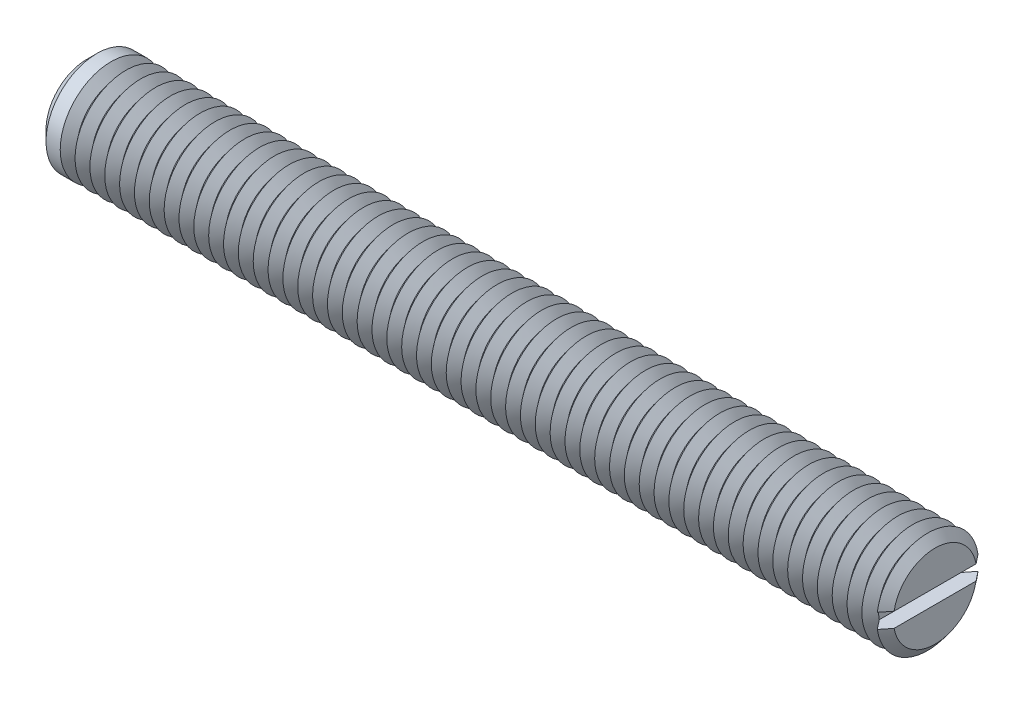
ISO-10303-21;
HEADER;
FILE_DESCRIPTION(('STEP AP214'),'2;1');
FILE_NAME('part.step','',(''),(''),'','','');
FILE_SCHEMA(('AUTOMOTIVE_DESIGN { 1 0 10303 214 1 1 1 1 }'));
ENDSEC;
DATA;
#1=APPLICATION_CONTEXT('core data for automotive mechanical design processes');
#2=APPLICATION_PROTOCOL_DEFINITION('international standard','automotive_design',2000,#1);
#3=PRODUCT_CONTEXT('',#1,'mechanical');
#4=PRODUCT('Part','Part','',(#3));
#5=PRODUCT_RELATED_PRODUCT_CATEGORY('part','',(#4));
#6=PRODUCT_DEFINITION_FORMATION('','',#4);
#7=PRODUCT_DEFINITION_CONTEXT('part definition',#1,'design');
#8=PRODUCT_DEFINITION('design','',#6,#7);
#9=PRODUCT_DEFINITION_SHAPE('','',#8);
#10=(LENGTH_UNIT() NAMED_UNIT(*) SI_UNIT(.MILLI.,.METRE.));
#11=(NAMED_UNIT(*) PLANE_ANGLE_UNIT() SI_UNIT($,.RADIAN.));
#12=(NAMED_UNIT(*) SI_UNIT($,.STERADIAN.) SOLID_ANGLE_UNIT());
#13=UNCERTAINTY_MEASURE_WITH_UNIT(LENGTH_MEASURE(1.E-05),#10,'distance_accuracy_value','');
#14=(GEOMETRIC_REPRESENTATION_CONTEXT(3) GLOBAL_UNCERTAINTY_ASSIGNED_CONTEXT((#13)) GLOBAL_UNIT_ASSIGNED_CONTEXT((#10,
#11,#12)) REPRESENTATION_CONTEXT('',''));
#15=CARTESIAN_POINT('',(0.,0.,0.));
#16=DIRECTION('',(0.,0.,1.));
#17=DIRECTION('',(1.,0.,0.));
#18=AXIS2_PLACEMENT_3D('',#15,#16,#17);
#19=CARTESIAN_POINT('',(49.125,0.,0.));
#20=DIRECTION('',(1.,0.,0.));
#21=DIRECTION('',(0.,0.,-1.));
#22=AXIS2_PLACEMENT_3D('',#19,#20,#21);
#23=CONICAL_SURFACE('',#22,6.,0.895664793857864);
#24=CARTESIAN_POINT('',(49.125,0.,0.));
#25=DIRECTION('',(-1.,0.,0.));
#26=DIRECTION('',(0.,0.,1.));
#27=AXIS2_PLACEMENT_3D('',#24,#25,#26);
#28=CIRCLE('',#27,6.);
#29=CARTESIAN_POINT('',(49.125,-0.874999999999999,-5.93585503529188));
#30=VERTEX_POINT('',#29);
#31=CARTESIAN_POINT('',(49.125,-0.874999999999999,5.93585503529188));
#32=VERTEX_POINT('',#31);
#33=EDGE_CURVE('E117',#30,#32,#28,.T.);
#34=ORIENTED_EDGE('',*,*,#33,.T.);
#35=CARTESIAN_POINT('',(54.815666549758,-0.874999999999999,-13.0784023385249));
#36=CARTESIAN_POINT('',(54.4425848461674,-0.874999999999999,-12.6113718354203));
#37=CARTESIAN_POINT('',(54.0695485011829,-0.874999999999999,-12.1443050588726));
#38=CARTESIAN_POINT('',(53.3235952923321,-0.874999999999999,-11.2100035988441));
#39=CARTESIAN_POINT('',(52.9506784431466,-0.874999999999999,-10.7427689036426));
#40=CARTESIAN_POINT('',(52.2043910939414,-0.874999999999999,-9.80728158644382));
#41=CARTESIAN_POINT('',(51.831020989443,-0.874999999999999,-9.3390286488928));
#42=CARTESIAN_POINT('',(51.084654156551,-0.874999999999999,-8.40229688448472));
#43=CARTESIAN_POINT('',(50.7116573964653,-0.874999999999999,-7.9338180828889));
#44=CARTESIAN_POINT('',(50.1431910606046,-0.874999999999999,-7.21894008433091));
#45=CARTESIAN_POINT('',(49.9475150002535,-0.874999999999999,-6.97270509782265));
#46=CARTESIAN_POINT('',(49.5563780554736,-0.874999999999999,-6.48006014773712));
#47=CARTESIAN_POINT('',(49.3609171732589,-0.874999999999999,-6.23365018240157));
#48=CARTESIAN_POINT('',(48.9702437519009,-0.874999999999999,-5.74051596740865));
#49=CARTESIAN_POINT('',(48.775031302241,-0.874999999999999,-5.49379164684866));
#50=CARTESIAN_POINT('',(48.3850627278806,-0.874999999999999,-4.99999724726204));
#51=CARTESIAN_POINT('',(48.1903065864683,-0.874999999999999,-4.75292718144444));
#52=CARTESIAN_POINT('',(47.8017454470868,-0.874999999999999,-4.25854698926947));
#53=CARTESIAN_POINT('',(47.6079395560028,-0.874999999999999,-4.01123756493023));
#54=CARTESIAN_POINT('',(47.2214614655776,-0.874999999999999,-3.51567639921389));
#55=CARTESIAN_POINT('',(47.0287894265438,-0.874999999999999,-3.26742453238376));
#56=CARTESIAN_POINT('',(46.7415141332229,-0.874999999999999,-2.8938270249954));
#57=CARTESIAN_POINT('',(46.6460716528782,-0.874999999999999,-2.7691272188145));
#58=CARTESIAN_POINT('',(46.4560120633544,-0.874999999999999,-2.51908954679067));
#59=CARTESIAN_POINT('',(46.3613949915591,-0.874999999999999,-2.39375165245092));
#60=CARTESIAN_POINT('',(46.1734585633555,-0.874999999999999,-2.14215479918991));
#61=CARTESIAN_POINT('',(46.0801388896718,-0.874999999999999,-2.01589607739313));
#62=CARTESIAN_POINT('',(45.8955738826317,-0.874999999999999,-1.7618740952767));
#63=CARTESIAN_POINT('',(45.8043283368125,-0.874999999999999,-1.63411099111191));
#64=CARTESIAN_POINT('',(45.6947335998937,-0.874999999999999,-1.47575777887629));
#65=CARTESIAN_POINT('',(45.6745750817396,-0.874999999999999,-1.44642115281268));
#66=CARTESIAN_POINT('',(45.6344943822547,-0.874999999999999,-1.38758643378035));
#67=CARTESIAN_POINT('',(45.6145722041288,-0.874999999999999,-1.35808833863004));
#68=CARTESIAN_POINT('',(45.5552118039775,-0.874999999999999,-1.26931303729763));
#69=CARTESIAN_POINT('',(45.5161833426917,-0.874999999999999,-1.20976002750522));
#70=CARTESIAN_POINT('',(45.439598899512,-0.874999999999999,-1.08955604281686));
#71=CARTESIAN_POINT('',(45.4020457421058,-0.874999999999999,-1.02890325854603));
#72=CARTESIAN_POINT('',(45.3292052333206,-0.874999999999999,-0.906252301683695));
#73=CARTESIAN_POINT('',(45.2939174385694,-0.874999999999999,-0.844254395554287));
#74=CARTESIAN_POINT('',(45.2387563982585,-0.874999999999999,-0.740802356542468));
#75=CARTESIAN_POINT('',(45.217869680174,-0.874999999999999,-0.699896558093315));
#76=CARTESIAN_POINT('',(45.1780353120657,-0.874999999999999,-0.617162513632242));
#77=CARTESIAN_POINT('',(45.1590880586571,-0.874999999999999,-0.575334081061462));
#78=CARTESIAN_POINT('',(45.106232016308,-0.874999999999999,-0.44842603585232));
#79=CARTESIAN_POINT('',(45.0761075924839,-0.874999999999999,-0.361569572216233));
#80=CARTESIAN_POINT('',(45.0472166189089,-0.874999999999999,-0.240214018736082));
#81=CARTESIAN_POINT('',(45.0406925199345,-0.874999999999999,-0.207555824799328));
#82=CARTESIAN_POINT('',(45.0303887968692,-0.874999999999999,-0.141816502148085));
#83=CARTESIAN_POINT('',(45.0266076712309,-0.874999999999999,-0.108735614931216));
#84=CARTESIAN_POINT('',(45.0220436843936,-0.874999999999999,-0.0424543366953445));
#85=CARTESIAN_POINT('',(45.0212526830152,-0.874999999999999,-0.00925451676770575));
#86=CARTESIAN_POINT('',(45.0227025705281,-0.874999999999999,0.057080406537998));
#87=CARTESIAN_POINT('',(45.0249438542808,-0.874999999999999,0.09021550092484));
#88=CARTESIAN_POINT('',(45.0331880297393,-0.874999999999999,0.164063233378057));
#89=CARTESIAN_POINT('',(45.0399634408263,-0.874999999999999,0.204689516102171));
#90=CARTESIAN_POINT('',(45.0573167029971,-0.874999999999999,0.285126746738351));
#91=CARTESIAN_POINT('',(45.0678973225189,-0.874999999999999,0.324937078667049));
#92=CARTESIAN_POINT('',(45.0921930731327,-0.874999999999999,0.403898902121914));
#93=CARTESIAN_POINT('',(45.1059311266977,-0.874999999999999,0.443043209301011));
#94=CARTESIAN_POINT('',(45.1357974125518,-0.874999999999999,0.520385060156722));
#95=CARTESIAN_POINT('',(45.151925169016,-0.874999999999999,0.55858279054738));
#96=CARTESIAN_POINT('',(45.2021457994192,-0.874999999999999,0.669991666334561));
#97=CARTESIAN_POINT('',(45.2387706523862,-0.874999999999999,0.742052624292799));
#98=CARTESIAN_POINT('',(45.316117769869,-0.874999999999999,0.88395692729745));
#99=CARTESIAN_POINT('',(45.3568440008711,-0.874999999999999,0.953798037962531));
#100=CARTESIAN_POINT('',(45.4409804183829,-0.874999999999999,1.09208391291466));
#101=CARTESIAN_POINT('',(45.4843973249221,-0.874999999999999,1.16052456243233));
#102=CARTESIAN_POINT('',(45.5729384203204,-0.874999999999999,1.29629435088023));
#103=CARTESIAN_POINT('',(45.618062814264,-0.874999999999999,1.36362335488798));
#104=CARTESIAN_POINT('',(45.7096565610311,-0.874999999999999,1.49772496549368));
#105=CARTESIAN_POINT('',(45.7561302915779,-0.874999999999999,1.56449457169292));
#106=CARTESIAN_POINT('',(45.8499281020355,-0.874999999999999,1.69744165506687));
#107=CARTESIAN_POINT('',(45.8972522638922,-0.874999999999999,1.76361907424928));
#108=CARTESIAN_POINT('',(45.9924358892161,-0.874999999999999,1.89539956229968));
#109=CARTESIAN_POINT('',(46.0402941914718,-0.874999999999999,1.96100347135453));
#110=CARTESIAN_POINT('',(46.136481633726,-0.874999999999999,2.09186112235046));
#111=CARTESIAN_POINT('',(46.1848107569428,-0.874999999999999,2.15711487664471));
#112=CARTESIAN_POINT('',(46.3290907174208,-0.874999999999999,2.35079303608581));
#113=CARTESIAN_POINT('',(46.425565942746,-0.874999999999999,2.47882657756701));
#114=CARTESIAN_POINT('',(46.6194152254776,-0.874999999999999,2.73421191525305));
#115=CARTESIAN_POINT('',(46.716789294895,-0.874999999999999,2.86156370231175));
#116=CARTESIAN_POINT('',(47.0098183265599,-0.874999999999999,3.24294102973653));
#117=CARTESIAN_POINT('',(47.2063709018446,-0.874999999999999,3.49627631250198));
#118=CARTESIAN_POINT('',(47.6008478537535,-0.874999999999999,4.00219025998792));
#119=CARTESIAN_POINT('',(47.7987731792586,-0.874999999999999,4.25476818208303));
#120=CARTESIAN_POINT('',(48.195350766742,-0.874999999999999,4.7593421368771));
#121=CARTESIAN_POINT('',(48.3940030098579,-0.874999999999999,5.01133818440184));
#122=CARTESIAN_POINT('',(48.7908446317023,-0.874999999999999,5.51379367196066));
#123=CARTESIAN_POINT('',(48.9890318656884,-0.874999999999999,5.76425480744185));
#124=CARTESIAN_POINT('',(49.385719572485,-0.874999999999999,6.26493161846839));
#125=CARTESIAN_POINT('',(49.5842200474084,-0.874999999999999,6.51514729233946));
#126=CARTESIAN_POINT('',(50.1799499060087,-0.874999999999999,7.26541710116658));
#127=CARTESIAN_POINT('',(50.5775028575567,-0.874999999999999,7.76521426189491));
#128=CARTESIAN_POINT('',(51.2943115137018,-0.874999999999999,8.66550309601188));
#129=CARTESIAN_POINT('',(51.6134832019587,-0.874999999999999,9.06606170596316));
#130=CARTESIAN_POINT('',(52.2520581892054,-0.874999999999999,9.86704239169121));
#131=CARTESIAN_POINT('',(52.5714615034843,-0.874999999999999,10.2674644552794));
#132=CARTESIAN_POINT('',(53.2116162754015,-0.874999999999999,11.0697025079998));
#133=CARTESIAN_POINT('',(53.5323682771,-0.874999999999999,11.4715180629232));
#134=CARTESIAN_POINT('',(54.1739570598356,-0.874999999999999,12.2750327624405));
#135=CARTESIAN_POINT('',(54.4947938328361,-0.874999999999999,12.676731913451));
#136=CARTESIAN_POINT('',(54.815666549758,-0.874999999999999,13.0784023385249));
#137=B_SPLINE_CURVE_WITH_KNOTS('',3,(#35,#36,#37,#38,#39,#40,#41,#42,#43,#44,#45,#46,#47,#48,
#49,#50,#51,#52,#53,#54,#55,#56,#57,#58,#59,#60,#61,#62,#63,#64,#65,#66,#67,#68,#69,#70,#71,#72,
#73,#74,#75,#76,#77,#78,#79,#80,#81,#82,#83,#84,#85,#86,#87,#88,#89,#90,#91,#92,#93,#94,#95,#96,
#97,#98,#99,#100,#101,#102,#103,#104,#105,#106,#107,#108,#109,#110,#111,#112,#113,#114,#115,
#116,#117,#118,#119,#120,#121,#122,#123,#124,#125,#126,#127,#128,#129,#130,#131,#132,#133,#134,
#135,#136),.UNSPECIFIED.,.F.,.F.,(4,2,2,2,2,2,2,2,2,2,2,2,2,2,2,2,2,2,2,2,2,2,2,2,2,2,2,2,2,2,2,
2,2,2,2,2,2,2,2,2,2,2,2,2,2,2,2,2,2,2,4),(0.,1.79325603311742,3.58668207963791,5.38334403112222,
7.17983772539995,8.12338791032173,9.06694771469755,10.0107838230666,10.9545848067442,
11.8971886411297,12.8399226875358,13.3110192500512,13.7821370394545,14.2531375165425,
14.72408952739,14.8308734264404,14.9376587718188,15.1512485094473,15.3652290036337,
15.5791674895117,15.7169026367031,15.8546658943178,16.1289739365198,16.2287885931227,
16.3285485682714,16.4280367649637,16.5275379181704,16.6508760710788,16.7743041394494,
16.8986582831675,17.0229876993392,17.2652294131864,17.5077076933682,17.7508180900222,
17.9939577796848,18.2380016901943,18.4820692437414,18.7256822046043,18.9692865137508,
19.450216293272,19.9311525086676,20.8930708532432,21.8557381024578,22.8183805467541,
23.7765455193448,24.7347169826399,26.650599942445,28.1871088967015,29.7237307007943,
31.2661438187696,32.8084427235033),.UNSPECIFIED.);
#138=CARTESIAN_POINT('',(48.25,-0.874999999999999,4.82848363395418));
#139=VERTEX_POINT('',#138);
#140=EDGE_CURVE('E109',#139,#32,#137,.T.);
#141=ORIENTED_EDGE('',*,*,#140,.F.);
#142=CARTESIAN_POINT('',(48.25,0.,0.));
#143=DIRECTION('',(-1.,0.,0.));
#144=DIRECTION('',(0.,0.,1.));
#145=AXIS2_PLACEMENT_3D('',#142,#143,#144);
#146=CIRCLE('',#145,4.90712535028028);
#147=CARTESIAN_POINT('',(48.25,-0.874999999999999,-4.82848363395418));
#148=VERTEX_POINT('',#147);
#149=EDGE_CURVE('E664',#148,#139,#146,.T.);
#150=ORIENTED_EDGE('',*,*,#149,.F.);
#151=EDGE_CURVE('E58',#30,#148,#137,.T.);
#152=ORIENTED_EDGE('',*,*,#151,.F.);
#153=EDGE_LOOP('',(#34,#141,#150,#152));
#154=FACE_BOUND('',#153,.T.);
#155=ADVANCED_FACE('F37',(#154),#23,.T.);
#156=CARTESIAN_POINT('',(49.125,0.874999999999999,5.93585503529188));
#157=VERTEX_POINT('',#156);
#158=CARTESIAN_POINT('',(49.125,0.874999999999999,-5.93585503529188));
#159=VERTEX_POINT('',#158);
#160=EDGE_CURVE('E100',#157,#159,#28,.T.);
#161=ORIENTED_EDGE('',*,*,#160,.T.);
#162=CARTESIAN_POINT('',(54.815666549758,0.874999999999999,13.0784023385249));
#163=CARTESIAN_POINT('',(54.4425848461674,0.874999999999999,12.6113718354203));
#164=CARTESIAN_POINT('',(54.0695485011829,0.874999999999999,12.1443050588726));
#165=CARTESIAN_POINT('',(53.3235952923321,0.874999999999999,11.2100035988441));
#166=CARTESIAN_POINT('',(52.9506784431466,0.874999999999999,10.7427689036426));
#167=CARTESIAN_POINT('',(52.2043910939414,0.874999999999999,9.80728158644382));
#168=CARTESIAN_POINT('',(51.831020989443,0.874999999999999,9.3390286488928));
#169=CARTESIAN_POINT('',(51.084654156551,0.874999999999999,8.40229688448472));
#170=CARTESIAN_POINT('',(50.7116573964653,0.874999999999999,7.9338180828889));
#171=CARTESIAN_POINT('',(50.1431910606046,0.874999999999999,7.21894008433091));
#172=CARTESIAN_POINT('',(49.9475150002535,0.874999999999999,6.97270509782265));
#173=CARTESIAN_POINT('',(49.5563780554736,0.874999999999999,6.48006014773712));
#174=CARTESIAN_POINT('',(49.3609171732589,0.874999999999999,6.23365018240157));
#175=CARTESIAN_POINT('',(48.9702437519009,0.874999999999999,5.74051596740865));
#176=CARTESIAN_POINT('',(48.775031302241,0.874999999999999,5.49379164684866));
#177=CARTESIAN_POINT('',(48.3850627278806,0.874999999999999,4.99999724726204));
#178=CARTESIAN_POINT('',(48.1903065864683,0.874999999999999,4.75292718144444));
#179=CARTESIAN_POINT('',(47.8017454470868,0.874999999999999,4.25854698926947));
#180=CARTESIAN_POINT('',(47.6079395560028,0.874999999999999,4.01123756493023));
#181=CARTESIAN_POINT('',(47.2214614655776,0.874999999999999,3.51567639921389));
#182=CARTESIAN_POINT('',(47.0287894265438,0.874999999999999,3.26742453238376));
#183=CARTESIAN_POINT('',(46.7415141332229,0.874999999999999,2.8938270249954));
#184=CARTESIAN_POINT('',(46.6460716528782,0.874999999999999,2.7691272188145));
#185=CARTESIAN_POINT('',(46.4560120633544,0.874999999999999,2.51908954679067));
#186=CARTESIAN_POINT('',(46.3613949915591,0.874999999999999,2.39375165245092));
#187=CARTESIAN_POINT('',(46.1734585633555,0.874999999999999,2.14215479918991));
#188=CARTESIAN_POINT('',(46.0801388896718,0.874999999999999,2.01589607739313));
#189=CARTESIAN_POINT('',(45.8955738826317,0.874999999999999,1.7618740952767));
#190=CARTESIAN_POINT('',(45.8043283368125,0.874999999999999,1.63411099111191));
#191=CARTESIAN_POINT('',(45.6947335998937,0.874999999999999,1.47575777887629));
#192=CARTESIAN_POINT('',(45.6745750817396,0.874999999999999,1.44642115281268));
#193=CARTESIAN_POINT('',(45.6344943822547,0.874999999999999,1.38758643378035));
#194=CARTESIAN_POINT('',(45.6145722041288,0.874999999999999,1.35808833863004));
#195=CARTESIAN_POINT('',(45.5552118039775,0.874999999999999,1.26931303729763));
#196=CARTESIAN_POINT('',(45.5161833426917,0.874999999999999,1.20976002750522));
#197=CARTESIAN_POINT('',(45.439598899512,0.874999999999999,1.08955604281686));
#198=CARTESIAN_POINT('',(45.4020457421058,0.874999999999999,1.02890325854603));
#199=CARTESIAN_POINT('',(45.3292052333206,0.874999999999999,0.906252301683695));
#200=CARTESIAN_POINT('',(45.2939174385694,0.874999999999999,0.844254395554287));
#201=CARTESIAN_POINT('',(45.2387563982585,0.874999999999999,0.740802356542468));
#202=CARTESIAN_POINT('',(45.217869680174,0.874999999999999,0.699896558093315));
#203=CARTESIAN_POINT('',(45.1780353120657,0.874999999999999,0.617162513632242));
#204=CARTESIAN_POINT('',(45.1590880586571,0.874999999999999,0.575334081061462));
#205=CARTESIAN_POINT('',(45.106232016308,0.874999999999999,0.44842603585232));
#206=CARTESIAN_POINT('',(45.0761075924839,0.874999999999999,0.361569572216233));
#207=CARTESIAN_POINT('',(45.0472166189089,0.874999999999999,0.240214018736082));
#208=CARTESIAN_POINT('',(45.0406925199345,0.874999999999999,0.207555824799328));
#209=CARTESIAN_POINT('',(45.0303887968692,0.874999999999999,0.141816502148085));
#210=CARTESIAN_POINT('',(45.0266076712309,0.874999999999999,0.108735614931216));
#211=CARTESIAN_POINT('',(45.0220436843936,0.874999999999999,0.0424543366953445));
#212=CARTESIAN_POINT('',(45.0212526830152,0.874999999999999,0.00925451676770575));
#213=CARTESIAN_POINT('',(45.0227025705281,0.874999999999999,-0.057080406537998));
#214=CARTESIAN_POINT('',(45.0249438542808,0.874999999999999,-0.09021550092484));
#215=CARTESIAN_POINT('',(45.0331880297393,0.874999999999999,-0.164063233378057));
#216=CARTESIAN_POINT('',(45.0399634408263,0.874999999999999,-0.204689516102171));
#217=CARTESIAN_POINT('',(45.0573167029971,0.874999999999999,-0.285126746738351));
#218=CARTESIAN_POINT('',(45.0678973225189,0.874999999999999,-0.324937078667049));
#219=CARTESIAN_POINT('',(45.0921930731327,0.874999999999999,-0.403898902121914));
#220=CARTESIAN_POINT('',(45.1059311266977,0.874999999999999,-0.443043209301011));
#221=CARTESIAN_POINT('',(45.1357974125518,0.874999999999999,-0.520385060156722));
#222=CARTESIAN_POINT('',(45.151925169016,0.874999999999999,-0.55858279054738));
#223=CARTESIAN_POINT('',(45.2021457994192,0.874999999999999,-0.669991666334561));
#224=CARTESIAN_POINT('',(45.2387706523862,0.874999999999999,-0.742052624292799));
#225=CARTESIAN_POINT('',(45.316117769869,0.874999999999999,-0.88395692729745));
#226=CARTESIAN_POINT('',(45.3568440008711,0.874999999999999,-0.953798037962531));
#227=CARTESIAN_POINT('',(45.4409804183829,0.874999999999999,-1.09208391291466));
#228=CARTESIAN_POINT('',(45.4843973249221,0.874999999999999,-1.16052456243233));
#229=CARTESIAN_POINT('',(45.5729384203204,0.874999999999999,-1.29629435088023));
#230=CARTESIAN_POINT('',(45.618062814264,0.874999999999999,-1.36362335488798));
#231=CARTESIAN_POINT('',(45.7096565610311,0.874999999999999,-1.49772496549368));
#232=CARTESIAN_POINT('',(45.7561302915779,0.874999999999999,-1.56449457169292));
#233=CARTESIAN_POINT('',(45.8499281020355,0.874999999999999,-1.69744165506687));
#234=CARTESIAN_POINT('',(45.8972522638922,0.874999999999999,-1.76361907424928));
#235=CARTESIAN_POINT('',(45.9924358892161,0.874999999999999,-1.89539956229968));
#236=CARTESIAN_POINT('',(46.0402941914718,0.874999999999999,-1.96100347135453));
#237=CARTESIAN_POINT('',(46.136481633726,0.874999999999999,-2.09186112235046));
#238=CARTESIAN_POINT('',(46.1848107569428,0.874999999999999,-2.15711487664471));
#239=CARTESIAN_POINT('',(46.3290907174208,0.874999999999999,-2.35079303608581));
#240=CARTESIAN_POINT('',(46.425565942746,0.874999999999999,-2.47882657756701));
#241=CARTESIAN_POINT('',(46.6194152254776,0.874999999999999,-2.73421191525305));
#242=CARTESIAN_POINT('',(46.716789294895,0.874999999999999,-2.86156370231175));
#243=CARTESIAN_POINT('',(47.0098183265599,0.874999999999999,-3.24294102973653));
#244=CARTESIAN_POINT('',(47.2063709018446,0.874999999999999,-3.49627631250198));
#245=CARTESIAN_POINT('',(47.6008478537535,0.874999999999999,-4.00219025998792));
#246=CARTESIAN_POINT('',(47.7987731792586,0.874999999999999,-4.25476818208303));
#247=CARTESIAN_POINT('',(48.195350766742,0.874999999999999,-4.7593421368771));
#248=CARTESIAN_POINT('',(48.3940030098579,0.874999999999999,-5.01133818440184));
#249=CARTESIAN_POINT('',(48.7908446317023,0.874999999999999,-5.51379367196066));
#250=CARTESIAN_POINT('',(48.9890318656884,0.874999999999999,-5.76425480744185));
#251=CARTESIAN_POINT('',(49.385719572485,0.874999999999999,-6.26493161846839));
#252=CARTESIAN_POINT('',(49.5842200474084,0.874999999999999,-6.51514729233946));
#253=CARTESIAN_POINT('',(50.1799499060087,0.874999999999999,-7.26541710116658));
#254=CARTESIAN_POINT('',(50.5775028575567,0.874999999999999,-7.76521426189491));
#255=CARTESIAN_POINT('',(51.2943115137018,0.874999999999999,-8.66550309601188));
#256=CARTESIAN_POINT('',(51.6134832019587,0.874999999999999,-9.06606170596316));
#257=CARTESIAN_POINT('',(52.2520581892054,0.874999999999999,-9.86704239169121));
#258=CARTESIAN_POINT('',(52.5714615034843,0.874999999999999,-10.2674644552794));
#259=CARTESIAN_POINT('',(53.2116162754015,0.874999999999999,-11.0697025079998));
#260=CARTESIAN_POINT('',(53.5323682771,0.874999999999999,-11.4715180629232));
#261=CARTESIAN_POINT('',(54.1739570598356,0.874999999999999,-12.2750327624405));
#262=CARTESIAN_POINT('',(54.4947938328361,0.874999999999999,-12.676731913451));
#263=CARTESIAN_POINT('',(54.815666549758,0.874999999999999,-13.0784023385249));
#264=B_SPLINE_CURVE_WITH_KNOTS('',3,(#162,#163,#164,#165,#166,#167,#168,#169,#170,#171,#172,
#173,#174,#175,#176,#177,#178,#179,#180,#181,#182,#183,#184,#185,#186,#187,#188,#189,#190,#191,
#192,#193,#194,#195,#196,#197,#198,#199,#200,#201,#202,#203,#204,#205,#206,#207,#208,#209,#210,
#211,#212,#213,#214,#215,#216,#217,#218,#219,#220,#221,#222,#223,#224,#225,#226,#227,#228,#229,
#230,#231,#232,#233,#234,#235,#236,#237,#238,#239,#240,#241,#242,#243,#244,#245,#246,#247,#248,
#249,#250,#251,#252,#253,#254,#255,#256,#257,#258,#259,#260,#261,#262,#263),.UNSPECIFIED.,.F.,
.F.,(4,2,2,2,2,2,2,2,2,2,2,2,2,2,2,2,2,2,2,2,2,2,2,2,2,2,2,2,2,2,2,2,2,2,2,2,2,2,2,2,2,2,2,2,2,
2,2,2,2,2,4),(0.,1.79325603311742,3.58668207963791,5.38334403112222,7.17983772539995,
8.12338791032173,9.06694771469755,10.0107838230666,10.9545848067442,11.8971886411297,
12.8399226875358,13.3110192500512,13.7821370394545,14.2531375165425,14.72408952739,
14.8308734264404,14.9376587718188,15.1512485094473,15.3652290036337,15.5791674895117,
15.7169026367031,15.8546658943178,16.1289739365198,16.2287885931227,16.3285485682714,
16.4280367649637,16.5275379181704,16.6508760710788,16.7743041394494,16.8986582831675,
17.0229876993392,17.2652294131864,17.5077076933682,17.7508180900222,17.9939577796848,
18.2380016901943,18.4820692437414,18.7256822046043,18.9692865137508,19.450216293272,
19.9311525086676,20.8930708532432,21.8557381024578,22.8183805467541,23.7765455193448,
24.7347169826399,26.650599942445,28.1871088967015,29.7237307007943,31.2661438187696,
32.8084427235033),.UNSPECIFIED.);
#265=CARTESIAN_POINT('',(48.25,0.874999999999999,-4.82848363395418));
#266=VERTEX_POINT('',#265);
#267=EDGE_CURVE('E110',#266,#159,#264,.T.);
#268=ORIENTED_EDGE('',*,*,#267,.F.);
#269=CARTESIAN_POINT('',(48.25,0.874999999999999,4.82848363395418));
#270=VERTEX_POINT('',#269);
#271=EDGE_CURVE('E103',#270,#266,#146,.T.);
#272=ORIENTED_EDGE('',*,*,#271,.F.);
#273=EDGE_CURVE('E97',#157,#270,#264,.T.);
#274=ORIENTED_EDGE('',*,*,#273,.F.);
#275=EDGE_LOOP('',(#161,#268,#272,#274));
#276=FACE_BOUND('',#275,.T.);
#277=ADVANCED_FACE('F99',(#276),#23,.T.);
#278=CARTESIAN_POINT('',(48.25,0.,0.));
#279=DIRECTION('',(-1.,0.,0.));
#280=DIRECTION('',(0.,0.,1.));
#281=AXIS2_PLACEMENT_3D('',#278,#279,#280);
#282=CONICAL_SURFACE('',#281,4.90712535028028,0.895664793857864);
#283=CARTESIAN_POINT('',(47.375,0.,0.));
#284=DIRECTION('',(-1.,0.,0.));
#285=DIRECTION('',(0.,0.,1.));
#286=AXIS2_PLACEMENT_3D('',#283,#284,#285);
#287=CIRCLE('',#286,6.);
#288=CARTESIAN_POINT('',(47.375,0.,6.));
#289=VERTEX_POINT('',#288);
#290=EDGE_CURVE('E649',#289,#289,#287,.T.);
#291=ORIENTED_EDGE('',*,*,#290,.F.);
#292=EDGE_LOOP('',(#291));
#293=FACE_BOUND('',#292,.T.);
#294=ORIENTED_EDGE('',*,*,#271,.T.);
#295=EDGE_CURVE('E658',#266,#148,#146,.T.);
#296=ORIENTED_EDGE('',*,*,#295,.T.);
#297=ORIENTED_EDGE('',*,*,#149,.T.);
#298=EDGE_CURVE('E656',#139,#270,#146,.T.);
#299=ORIENTED_EDGE('',*,*,#298,.T.);
#300=EDGE_LOOP('',(#294,#296,#297,#299));
#301=FACE_BOUND('',#300,.T.);
#302=ADVANCED_FACE('F167',(#293,#301),#282,.T.);
#303=CARTESIAN_POINT('',(50.,0.,0.));
#304=DIRECTION('',(1.,0.,0.));
#305=DIRECTION('',(0.,0.,-1.));
#306=AXIS2_PLACEMENT_3D('',#303,#304,#305);
#307=PLANE('',#306);
#308=CARTESIAN_POINT('',(50.,0.,0.));
#309=DIRECTION('',(-1.,0.,0.));
#310=DIRECTION('',(0.,0.,1.));
#311=AXIS2_PLACEMENT_3D('',#308,#309,#310);
#312=CIRCLE('',#311,4.90712535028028);
#313=CARTESIAN_POINT('',(50.,0.874999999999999,4.82848363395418));
#314=VERTEX_POINT('',#313);
#315=CARTESIAN_POINT('',(50.,0.874999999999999,-4.82848363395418));
#316=VERTEX_POINT('',#315);
#317=EDGE_CURVE('E159',#314,#316,#312,.T.);
#318=ORIENTED_EDGE('',*,*,#317,.F.);
#319=DIRECTION('',(0.,0.,1.));
#320=VECTOR('',#319,1.);
#321=CARTESIAN_POINT('',(50.,0.874999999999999,0.));
#322=LINE('',#321,#320);
#323=EDGE_CURVE('E122',#316,#314,#322,.T.);
#324=ORIENTED_EDGE('',*,*,#323,.F.);
#325=EDGE_LOOP('',(#318,#324));
#326=FACE_BOUND('',#325,.T.);
#327=ADVANCED_FACE('F171',(#326),#307,.T.);
#328=CARTESIAN_POINT('',(50.,-0.874999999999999,-4.82848363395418));
#329=VERTEX_POINT('',#328);
#330=CARTESIAN_POINT('',(50.,-0.874999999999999,4.82848363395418));
#331=VERTEX_POINT('',#330);
#332=EDGE_CURVE('E66',#329,#331,#312,.T.);
#333=ORIENTED_EDGE('',*,*,#332,.F.);
#334=DIRECTION('',(0.,0.,-1.));
#335=VECTOR('',#334,1.);
#336=CARTESIAN_POINT('',(50.,-0.874999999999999,0.));
#337=LINE('',#336,#335);
#338=EDGE_CURVE('E135',#331,#329,#337,.T.);
#339=ORIENTED_EDGE('',*,*,#338,.F.);
#340=EDGE_LOOP('',(#333,#339));
#341=FACE_BOUND('',#340,.T.);
#342=ADVANCED_FACE('F199',(#341),#307,.T.);
#343=CARTESIAN_POINT('',(50.,0.,0.));
#344=DIRECTION('',(-1.,0.,0.));
#345=DIRECTION('',(0.,0.,1.));
#346=AXIS2_PLACEMENT_3D('',#343,#344,#345);
#347=CONICAL_SURFACE('',#346,4.90712535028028,0.895664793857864);
#348=ORIENTED_EDGE('',*,*,#160,.F.);
#349=CARTESIAN_POINT('',(43.434333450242,0.874999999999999,-13.0784023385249));
#350=CARTESIAN_POINT('',(43.8074151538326,0.874999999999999,-12.6113718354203));
#351=CARTESIAN_POINT('',(44.1804514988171,0.874999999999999,-12.1443050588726));
#352=CARTESIAN_POINT('',(44.9264047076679,0.874999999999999,-11.2100035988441));
#353=CARTESIAN_POINT('',(45.2993215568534,0.874999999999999,-10.7427689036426));
#354=CARTESIAN_POINT('',(46.0456089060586,0.874999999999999,-9.8072815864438));
#355=CARTESIAN_POINT('',(46.418979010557,0.874999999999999,-9.33902864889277));
#356=CARTESIAN_POINT('',(47.165345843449,0.874999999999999,-8.40229688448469));
#357=CARTESIAN_POINT('',(47.5383426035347,0.874999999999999,-7.93381808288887));
#358=CARTESIAN_POINT('',(48.1068089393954,0.874999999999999,-7.21894008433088));
#359=CARTESIAN_POINT('',(48.3024849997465,0.874999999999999,-6.97270509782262));
#360=CARTESIAN_POINT('',(48.6936219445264,0.874999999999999,-6.4800601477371));
#361=CARTESIAN_POINT('',(48.8890828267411,0.874999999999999,-6.23365018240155));
#362=CARTESIAN_POINT('',(49.2797562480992,0.874999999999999,-5.74051596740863));
#363=CARTESIAN_POINT('',(49.474968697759,0.874999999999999,-5.49379164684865));
#364=CARTESIAN_POINT('',(49.8649372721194,0.874999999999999,-4.99999724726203));
#365=CARTESIAN_POINT('',(50.0596934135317,0.874999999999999,-4.75292718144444));
#366=CARTESIAN_POINT('',(50.4482545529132,0.874999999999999,-4.25854698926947));
#367=CARTESIAN_POINT('',(50.6420604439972,0.874999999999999,-4.01123756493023));
#368=CARTESIAN_POINT('',(51.0285385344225,0.874999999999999,-3.51567639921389));
#369=CARTESIAN_POINT('',(51.2212105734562,0.874999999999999,-3.26742453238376));
#370=CARTESIAN_POINT('',(51.5084858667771,0.874999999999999,-2.8938270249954));
#371=CARTESIAN_POINT('',(51.6039283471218,0.874999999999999,-2.7691272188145));
#372=CARTESIAN_POINT('',(51.7939879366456,0.874999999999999,-2.51908954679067));
#373=CARTESIAN_POINT('',(51.8886050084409,0.874999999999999,-2.39375165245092));
#374=CARTESIAN_POINT('',(52.0765414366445,0.874999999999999,-2.14215479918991));
#375=CARTESIAN_POINT('',(52.1698611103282,0.874999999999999,-2.01589607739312));
#376=CARTESIAN_POINT('',(52.3544261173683,0.874999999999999,-1.7618740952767));
#377=CARTESIAN_POINT('',(52.4456716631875,0.874999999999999,-1.63411099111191));
#378=CARTESIAN_POINT('',(52.5552664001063,0.874999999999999,-1.47575777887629));
#379=CARTESIAN_POINT('',(52.5754249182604,0.874999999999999,-1.44642115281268));
#380=CARTESIAN_POINT('',(52.6155056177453,0.874999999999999,-1.38758643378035));
#381=CARTESIAN_POINT('',(52.6354277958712,0.874999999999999,-1.35808833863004));
#382=CARTESIAN_POINT('',(52.6947881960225,0.874999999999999,-1.26931303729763));
#383=CARTESIAN_POINT('',(52.7338166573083,0.874999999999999,-1.20976002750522));
#384=CARTESIAN_POINT('',(52.810401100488,0.874999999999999,-1.08955604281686));
#385=CARTESIAN_POINT('',(52.8479542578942,0.874999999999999,-1.02890325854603));
#386=CARTESIAN_POINT('',(52.9207947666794,0.874999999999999,-0.9062523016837));
#387=CARTESIAN_POINT('',(52.9560825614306,0.874999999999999,-0.844254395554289));
#388=CARTESIAN_POINT('',(53.0112436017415,0.874999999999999,-0.740802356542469));
#389=CARTESIAN_POINT('',(53.032130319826,0.874999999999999,-0.699896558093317));
#390=CARTESIAN_POINT('',(53.0719646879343,0.874999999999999,-0.617162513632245));
#391=CARTESIAN_POINT('',(53.0909119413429,0.874999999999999,-0.575334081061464));
#392=CARTESIAN_POINT('',(53.143767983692,0.874999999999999,-0.448426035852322));
#393=CARTESIAN_POINT('',(53.1738924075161,0.874999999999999,-0.361569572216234));
#394=CARTESIAN_POINT('',(53.2027833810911,0.874999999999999,-0.240214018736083));
#395=CARTESIAN_POINT('',(53.2093074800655,0.874999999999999,-0.207555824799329));
#396=CARTESIAN_POINT('',(53.2196112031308,0.874999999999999,-0.141816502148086));
#397=CARTESIAN_POINT('',(53.2233923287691,0.874999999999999,-0.108735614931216));
#398=CARTESIAN_POINT('',(53.2279563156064,0.874999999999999,-0.0424543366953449));
#399=CARTESIAN_POINT('',(53.2287473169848,0.874999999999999,-0.00925451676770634));
#400=CARTESIAN_POINT('',(53.227297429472,0.874999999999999,0.0570804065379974));
#401=CARTESIAN_POINT('',(53.2250561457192,0.874999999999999,0.0902155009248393));
#402=CARTESIAN_POINT('',(53.2168119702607,0.874999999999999,0.164063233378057));
#403=CARTESIAN_POINT('',(53.2100365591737,0.874999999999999,0.204689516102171));
#404=CARTESIAN_POINT('',(53.1926832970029,0.874999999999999,0.28512674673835));
#405=CARTESIAN_POINT('',(53.1821026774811,0.874999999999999,0.324937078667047));
#406=CARTESIAN_POINT('',(53.1578069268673,0.874999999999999,0.403898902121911));
#407=CARTESIAN_POINT('',(53.1440688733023,0.874999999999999,0.443043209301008));
#408=CARTESIAN_POINT('',(53.1142025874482,0.874999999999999,0.520385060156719));
#409=CARTESIAN_POINT('',(53.098074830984,0.874999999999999,0.558582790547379));
#410=CARTESIAN_POINT('',(53.0478542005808,0.874999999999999,0.669991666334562));
#411=CARTESIAN_POINT('',(53.0112293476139,0.874999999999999,0.742052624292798));
#412=CARTESIAN_POINT('',(52.933882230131,0.874999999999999,0.883956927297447));
#413=CARTESIAN_POINT('',(52.8931559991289,0.874999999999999,0.953798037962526));
#414=CARTESIAN_POINT('',(52.8090195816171,0.874999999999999,1.09208391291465));
#415=CARTESIAN_POINT('',(52.7656026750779,0.874999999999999,1.16052456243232));
#416=CARTESIAN_POINT('',(52.6770615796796,0.874999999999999,1.29629435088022));
#417=CARTESIAN_POINT('',(52.631937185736,0.874999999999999,1.36362335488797));
#418=CARTESIAN_POINT('',(52.540343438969,0.874999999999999,1.49772496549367));
#419=CARTESIAN_POINT('',(52.4938697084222,0.874999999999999,1.56449457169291));
#420=CARTESIAN_POINT('',(52.4000718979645,0.874999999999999,1.69744165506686));
#421=CARTESIAN_POINT('',(52.3527477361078,0.874999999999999,1.76361907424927));
#422=CARTESIAN_POINT('',(52.2575641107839,0.874999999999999,1.89539956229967));
#423=CARTESIAN_POINT('',(52.2097058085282,0.874999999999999,1.96100347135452));
#424=CARTESIAN_POINT('',(52.113518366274,0.874999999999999,2.09186112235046));
#425=CARTESIAN_POINT('',(52.0651892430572,0.874999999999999,2.1571148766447));
#426=CARTESIAN_POINT('',(51.9209092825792,0.874999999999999,2.3507930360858));
#427=CARTESIAN_POINT('',(51.824434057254,0.874999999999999,2.478826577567));
#428=CARTESIAN_POINT('',(51.6305847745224,0.874999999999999,2.73421191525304));
#429=CARTESIAN_POINT('',(51.533210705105,0.874999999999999,2.86156370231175));
#430=CARTESIAN_POINT('',(51.2401816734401,0.874999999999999,3.24294102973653));
#431=CARTESIAN_POINT('',(51.0436290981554,0.874999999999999,3.49627631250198));
#432=CARTESIAN_POINT('',(50.6491521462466,0.874999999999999,4.00219025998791));
#433=CARTESIAN_POINT('',(50.4512268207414,0.874999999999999,4.25476818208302));
#434=CARTESIAN_POINT('',(50.054649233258,0.874999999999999,4.7593421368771));
#435=CARTESIAN_POINT('',(49.8559969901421,0.874999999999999,5.01133818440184));
#436=CARTESIAN_POINT('',(49.4591553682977,0.874999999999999,5.51379367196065));
#437=CARTESIAN_POINT('',(49.2609681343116,0.874999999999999,5.76425480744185));
#438=CARTESIAN_POINT('',(48.864280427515,0.874999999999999,6.26493161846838));
#439=CARTESIAN_POINT('',(48.6657799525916,0.874999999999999,6.51514729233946));
#440=CARTESIAN_POINT('',(48.0700500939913,0.874999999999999,7.26541710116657));
#441=CARTESIAN_POINT('',(47.6724971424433,0.874999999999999,7.7652142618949));
#442=CARTESIAN_POINT('',(46.9556884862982,0.874999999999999,8.66550309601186));
#443=CARTESIAN_POINT('',(46.6365167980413,0.874999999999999,9.06606170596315));
#444=CARTESIAN_POINT('',(45.9979418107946,0.874999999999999,9.8670423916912));
#445=CARTESIAN_POINT('',(45.6785384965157,0.874999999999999,10.2674644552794));
#446=CARTESIAN_POINT('',(45.0383837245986,0.874999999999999,11.0697025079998));
#447=CARTESIAN_POINT('',(44.7176317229,0.874999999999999,11.4715180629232));
#448=CARTESIAN_POINT('',(44.0760429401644,0.874999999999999,12.2750327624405));
#449=CARTESIAN_POINT('',(43.7552061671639,0.874999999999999,12.676731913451));
#450=CARTESIAN_POINT('',(43.434333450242,0.874999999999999,13.0784023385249));
#451=B_SPLINE_CURVE_WITH_KNOTS('',3,(#349,#350,#351,#352,#353,#354,#355,#356,#357,#358,#359,
#360,#361,#362,#363,#364,#365,#366,#367,#368,#369,#370,#371,#372,#373,#374,#375,#376,#377,#378,
#379,#380,#381,#382,#383,#384,#385,#386,#387,#388,#389,#390,#391,#392,#393,#394,#395,#396,#397,
#398,#399,#400,#401,#402,#403,#404,#405,#406,#407,#408,#409,#410,#411,#412,#413,#414,#415,#416,
#417,#418,#419,#420,#421,#422,#423,#424,#425,#426,#427,#428,#429,#430,#431,#432,#433,#434,#435,
#436,#437,#438,#439,#440,#441,#442,#443,#444,#445,#446,#447,#448,#449,#450),.UNSPECIFIED.,.F.,
.F.,(4,2,2,2,2,2,2,2,2,2,2,2,2,2,2,2,2,2,2,2,2,2,2,2,2,2,2,2,2,2,2,2,2,2,2,2,2,2,2,2,2,2,2,2,2,
2,2,2,2,2,4),(0.,1.79325603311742,3.58668207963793,5.38334403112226,7.1798377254,
8.12338791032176,9.06694771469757,10.0107838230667,10.9545848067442,11.8971886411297,
12.8399226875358,13.3110192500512,13.7821370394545,14.2531375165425,14.72408952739,
14.8308734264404,14.9376587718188,15.1512485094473,15.3652290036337,15.5791674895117,
15.7169026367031,15.8546658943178,16.1289739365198,16.2287885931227,16.3285485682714,
16.4280367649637,16.5275379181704,16.6508760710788,16.7743041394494,16.8986582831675,
17.0229876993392,17.2652294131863,17.5077076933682,17.7508180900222,17.9939577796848,
18.2380016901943,18.4820692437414,18.7256822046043,18.9692865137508,19.450216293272,
19.9311525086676,20.8930708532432,21.8557381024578,22.8183805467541,23.7765455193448,
24.7347169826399,26.650599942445,28.1871088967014,29.7237307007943,31.2661438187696,
32.8084427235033),.UNSPECIFIED.);
#452=EDGE_CURVE('E41',#314,#157,#451,.T.);
#453=ORIENTED_EDGE('',*,*,#452,.F.);
#454=ORIENTED_EDGE('',*,*,#317,.T.);
#455=EDGE_CURVE('E11',#159,#316,#451,.T.);
#456=ORIENTED_EDGE('',*,*,#455,.F.);
#457=EDGE_LOOP('',(#348,#453,#454,#456));
#458=FACE_BOUND('',#457,.T.);
#459=ADVANCED_FACE('F114',(#458),#347,.T.);
#460=CARTESIAN_POINT('',(50.,0.874999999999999,-9.));
#461=DIRECTION('',(0.,1.,0.));
#462=DIRECTION('',(0.,0.,1.));
#463=AXIS2_PLACEMENT_3D('',#460,#461,#462);
#464=PLANE('',#463);
#465=ORIENTED_EDGE('',*,*,#452,.T.);
#466=ORIENTED_EDGE('',*,*,#273,.T.);
#467=DIRECTION('',(0.,0.,1.));
#468=VECTOR('',#467,1.);
#469=CARTESIAN_POINT('',(48.25,0.874999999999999,-9.));
#470=LINE('',#469,#468);
#471=EDGE_CURVE('E144',#266,#270,#470,.T.);
#472=ORIENTED_EDGE('',*,*,#471,.F.);
#473=ORIENTED_EDGE('',*,*,#267,.T.);
#474=ORIENTED_EDGE('',*,*,#455,.T.);
#475=ORIENTED_EDGE('',*,*,#323,.T.);
#476=EDGE_LOOP('',(#465,#466,#472,#473,#474,#475));
#477=FACE_BOUND('',#476,.T.);
#478=ADVANCED_FACE('F120',(#477),#464,.F.);
#479=ORIENTED_EDGE('',*,*,#33,.F.);
#480=CARTESIAN_POINT('',(43.434333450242,-0.874999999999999,13.0784023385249));
#481=CARTESIAN_POINT('',(43.8074151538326,-0.874999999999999,12.6113718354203));
#482=CARTESIAN_POINT('',(44.1804514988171,-0.874999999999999,12.1443050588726));
#483=CARTESIAN_POINT('',(44.9264047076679,-0.874999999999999,11.2100035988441));
#484=CARTESIAN_POINT('',(45.2993215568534,-0.874999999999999,10.7427689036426));
#485=CARTESIAN_POINT('',(46.0456089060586,-0.874999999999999,9.8072815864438));
#486=CARTESIAN_POINT('',(46.418979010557,-0.874999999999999,9.33902864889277));
#487=CARTESIAN_POINT('',(47.165345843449,-0.874999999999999,8.40229688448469));
#488=CARTESIAN_POINT('',(47.5383426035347,-0.874999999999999,7.93381808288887));
#489=CARTESIAN_POINT('',(48.1068089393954,-0.874999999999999,7.21894008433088));
#490=CARTESIAN_POINT('',(48.3024849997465,-0.874999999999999,6.97270509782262));
#491=CARTESIAN_POINT('',(48.6936219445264,-0.874999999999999,6.4800601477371));
#492=CARTESIAN_POINT('',(48.8890828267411,-0.874999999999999,6.23365018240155));
#493=CARTESIAN_POINT('',(49.2797562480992,-0.874999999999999,5.74051596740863));
#494=CARTESIAN_POINT('',(49.474968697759,-0.874999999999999,5.49379164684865));
#495=CARTESIAN_POINT('',(49.8649372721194,-0.874999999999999,4.99999724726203));
#496=CARTESIAN_POINT('',(50.0596934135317,-0.874999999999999,4.75292718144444));
#497=CARTESIAN_POINT('',(50.4482545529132,-0.874999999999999,4.25854698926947));
#498=CARTESIAN_POINT('',(50.6420604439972,-0.874999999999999,4.01123756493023));
#499=CARTESIAN_POINT('',(51.0285385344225,-0.874999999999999,3.51567639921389));
#500=CARTESIAN_POINT('',(51.2212105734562,-0.874999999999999,3.26742453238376));
#501=CARTESIAN_POINT('',(51.5084858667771,-0.874999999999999,2.8938270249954));
#502=CARTESIAN_POINT('',(51.6039283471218,-0.874999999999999,2.7691272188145));
#503=CARTESIAN_POINT('',(51.7939879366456,-0.874999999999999,2.51908954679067));
#504=CARTESIAN_POINT('',(51.8886050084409,-0.874999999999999,2.39375165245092));
#505=CARTESIAN_POINT('',(52.0765414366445,-0.874999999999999,2.14215479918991));
#506=CARTESIAN_POINT('',(52.1698611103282,-0.874999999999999,2.01589607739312));
#507=CARTESIAN_POINT('',(52.3544261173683,-0.874999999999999,1.7618740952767));
#508=CARTESIAN_POINT('',(52.4456716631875,-0.874999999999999,1.63411099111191));
#509=CARTESIAN_POINT('',(52.5552664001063,-0.874999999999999,1.47575777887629));
#510=CARTESIAN_POINT('',(52.5754249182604,-0.874999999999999,1.44642115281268));
#511=CARTESIAN_POINT('',(52.6155056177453,-0.874999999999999,1.38758643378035));
#512=CARTESIAN_POINT('',(52.6354277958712,-0.874999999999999,1.35808833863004));
#513=CARTESIAN_POINT('',(52.6947881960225,-0.874999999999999,1.26931303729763));
#514=CARTESIAN_POINT('',(52.7338166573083,-0.874999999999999,1.20976002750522));
#515=CARTESIAN_POINT('',(52.810401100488,-0.874999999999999,1.08955604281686));
#516=CARTESIAN_POINT('',(52.8479542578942,-0.874999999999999,1.02890325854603));
#517=CARTESIAN_POINT('',(52.9207947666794,-0.874999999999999,0.9062523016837));
#518=CARTESIAN_POINT('',(52.9560825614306,-0.874999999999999,0.844254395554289));
#519=CARTESIAN_POINT('',(53.0112436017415,-0.874999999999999,0.740802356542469));
#520=CARTESIAN_POINT('',(53.032130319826,-0.874999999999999,0.699896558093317));
#521=CARTESIAN_POINT('',(53.0719646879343,-0.874999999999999,0.617162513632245));
#522=CARTESIAN_POINT('',(53.0909119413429,-0.874999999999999,0.575334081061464));
#523=CARTESIAN_POINT('',(53.143767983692,-0.874999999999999,0.448426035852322));
#524=CARTESIAN_POINT('',(53.1738924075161,-0.874999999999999,0.361569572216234));
#525=CARTESIAN_POINT('',(53.2027833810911,-0.874999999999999,0.240214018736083));
#526=CARTESIAN_POINT('',(53.2093074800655,-0.874999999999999,0.207555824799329));
#527=CARTESIAN_POINT('',(53.2196112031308,-0.874999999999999,0.141816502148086));
#528=CARTESIAN_POINT('',(53.2233923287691,-0.874999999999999,0.108735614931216));
#529=CARTESIAN_POINT('',(53.2279563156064,-0.874999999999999,0.0424543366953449));
#530=CARTESIAN_POINT('',(53.2287473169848,-0.874999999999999,0.00925451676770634));
#531=CARTESIAN_POINT('',(53.227297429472,-0.874999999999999,-0.0570804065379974));
#532=CARTESIAN_POINT('',(53.2250561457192,-0.874999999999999,-0.0902155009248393));
#533=CARTESIAN_POINT('',(53.2168119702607,-0.874999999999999,-0.164063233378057));
#534=CARTESIAN_POINT('',(53.2100365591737,-0.874999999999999,-0.204689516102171));
#535=CARTESIAN_POINT('',(53.1926832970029,-0.874999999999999,-0.28512674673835));
#536=CARTESIAN_POINT('',(53.1821026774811,-0.874999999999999,-0.324937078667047));
#537=CARTESIAN_POINT('',(53.1578069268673,-0.874999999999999,-0.403898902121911));
#538=CARTESIAN_POINT('',(53.1440688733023,-0.874999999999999,-0.443043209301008));
#539=CARTESIAN_POINT('',(53.1142025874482,-0.874999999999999,-0.520385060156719));
#540=CARTESIAN_POINT('',(53.098074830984,-0.874999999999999,-0.558582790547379));
#541=CARTESIAN_POINT('',(53.0478542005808,-0.874999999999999,-0.669991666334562));
#542=CARTESIAN_POINT('',(53.0112293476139,-0.874999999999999,-0.742052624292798));
#543=CARTESIAN_POINT('',(52.933882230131,-0.874999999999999,-0.883956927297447));
#544=CARTESIAN_POINT('',(52.8931559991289,-0.874999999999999,-0.953798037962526));
#545=CARTESIAN_POINT('',(52.8090195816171,-0.874999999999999,-1.09208391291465));
#546=CARTESIAN_POINT('',(52.7656026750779,-0.874999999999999,-1.16052456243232));
#547=CARTESIAN_POINT('',(52.6770615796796,-0.874999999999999,-1.29629435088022));
#548=CARTESIAN_POINT('',(52.631937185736,-0.874999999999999,-1.36362335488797));
#549=CARTESIAN_POINT('',(52.540343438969,-0.874999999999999,-1.49772496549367));
#550=CARTESIAN_POINT('',(52.4938697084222,-0.874999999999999,-1.56449457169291));
#551=CARTESIAN_POINT('',(52.4000718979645,-0.874999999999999,-1.69744165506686));
#552=CARTESIAN_POINT('',(52.3527477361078,-0.874999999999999,-1.76361907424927));
#553=CARTESIAN_POINT('',(52.2575641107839,-0.874999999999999,-1.89539956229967));
#554=CARTESIAN_POINT('',(52.2097058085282,-0.874999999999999,-1.96100347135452));
#555=CARTESIAN_POINT('',(52.113518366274,-0.874999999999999,-2.09186112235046));
#556=CARTESIAN_POINT('',(52.0651892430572,-0.874999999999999,-2.1571148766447));
#557=CARTESIAN_POINT('',(51.9209092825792,-0.874999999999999,-2.3507930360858));
#558=CARTESIAN_POINT('',(51.824434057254,-0.874999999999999,-2.478826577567));
#559=CARTESIAN_POINT('',(51.6305847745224,-0.874999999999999,-2.73421191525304));
#560=CARTESIAN_POINT('',(51.533210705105,-0.874999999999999,-2.86156370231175));
#561=CARTESIAN_POINT('',(51.2401816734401,-0.874999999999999,-3.24294102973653));
#562=CARTESIAN_POINT('',(51.0436290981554,-0.874999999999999,-3.49627631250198));
#563=CARTESIAN_POINT('',(50.6491521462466,-0.874999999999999,-4.00219025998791));
#564=CARTESIAN_POINT('',(50.4512268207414,-0.874999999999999,-4.25476818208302));
#565=CARTESIAN_POINT('',(50.054649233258,-0.874999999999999,-4.7593421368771));
#566=CARTESIAN_POINT('',(49.8559969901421,-0.874999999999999,-5.01133818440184));
#567=CARTESIAN_POINT('',(49.4591553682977,-0.874999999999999,-5.51379367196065));
#568=CARTESIAN_POINT('',(49.2609681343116,-0.874999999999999,-5.76425480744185));
#569=CARTESIAN_POINT('',(48.864280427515,-0.874999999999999,-6.26493161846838));
#570=CARTESIAN_POINT('',(48.6657799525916,-0.874999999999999,-6.51514729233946));
#571=CARTESIAN_POINT('',(48.0700500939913,-0.874999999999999,-7.26541710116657));
#572=CARTESIAN_POINT('',(47.6724971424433,-0.874999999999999,-7.7652142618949));
#573=CARTESIAN_POINT('',(46.9556884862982,-0.874999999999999,-8.66550309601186));
#574=CARTESIAN_POINT('',(46.6365167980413,-0.874999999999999,-9.06606170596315));
#575=CARTESIAN_POINT('',(45.9979418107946,-0.874999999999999,-9.8670423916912));
#576=CARTESIAN_POINT('',(45.6785384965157,-0.874999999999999,-10.2674644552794));
#577=CARTESIAN_POINT('',(45.0383837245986,-0.874999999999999,-11.0697025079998));
#578=CARTESIAN_POINT('',(44.7176317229,-0.874999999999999,-11.4715180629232));
#579=CARTESIAN_POINT('',(44.0760429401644,-0.874999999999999,-12.2750327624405));
#580=CARTESIAN_POINT('',(43.7552061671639,-0.874999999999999,-12.676731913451));
#581=CARTESIAN_POINT('',(43.434333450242,-0.874999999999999,-13.0784023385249));
#582=B_SPLINE_CURVE_WITH_KNOTS('',3,(#480,#481,#482,#483,#484,#485,#486,#487,#488,#489,#490,
#491,#492,#493,#494,#495,#496,#497,#498,#499,#500,#501,#502,#503,#504,#505,#506,#507,#508,#509,
#510,#511,#512,#513,#514,#515,#516,#517,#518,#519,#520,#521,#522,#523,#524,#525,#526,#527,#528,
#529,#530,#531,#532,#533,#534,#535,#536,#537,#538,#539,#540,#541,#542,#543,#544,#545,#546,#547,
#548,#549,#550,#551,#552,#553,#554,#555,#556,#557,#558,#559,#560,#561,#562,#563,#564,#565,#566,
#567,#568,#569,#570,#571,#572,#573,#574,#575,#576,#577,#578,#579,#580,#581),.UNSPECIFIED.,.F.,
.F.,(4,2,2,2,2,2,2,2,2,2,2,2,2,2,2,2,2,2,2,2,2,2,2,2,2,2,2,2,2,2,2,2,2,2,2,2,2,2,2,2,2,2,2,2,2,
2,2,2,2,2,4),(0.,1.79325603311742,3.58668207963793,5.38334403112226,7.1798377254,
8.12338791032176,9.06694771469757,10.0107838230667,10.9545848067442,11.8971886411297,
12.8399226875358,13.3110192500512,13.7821370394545,14.2531375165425,14.72408952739,
14.8308734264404,14.9376587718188,15.1512485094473,15.3652290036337,15.5791674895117,
15.7169026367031,15.8546658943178,16.1289739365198,16.2287885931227,16.3285485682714,
16.4280367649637,16.5275379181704,16.6508760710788,16.7743041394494,16.8986582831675,
17.0229876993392,17.2652294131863,17.5077076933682,17.7508180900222,17.9939577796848,
18.2380016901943,18.4820692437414,18.7256822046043,18.9692865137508,19.450216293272,
19.9311525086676,20.8930708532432,21.8557381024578,22.8183805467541,23.7765455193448,
24.7347169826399,26.650599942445,28.1871088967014,29.7237307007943,31.2661438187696,
32.8084427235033),.UNSPECIFIED.);
#583=EDGE_CURVE('E151',#329,#30,#582,.T.);
#584=ORIENTED_EDGE('',*,*,#583,.F.);
#585=ORIENTED_EDGE('',*,*,#332,.T.);
#586=EDGE_CURVE('E147',#32,#331,#582,.T.);
#587=ORIENTED_EDGE('',*,*,#586,.F.);
#588=EDGE_LOOP('',(#479,#584,#585,#587));
#589=FACE_BOUND('',#588,.T.);
#590=ADVANCED_FACE('F163',(#589),#347,.T.);
#591=CARTESIAN_POINT('',(50.,-0.874999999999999,-9.));
#592=DIRECTION('',(0.,-1.,0.));
#593=DIRECTION('',(0.,0.,-1.));
#594=AXIS2_PLACEMENT_3D('',#591,#592,#593);
#595=PLANE('',#594);
#596=ORIENTED_EDGE('',*,*,#583,.T.);
#597=ORIENTED_EDGE('',*,*,#151,.T.);
#598=DIRECTION('',(0.,0.,1.));
#599=VECTOR('',#598,1.);
#600=CARTESIAN_POINT('',(48.25,-0.874999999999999,-9.));
#601=LINE('',#600,#599);
#602=EDGE_CURVE('E143',#148,#139,#601,.T.);
#603=ORIENTED_EDGE('',*,*,#602,.T.);
#604=ORIENTED_EDGE('',*,*,#140,.T.);
#605=ORIENTED_EDGE('',*,*,#586,.T.);
#606=ORIENTED_EDGE('',*,*,#338,.T.);
#607=EDGE_LOOP('',(#596,#597,#603,#604,#605,#606));
#608=FACE_BOUND('',#607,.T.);
#609=ADVANCED_FACE('F160',(#608),#595,.F.);
#610=CARTESIAN_POINT('',(48.25,0.874999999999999,-9.));
#611=DIRECTION('',(-1.,0.,0.));
#612=DIRECTION('',(0.,0.,1.));
#613=AXIS2_PLACEMENT_3D('',#610,#611,#612);
#614=PLANE('',#613);
#615=ORIENTED_EDGE('',*,*,#602,.F.);
#616=ORIENTED_EDGE('',*,*,#295,.F.);
#617=ORIENTED_EDGE('',*,*,#471,.T.);
#618=ORIENTED_EDGE('',*,*,#298,.F.);
#619=EDGE_LOOP('',(#615,#616,#617,#618));
#620=FACE_BOUND('',#619,.T.);
#621=ADVANCED_FACE('F668',(#620),#614,.F.);
#622=CARTESIAN_POINT('',(46.5,0.,0.));
#623=DIRECTION('',(-1.,0.,0.));
#624=DIRECTION('',(0.,0.,1.));
#625=AXIS2_PLACEMENT_3D('',#622,#623,#624);
#626=CONICAL_SURFACE('',#625,4.90712535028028,0.895664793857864);
#627=CARTESIAN_POINT('',(45.625,0.,0.));
#628=DIRECTION('',(-1.,0.,0.));
#629=DIRECTION('',(0.,0.,1.));
#630=AXIS2_PLACEMENT_3D('',#627,#628,#629);
#631=CIRCLE('',#630,6.);
#632=CARTESIAN_POINT('',(45.625,0.,6.));
#633=VERTEX_POINT('',#632);
#634=EDGE_CURVE('E641',#633,#633,#631,.T.);
#635=ORIENTED_EDGE('',*,*,#634,.F.);
#636=EDGE_LOOP('',(#635));
#637=FACE_BOUND('',#636,.T.);
#638=CARTESIAN_POINT('',(46.5,0.,0.));
#639=DIRECTION('',(-1.,0.,0.));
#640=DIRECTION('',(0.,0.,1.));
#641=AXIS2_PLACEMENT_3D('',#638,#639,#640);
#642=CIRCLE('',#641,4.90712535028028);
#643=CARTESIAN_POINT('',(46.5,0.,4.90712535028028));
#644=VERTEX_POINT('',#643);
#645=EDGE_CURVE('E653',#644,#644,#642,.T.);
#646=ORIENTED_EDGE('',*,*,#645,.T.);
#647=EDGE_LOOP('',(#646));
#648=FACE_BOUND('',#647,.T.);
#649=ADVANCED_FACE('F176',(#637,#648),#626,.T.);
#650=CARTESIAN_POINT('',(47.375,0.,0.));
#651=DIRECTION('',(1.,0.,0.));
#652=DIRECTION('',(0.,0.,-1.));
#653=AXIS2_PLACEMENT_3D('',#650,#651,#652);
#654=CONICAL_SURFACE('',#653,6.,0.895664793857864);
#655=ORIENTED_EDGE('',*,*,#645,.F.);
#656=EDGE_LOOP('',(#655));
#657=FACE_BOUND('',#656,.T.);
#658=ORIENTED_EDGE('',*,*,#290,.T.);
#659=EDGE_LOOP('',(#658));
#660=FACE_BOUND('',#659,.T.);
#661=ADVANCED_FACE('F674',(#657,#660),#654,.T.);
#662=CARTESIAN_POINT('',(44.75,0.,0.));
#663=DIRECTION('',(-1.,0.,0.));
#664=DIRECTION('',(0.,0.,1.));
#665=AXIS2_PLACEMENT_3D('',#662,#663,#664);
#666=CONICAL_SURFACE('',#665,4.90712535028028,0.895664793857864);
#667=CARTESIAN_POINT('',(43.875,0.,0.));
#668=DIRECTION('',(-1.,0.,0.));
#669=DIRECTION('',(0.,0.,1.));
#670=AXIS2_PLACEMENT_3D('',#667,#668,#669);
#671=CIRCLE('',#670,6.);
#672=CARTESIAN_POINT('',(43.875,0.,6.));
#673=VERTEX_POINT('',#672);
#674=EDGE_CURVE('E633',#673,#673,#671,.T.);
#675=ORIENTED_EDGE('',*,*,#674,.F.);
#676=EDGE_LOOP('',(#675));
#677=FACE_BOUND('',#676,.T.);
#678=CARTESIAN_POINT('',(44.75,0.,0.));
#679=DIRECTION('',(-1.,0.,0.));
#680=DIRECTION('',(0.,0.,1.));
#681=AXIS2_PLACEMENT_3D('',#678,#679,#680);
#682=CIRCLE('',#681,4.90712535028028);
#683=CARTESIAN_POINT('',(44.75,0.,4.90712535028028));
#684=VERTEX_POINT('',#683);
#685=EDGE_CURVE('E645',#684,#684,#682,.T.);
#686=ORIENTED_EDGE('',*,*,#685,.T.);
#687=EDGE_LOOP('',(#686));
#688=FACE_BOUND('',#687,.T.);
#689=ADVANCED_FACE('F738',(#677,#688),#666,.T.);
#690=CARTESIAN_POINT('',(45.625,0.,0.));
#691=DIRECTION('',(1.,0.,0.));
#692=DIRECTION('',(0.,0.,-1.));
#693=AXIS2_PLACEMENT_3D('',#690,#691,#692);
#694=CONICAL_SURFACE('',#693,6.,0.895664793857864);
#695=ORIENTED_EDGE('',*,*,#685,.F.);
#696=EDGE_LOOP('',(#695));
#697=FACE_BOUND('',#696,.T.);
#698=ORIENTED_EDGE('',*,*,#634,.T.);
#699=EDGE_LOOP('',(#698));
#700=FACE_BOUND('',#699,.T.);
#701=ADVANCED_FACE('F747',(#697,#700),#694,.T.);
#702=CARTESIAN_POINT('',(43.,0.,0.));
#703=DIRECTION('',(-1.,0.,0.));
#704=DIRECTION('',(0.,0.,1.));
#705=AXIS2_PLACEMENT_3D('',#702,#703,#704);
#706=CONICAL_SURFACE('',#705,4.90712535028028,0.895664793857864);
#707=CARTESIAN_POINT('',(42.125,0.,0.));
#708=DIRECTION('',(-1.,0.,0.));
#709=DIRECTION('',(0.,0.,1.));
#710=AXIS2_PLACEMENT_3D('',#707,#708,#709);
#711=CIRCLE('',#710,6.);
#712=CARTESIAN_POINT('',(42.125,0.,6.));
#713=VERTEX_POINT('',#712);
#714=EDGE_CURVE('E627',#713,#713,#711,.T.);
#715=ORIENTED_EDGE('',*,*,#714,.F.);
#716=EDGE_LOOP('',(#715));
#717=FACE_BOUND('',#716,.T.);
#718=CARTESIAN_POINT('',(43.,0.,0.));
#719=DIRECTION('',(-1.,0.,0.));
#720=DIRECTION('',(0.,0.,1.));
#721=AXIS2_PLACEMENT_3D('',#718,#719,#720);
#722=CIRCLE('',#721,4.90712535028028);
#723=CARTESIAN_POINT('',(43.,0.,4.90712535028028));
#724=VERTEX_POINT('',#723);
#725=EDGE_CURVE('E637',#724,#724,#722,.T.);
#726=ORIENTED_EDGE('',*,*,#725,.T.);
#727=EDGE_LOOP('',(#726));
#728=FACE_BOUND('',#727,.T.);
#729=ADVANCED_FACE('F757',(#717,#728),#706,.T.);
#730=CARTESIAN_POINT('',(43.875,0.,0.));
#731=DIRECTION('',(1.,0.,0.));
#732=DIRECTION('',(0.,0.,-1.));
#733=AXIS2_PLACEMENT_3D('',#730,#731,#732);
#734=CONICAL_SURFACE('',#733,6.,0.895664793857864);
#735=ORIENTED_EDGE('',*,*,#725,.F.);
#736=EDGE_LOOP('',(#735));
#737=FACE_BOUND('',#736,.T.);
#738=ORIENTED_EDGE('',*,*,#674,.T.);
#739=EDGE_LOOP('',(#738));
#740=FACE_BOUND('',#739,.T.);
#741=ADVANCED_FACE('F767',(#737,#740),#734,.T.);
#742=CARTESIAN_POINT('',(41.25,0.,0.));
#743=DIRECTION('',(-1.,0.,0.));
#744=DIRECTION('',(0.,0.,1.));
#745=AXIS2_PLACEMENT_3D('',#742,#743,#744);
#746=CONICAL_SURFACE('',#745,4.90712535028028,0.895664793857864);
#747=CARTESIAN_POINT('',(40.375,0.,0.));
#748=DIRECTION('',(-1.,0.,0.));
#749=DIRECTION('',(0.,0.,1.));
#750=AXIS2_PLACEMENT_3D('',#747,#748,#749);
#751=CIRCLE('',#750,6.);
#752=CARTESIAN_POINT('',(40.375,0.,6.));
#753=VERTEX_POINT('',#752);
#754=EDGE_CURVE('E620',#753,#753,#751,.T.);
#755=ORIENTED_EDGE('',*,*,#754,.F.);
#756=EDGE_LOOP('',(#755));
#757=FACE_BOUND('',#756,.T.);
#758=CARTESIAN_POINT('',(41.25,0.,0.));
#759=DIRECTION('',(-1.,0.,0.));
#760=DIRECTION('',(0.,0.,1.));
#761=AXIS2_PLACEMENT_3D('',#758,#759,#760);
#762=CIRCLE('',#761,4.90712535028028);
#763=CARTESIAN_POINT('',(41.25,0.,4.90712535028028));
#764=VERTEX_POINT('',#763);
#765=EDGE_CURVE('E630',#764,#764,#762,.T.);
#766=ORIENTED_EDGE('',*,*,#765,.T.);
#767=EDGE_LOOP('',(#766));
#768=FACE_BOUND('',#767,.T.);
#769=ADVANCED_FACE('F777',(#757,#768),#746,.T.);
#770=CARTESIAN_POINT('',(42.125,0.,0.));
#771=DIRECTION('',(1.,0.,0.));
#772=DIRECTION('',(0.,0.,-1.));
#773=AXIS2_PLACEMENT_3D('',#770,#771,#772);
#774=CONICAL_SURFACE('',#773,6.,0.895664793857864);
#775=ORIENTED_EDGE('',*,*,#765,.F.);
#776=EDGE_LOOP('',(#775));
#777=FACE_BOUND('',#776,.T.);
#778=ORIENTED_EDGE('',*,*,#714,.T.);
#779=EDGE_LOOP('',(#778));
#780=FACE_BOUND('',#779,.T.);
#781=ADVANCED_FACE('F787',(#777,#780),#774,.T.);
#782=CARTESIAN_POINT('',(39.5,0.,0.));
#783=DIRECTION('',(-1.,0.,0.));
#784=DIRECTION('',(0.,0.,1.));
#785=AXIS2_PLACEMENT_3D('',#782,#783,#784);
#786=CONICAL_SURFACE('',#785,4.90712535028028,0.895664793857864);
#787=CARTESIAN_POINT('',(38.625,0.,0.));
#788=DIRECTION('',(-1.,0.,0.));
#789=DIRECTION('',(0.,0.,1.));
#790=AXIS2_PLACEMENT_3D('',#787,#788,#789);
#791=CIRCLE('',#790,6.);
#792=CARTESIAN_POINT('',(38.625,0.,6.));
#793=VERTEX_POINT('',#792);
#794=EDGE_CURVE('E612',#793,#793,#791,.T.);
#795=ORIENTED_EDGE('',*,*,#794,.F.);
#796=EDGE_LOOP('',(#795));
#797=FACE_BOUND('',#796,.T.);
#798=CARTESIAN_POINT('',(39.5,0.,0.));
#799=DIRECTION('',(-1.,0.,0.));
#800=DIRECTION('',(0.,0.,1.));
#801=AXIS2_PLACEMENT_3D('',#798,#799,#800);
#802=CIRCLE('',#801,4.90712535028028);
#803=CARTESIAN_POINT('',(39.5,0.,4.90712535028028));
#804=VERTEX_POINT('',#803);
#805=EDGE_CURVE('E624',#804,#804,#802,.T.);
#806=ORIENTED_EDGE('',*,*,#805,.T.);
#807=EDGE_LOOP('',(#806));
#808=FACE_BOUND('',#807,.T.);
#809=ADVANCED_FACE('F797',(#797,#808),#786,.T.);
#810=CARTESIAN_POINT('',(40.375,0.,0.));
#811=DIRECTION('',(1.,0.,0.));
#812=DIRECTION('',(0.,0.,-1.));
#813=AXIS2_PLACEMENT_3D('',#810,#811,#812);
#814=CONICAL_SURFACE('',#813,6.,0.895664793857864);
#815=ORIENTED_EDGE('',*,*,#805,.F.);
#816=EDGE_LOOP('',(#815));
#817=FACE_BOUND('',#816,.T.);
#818=ORIENTED_EDGE('',*,*,#754,.T.);
#819=EDGE_LOOP('',(#818));
#820=FACE_BOUND('',#819,.T.);
#821=ADVANCED_FACE('F807',(#817,#820),#814,.T.);
#822=CARTESIAN_POINT('',(37.75,0.,0.));
#823=DIRECTION('',(-1.,0.,0.));
#824=DIRECTION('',(0.,0.,1.));
#825=AXIS2_PLACEMENT_3D('',#822,#823,#824);
#826=CONICAL_SURFACE('',#825,4.90712535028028,0.895664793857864);
#827=CARTESIAN_POINT('',(36.875,0.,0.));
#828=DIRECTION('',(-1.,0.,0.));
#829=DIRECTION('',(0.,0.,1.));
#830=AXIS2_PLACEMENT_3D('',#827,#828,#829);
#831=CIRCLE('',#830,6.);
#832=CARTESIAN_POINT('',(36.875,0.,6.));
#833=VERTEX_POINT('',#832);
#834=EDGE_CURVE('E604',#833,#833,#831,.T.);
#835=ORIENTED_EDGE('',*,*,#834,.F.);
#836=EDGE_LOOP('',(#835));
#837=FACE_BOUND('',#836,.T.);
#838=CARTESIAN_POINT('',(37.75,0.,0.));
#839=DIRECTION('',(-1.,0.,0.));
#840=DIRECTION('',(0.,0.,1.));
#841=AXIS2_PLACEMENT_3D('',#838,#839,#840);
#842=CIRCLE('',#841,4.90712535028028);
#843=CARTESIAN_POINT('',(37.75,0.,4.90712535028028));
#844=VERTEX_POINT('',#843);
#845=EDGE_CURVE('E616',#844,#844,#842,.T.);
#846=ORIENTED_EDGE('',*,*,#845,.T.);
#847=EDGE_LOOP('',(#846));
#848=FACE_BOUND('',#847,.T.);
#849=ADVANCED_FACE('F817',(#837,#848),#826,.T.);
#850=CARTESIAN_POINT('',(38.625,0.,0.));
#851=DIRECTION('',(1.,0.,0.));
#852=DIRECTION('',(0.,0.,-1.));
#853=AXIS2_PLACEMENT_3D('',#850,#851,#852);
#854=CONICAL_SURFACE('',#853,6.,0.895664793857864);
#855=ORIENTED_EDGE('',*,*,#845,.F.);
#856=EDGE_LOOP('',(#855));
#857=FACE_BOUND('',#856,.T.);
#858=ORIENTED_EDGE('',*,*,#794,.T.);
#859=EDGE_LOOP('',(#858));
#860=FACE_BOUND('',#859,.T.);
#861=ADVANCED_FACE('F827',(#857,#860),#854,.T.);
#862=CARTESIAN_POINT('',(36.,0.,0.));
#863=DIRECTION('',(-1.,0.,0.));
#864=DIRECTION('',(0.,0.,1.));
#865=AXIS2_PLACEMENT_3D('',#862,#863,#864);
#866=CONICAL_SURFACE('',#865,4.90712535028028,0.895664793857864);
#867=CARTESIAN_POINT('',(35.125,0.,0.));
#868=DIRECTION('',(-1.,0.,0.));
#869=DIRECTION('',(0.,0.,1.));
#870=AXIS2_PLACEMENT_3D('',#867,#868,#869);
#871=CIRCLE('',#870,6.);
#872=CARTESIAN_POINT('',(35.125,0.,6.));
#873=VERTEX_POINT('',#872);
#874=EDGE_CURVE('E596',#873,#873,#871,.T.);
#875=ORIENTED_EDGE('',*,*,#874,.F.);
#876=EDGE_LOOP('',(#875));
#877=FACE_BOUND('',#876,.T.);
#878=CARTESIAN_POINT('',(36.,0.,0.));
#879=DIRECTION('',(-1.,0.,0.));
#880=DIRECTION('',(0.,0.,1.));
#881=AXIS2_PLACEMENT_3D('',#878,#879,#880);
#882=CIRCLE('',#881,4.90712535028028);
#883=CARTESIAN_POINT('',(36.,0.,4.90712535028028));
#884=VERTEX_POINT('',#883);
#885=EDGE_CURVE('E608',#884,#884,#882,.T.);
#886=ORIENTED_EDGE('',*,*,#885,.T.);
#887=EDGE_LOOP('',(#886));
#888=FACE_BOUND('',#887,.T.);
#889=ADVANCED_FACE('F837',(#877,#888),#866,.T.);
#890=CARTESIAN_POINT('',(36.875,0.,0.));
#891=DIRECTION('',(1.,0.,0.));
#892=DIRECTION('',(0.,0.,-1.));
#893=AXIS2_PLACEMENT_3D('',#890,#891,#892);
#894=CONICAL_SURFACE('',#893,6.,0.895664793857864);
#895=ORIENTED_EDGE('',*,*,#885,.F.);
#896=EDGE_LOOP('',(#895));
#897=FACE_BOUND('',#896,.T.);
#898=ORIENTED_EDGE('',*,*,#834,.T.);
#899=EDGE_LOOP('',(#898));
#900=FACE_BOUND('',#899,.T.);
#901=ADVANCED_FACE('F847',(#897,#900),#894,.T.);
#902=CARTESIAN_POINT('',(34.25,0.,0.));
#903=DIRECTION('',(-1.,0.,0.));
#904=DIRECTION('',(0.,0.,1.));
#905=AXIS2_PLACEMENT_3D('',#902,#903,#904);
#906=CONICAL_SURFACE('',#905,4.90712535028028,0.895664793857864);
#907=CARTESIAN_POINT('',(33.375,0.,0.));
#908=DIRECTION('',(-1.,0.,0.));
#909=DIRECTION('',(0.,0.,1.));
#910=AXIS2_PLACEMENT_3D('',#907,#908,#909);
#911=CIRCLE('',#910,6.);
#912=CARTESIAN_POINT('',(33.375,0.,6.));
#913=VERTEX_POINT('',#912);
#914=EDGE_CURVE('E588',#913,#913,#911,.T.);
#915=ORIENTED_EDGE('',*,*,#914,.F.);
#916=EDGE_LOOP('',(#915));
#917=FACE_BOUND('',#916,.T.);
#918=CARTESIAN_POINT('',(34.25,0.,0.));
#919=DIRECTION('',(-1.,0.,0.));
#920=DIRECTION('',(0.,0.,1.));
#921=AXIS2_PLACEMENT_3D('',#918,#919,#920);
#922=CIRCLE('',#921,4.90712535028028);
#923=CARTESIAN_POINT('',(34.25,0.,4.90712535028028));
#924=VERTEX_POINT('',#923);
#925=EDGE_CURVE('E600',#924,#924,#922,.T.);
#926=ORIENTED_EDGE('',*,*,#925,.T.);
#927=EDGE_LOOP('',(#926));
#928=FACE_BOUND('',#927,.T.);
#929=ADVANCED_FACE('F857',(#917,#928),#906,.T.);
#930=CARTESIAN_POINT('',(35.125,0.,0.));
#931=DIRECTION('',(1.,0.,0.));
#932=DIRECTION('',(0.,0.,-1.));
#933=AXIS2_PLACEMENT_3D('',#930,#931,#932);
#934=CONICAL_SURFACE('',#933,6.,0.895664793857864);
#935=ORIENTED_EDGE('',*,*,#925,.F.);
#936=EDGE_LOOP('',(#935));
#937=FACE_BOUND('',#936,.T.);
#938=ORIENTED_EDGE('',*,*,#874,.T.);
#939=EDGE_LOOP('',(#938));
#940=FACE_BOUND('',#939,.T.);
#941=ADVANCED_FACE('F867',(#937,#940),#934,.T.);
#942=CARTESIAN_POINT('',(32.5,0.,0.));
#943=DIRECTION('',(-1.,0.,0.));
#944=DIRECTION('',(0.,0.,1.));
#945=AXIS2_PLACEMENT_3D('',#942,#943,#944);
#946=CONICAL_SURFACE('',#945,4.90712535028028,0.895664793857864);
#947=CARTESIAN_POINT('',(31.625,0.,0.));
#948=DIRECTION('',(-1.,0.,0.));
#949=DIRECTION('',(0.,0.,1.));
#950=AXIS2_PLACEMENT_3D('',#947,#948,#949);
#951=CIRCLE('',#950,6.);
#952=CARTESIAN_POINT('',(31.625,0.,6.));
#953=VERTEX_POINT('',#952);
#954=EDGE_CURVE('E580',#953,#953,#951,.T.);
#955=ORIENTED_EDGE('',*,*,#954,.F.);
#956=EDGE_LOOP('',(#955));
#957=FACE_BOUND('',#956,.T.);
#958=CARTESIAN_POINT('',(32.5,0.,0.));
#959=DIRECTION('',(-1.,0.,0.));
#960=DIRECTION('',(0.,0.,1.));
#961=AXIS2_PLACEMENT_3D('',#958,#959,#960);
#962=CIRCLE('',#961,4.90712535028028);
#963=CARTESIAN_POINT('',(32.5,0.,4.90712535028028));
#964=VERTEX_POINT('',#963);
#965=EDGE_CURVE('E592',#964,#964,#962,.T.);
#966=ORIENTED_EDGE('',*,*,#965,.T.);
#967=EDGE_LOOP('',(#966));
#968=FACE_BOUND('',#967,.T.);
#969=ADVANCED_FACE('F877',(#957,#968),#946,.T.);
#970=CARTESIAN_POINT('',(33.375,0.,0.));
#971=DIRECTION('',(1.,0.,0.));
#972=DIRECTION('',(0.,0.,-1.));
#973=AXIS2_PLACEMENT_3D('',#970,#971,#972);
#974=CONICAL_SURFACE('',#973,6.,0.895664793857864);
#975=ORIENTED_EDGE('',*,*,#965,.F.);
#976=EDGE_LOOP('',(#975));
#977=FACE_BOUND('',#976,.T.);
#978=ORIENTED_EDGE('',*,*,#914,.T.);
#979=EDGE_LOOP('',(#978));
#980=FACE_BOUND('',#979,.T.);
#981=ADVANCED_FACE('F887',(#977,#980),#974,.T.);
#982=CARTESIAN_POINT('',(30.75,0.,0.));
#983=DIRECTION('',(-1.,0.,0.));
#984=DIRECTION('',(0.,0.,1.));
#985=AXIS2_PLACEMENT_3D('',#982,#983,#984);
#986=CONICAL_SURFACE('',#985,4.90712535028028,0.895664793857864);
#987=CARTESIAN_POINT('',(29.875,0.,0.));
#988=DIRECTION('',(-1.,0.,0.));
#989=DIRECTION('',(0.,0.,1.));
#990=AXIS2_PLACEMENT_3D('',#987,#988,#989);
#991=CIRCLE('',#990,6.);
#992=CARTESIAN_POINT('',(29.875,0.,6.));
#993=VERTEX_POINT('',#992);
#994=EDGE_CURVE('E572',#993,#993,#991,.T.);
#995=ORIENTED_EDGE('',*,*,#994,.F.);
#996=EDGE_LOOP('',(#995));
#997=FACE_BOUND('',#996,.T.);
#998=CARTESIAN_POINT('',(30.75,0.,0.));
#999=DIRECTION('',(-1.,0.,0.));
#1000=DIRECTION('',(0.,0.,1.));
#1001=AXIS2_PLACEMENT_3D('',#998,#999,#1000);
#1002=CIRCLE('',#1001,4.90712535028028);
#1003=CARTESIAN_POINT('',(30.75,0.,4.90712535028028));
#1004=VERTEX_POINT('',#1003);
#1005=EDGE_CURVE('E584',#1004,#1004,#1002,.T.);
#1006=ORIENTED_EDGE('',*,*,#1005,.T.);
#1007=EDGE_LOOP('',(#1006));
#1008=FACE_BOUND('',#1007,.T.);
#1009=ADVANCED_FACE('F897',(#997,#1008),#986,.T.);
#1010=CARTESIAN_POINT('',(31.625,0.,0.));
#1011=DIRECTION('',(1.,0.,0.));
#1012=DIRECTION('',(0.,0.,-1.));
#1013=AXIS2_PLACEMENT_3D('',#1010,#1011,#1012);
#1014=CONICAL_SURFACE('',#1013,6.,0.895664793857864);
#1015=ORIENTED_EDGE('',*,*,#1005,.F.);
#1016=EDGE_LOOP('',(#1015));
#1017=FACE_BOUND('',#1016,.T.);
#1018=ORIENTED_EDGE('',*,*,#954,.T.);
#1019=EDGE_LOOP('',(#1018));
#1020=FACE_BOUND('',#1019,.T.);
#1021=ADVANCED_FACE('F907',(#1017,#1020),#1014,.T.);
#1022=CARTESIAN_POINT('',(29.,0.,0.));
#1023=DIRECTION('',(-1.,0.,0.));
#1024=DIRECTION('',(0.,0.,1.));
#1025=AXIS2_PLACEMENT_3D('',#1022,#1023,#1024);
#1026=CONICAL_SURFACE('',#1025,4.90712535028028,0.895664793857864);
#1027=CARTESIAN_POINT('',(28.125,0.,0.));
#1028=DIRECTION('',(-1.,0.,0.));
#1029=DIRECTION('',(0.,0.,1.));
#1030=AXIS2_PLACEMENT_3D('',#1027,#1028,#1029);
#1031=CIRCLE('',#1030,6.);
#1032=CARTESIAN_POINT('',(28.125,0.,6.));
#1033=VERTEX_POINT('',#1032);
#1034=EDGE_CURVE('E564',#1033,#1033,#1031,.T.);
#1035=ORIENTED_EDGE('',*,*,#1034,.F.);
#1036=EDGE_LOOP('',(#1035));
#1037=FACE_BOUND('',#1036,.T.);
#1038=CARTESIAN_POINT('',(29.,0.,0.));
#1039=DIRECTION('',(-1.,0.,0.));
#1040=DIRECTION('',(0.,0.,1.));
#1041=AXIS2_PLACEMENT_3D('',#1038,#1039,#1040);
#1042=CIRCLE('',#1041,4.90712535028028);
#1043=CARTESIAN_POINT('',(29.,0.,4.90712535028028));
#1044=VERTEX_POINT('',#1043);
#1045=EDGE_CURVE('E576',#1044,#1044,#1042,.T.);
#1046=ORIENTED_EDGE('',*,*,#1045,.T.);
#1047=EDGE_LOOP('',(#1046));
#1048=FACE_BOUND('',#1047,.T.);
#1049=ADVANCED_FACE('F917',(#1037,#1048),#1026,.T.);
#1050=CARTESIAN_POINT('',(29.875,0.,0.));
#1051=DIRECTION('',(1.,0.,0.));
#1052=DIRECTION('',(0.,0.,-1.));
#1053=AXIS2_PLACEMENT_3D('',#1050,#1051,#1052);
#1054=CONICAL_SURFACE('',#1053,6.,0.895664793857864);
#1055=ORIENTED_EDGE('',*,*,#1045,.F.);
#1056=EDGE_LOOP('',(#1055));
#1057=FACE_BOUND('',#1056,.T.);
#1058=ORIENTED_EDGE('',*,*,#994,.T.);
#1059=EDGE_LOOP('',(#1058));
#1060=FACE_BOUND('',#1059,.T.);
#1061=ADVANCED_FACE('F927',(#1057,#1060),#1054,.T.);
#1062=CARTESIAN_POINT('',(27.25,0.,0.));
#1063=DIRECTION('',(-1.,0.,0.));
#1064=DIRECTION('',(0.,0.,1.));
#1065=AXIS2_PLACEMENT_3D('',#1062,#1063,#1064);
#1066=CONICAL_SURFACE('',#1065,4.90712535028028,0.895664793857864);
#1067=CARTESIAN_POINT('',(26.375,0.,0.));
#1068=DIRECTION('',(-1.,0.,0.));
#1069=DIRECTION('',(0.,0.,1.));
#1070=AXIS2_PLACEMENT_3D('',#1067,#1068,#1069);
#1071=CIRCLE('',#1070,6.);
#1072=CARTESIAN_POINT('',(26.375,0.,6.));
#1073=VERTEX_POINT('',#1072);
#1074=EDGE_CURVE('E556',#1073,#1073,#1071,.T.);
#1075=ORIENTED_EDGE('',*,*,#1074,.F.);
#1076=EDGE_LOOP('',(#1075));
#1077=FACE_BOUND('',#1076,.T.);
#1078=CARTESIAN_POINT('',(27.25,0.,0.));
#1079=DIRECTION('',(-1.,0.,0.));
#1080=DIRECTION('',(0.,0.,1.));
#1081=AXIS2_PLACEMENT_3D('',#1078,#1079,#1080);
#1082=CIRCLE('',#1081,4.90712535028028);
#1083=CARTESIAN_POINT('',(27.25,0.,4.90712535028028));
#1084=VERTEX_POINT('',#1083);
#1085=EDGE_CURVE('E568',#1084,#1084,#1082,.T.);
#1086=ORIENTED_EDGE('',*,*,#1085,.T.);
#1087=EDGE_LOOP('',(#1086));
#1088=FACE_BOUND('',#1087,.T.);
#1089=ADVANCED_FACE('F937',(#1077,#1088),#1066,.T.);
#1090=CARTESIAN_POINT('',(28.125,0.,0.));
#1091=DIRECTION('',(1.,0.,0.));
#1092=DIRECTION('',(0.,0.,-1.));
#1093=AXIS2_PLACEMENT_3D('',#1090,#1091,#1092);
#1094=CONICAL_SURFACE('',#1093,6.,0.895664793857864);
#1095=ORIENTED_EDGE('',*,*,#1085,.F.);
#1096=EDGE_LOOP('',(#1095));
#1097=FACE_BOUND('',#1096,.T.);
#1098=ORIENTED_EDGE('',*,*,#1034,.T.);
#1099=EDGE_LOOP('',(#1098));
#1100=FACE_BOUND('',#1099,.T.);
#1101=ADVANCED_FACE('F947',(#1097,#1100),#1094,.T.);
#1102=CARTESIAN_POINT('',(25.5,0.,0.));
#1103=DIRECTION('',(-1.,0.,0.));
#1104=DIRECTION('',(0.,0.,1.));
#1105=AXIS2_PLACEMENT_3D('',#1102,#1103,#1104);
#1106=CONICAL_SURFACE('',#1105,4.90712535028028,0.895664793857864);
#1107=CARTESIAN_POINT('',(24.625,0.,0.));
#1108=DIRECTION('',(-1.,0.,0.));
#1109=DIRECTION('',(0.,0.,1.));
#1110=AXIS2_PLACEMENT_3D('',#1107,#1108,#1109);
#1111=CIRCLE('',#1110,6.);
#1112=CARTESIAN_POINT('',(24.625,0.,6.));
#1113=VERTEX_POINT('',#1112);
#1114=EDGE_CURVE('E548',#1113,#1113,#1111,.T.);
#1115=ORIENTED_EDGE('',*,*,#1114,.F.);
#1116=EDGE_LOOP('',(#1115));
#1117=FACE_BOUND('',#1116,.T.);
#1118=CARTESIAN_POINT('',(25.5,0.,0.));
#1119=DIRECTION('',(-1.,0.,0.));
#1120=DIRECTION('',(0.,0.,1.));
#1121=AXIS2_PLACEMENT_3D('',#1118,#1119,#1120);
#1122=CIRCLE('',#1121,4.90712535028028);
#1123=CARTESIAN_POINT('',(25.5,0.,4.90712535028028));
#1124=VERTEX_POINT('',#1123);
#1125=EDGE_CURVE('E560',#1124,#1124,#1122,.T.);
#1126=ORIENTED_EDGE('',*,*,#1125,.T.);
#1127=EDGE_LOOP('',(#1126));
#1128=FACE_BOUND('',#1127,.T.);
#1129=ADVANCED_FACE('F957',(#1117,#1128),#1106,.T.);
#1130=CARTESIAN_POINT('',(26.375,0.,0.));
#1131=DIRECTION('',(1.,0.,0.));
#1132=DIRECTION('',(0.,0.,-1.));
#1133=AXIS2_PLACEMENT_3D('',#1130,#1131,#1132);
#1134=CONICAL_SURFACE('',#1133,6.,0.895664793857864);
#1135=ORIENTED_EDGE('',*,*,#1125,.F.);
#1136=EDGE_LOOP('',(#1135));
#1137=FACE_BOUND('',#1136,.T.);
#1138=ORIENTED_EDGE('',*,*,#1074,.T.);
#1139=EDGE_LOOP('',(#1138));
#1140=FACE_BOUND('',#1139,.T.);
#1141=ADVANCED_FACE('F967',(#1137,#1140),#1134,.T.);
#1142=CARTESIAN_POINT('',(23.75,0.,0.));
#1143=DIRECTION('',(-1.,0.,0.));
#1144=DIRECTION('',(0.,0.,1.));
#1145=AXIS2_PLACEMENT_3D('',#1142,#1143,#1144);
#1146=CONICAL_SURFACE('',#1145,4.90712535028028,0.895664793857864);
#1147=CARTESIAN_POINT('',(22.875,0.,0.));
#1148=DIRECTION('',(-1.,0.,0.));
#1149=DIRECTION('',(0.,0.,1.));
#1150=AXIS2_PLACEMENT_3D('',#1147,#1148,#1149);
#1151=CIRCLE('',#1150,6.);
#1152=CARTESIAN_POINT('',(22.875,0.,6.));
#1153=VERTEX_POINT('',#1152);
#1154=EDGE_CURVE('E540',#1153,#1153,#1151,.T.);
#1155=ORIENTED_EDGE('',*,*,#1154,.F.);
#1156=EDGE_LOOP('',(#1155));
#1157=FACE_BOUND('',#1156,.T.);
#1158=CARTESIAN_POINT('',(23.75,0.,0.));
#1159=DIRECTION('',(-1.,0.,0.));
#1160=DIRECTION('',(0.,0.,1.));
#1161=AXIS2_PLACEMENT_3D('',#1158,#1159,#1160);
#1162=CIRCLE('',#1161,4.90712535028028);
#1163=CARTESIAN_POINT('',(23.75,0.,4.90712535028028));
#1164=VERTEX_POINT('',#1163);
#1165=EDGE_CURVE('E552',#1164,#1164,#1162,.T.);
#1166=ORIENTED_EDGE('',*,*,#1165,.T.);
#1167=EDGE_LOOP('',(#1166));
#1168=FACE_BOUND('',#1167,.T.);
#1169=ADVANCED_FACE('F977',(#1157,#1168),#1146,.T.);
#1170=CARTESIAN_POINT('',(24.625,0.,0.));
#1171=DIRECTION('',(1.,0.,0.));
#1172=DIRECTION('',(0.,0.,-1.));
#1173=AXIS2_PLACEMENT_3D('',#1170,#1171,#1172);
#1174=CONICAL_SURFACE('',#1173,6.,0.895664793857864);
#1175=ORIENTED_EDGE('',*,*,#1165,.F.);
#1176=EDGE_LOOP('',(#1175));
#1177=FACE_BOUND('',#1176,.T.);
#1178=ORIENTED_EDGE('',*,*,#1114,.T.);
#1179=EDGE_LOOP('',(#1178));
#1180=FACE_BOUND('',#1179,.T.);
#1181=ADVANCED_FACE('F987',(#1177,#1180),#1174,.T.);
#1182=CARTESIAN_POINT('',(22.,0.,0.));
#1183=DIRECTION('',(-1.,0.,0.));
#1184=DIRECTION('',(0.,0.,1.));
#1185=AXIS2_PLACEMENT_3D('',#1182,#1183,#1184);
#1186=CONICAL_SURFACE('',#1185,4.90712535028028,0.895664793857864);
#1187=CARTESIAN_POINT('',(21.125,0.,0.));
#1188=DIRECTION('',(-1.,0.,0.));
#1189=DIRECTION('',(0.,0.,1.));
#1190=AXIS2_PLACEMENT_3D('',#1187,#1188,#1189);
#1191=CIRCLE('',#1190,6.);
#1192=CARTESIAN_POINT('',(21.125,0.,6.));
#1193=VERTEX_POINT('',#1192);
#1194=EDGE_CURVE('E532',#1193,#1193,#1191,.T.);
#1195=ORIENTED_EDGE('',*,*,#1194,.F.);
#1196=EDGE_LOOP('',(#1195));
#1197=FACE_BOUND('',#1196,.T.);
#1198=CARTESIAN_POINT('',(22.,0.,0.));
#1199=DIRECTION('',(-1.,0.,0.));
#1200=DIRECTION('',(0.,0.,1.));
#1201=AXIS2_PLACEMENT_3D('',#1198,#1199,#1200);
#1202=CIRCLE('',#1201,4.90712535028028);
#1203=CARTESIAN_POINT('',(22.,0.,4.90712535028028));
#1204=VERTEX_POINT('',#1203);
#1205=EDGE_CURVE('E544',#1204,#1204,#1202,.T.);
#1206=ORIENTED_EDGE('',*,*,#1205,.T.);
#1207=EDGE_LOOP('',(#1206));
#1208=FACE_BOUND('',#1207,.T.);
#1209=ADVANCED_FACE('F997',(#1197,#1208),#1186,.T.);
#1210=CARTESIAN_POINT('',(22.875,0.,0.));
#1211=DIRECTION('',(1.,0.,0.));
#1212=DIRECTION('',(0.,0.,-1.));
#1213=AXIS2_PLACEMENT_3D('',#1210,#1211,#1212);
#1214=CONICAL_SURFACE('',#1213,6.,0.895664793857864);
#1215=ORIENTED_EDGE('',*,*,#1205,.F.);
#1216=EDGE_LOOP('',(#1215));
#1217=FACE_BOUND('',#1216,.T.);
#1218=ORIENTED_EDGE('',*,*,#1154,.T.);
#1219=EDGE_LOOP('',(#1218));
#1220=FACE_BOUND('',#1219,.T.);
#1221=ADVANCED_FACE('F1007',(#1217,#1220),#1214,.T.);
#1222=CARTESIAN_POINT('',(20.25,0.,0.));
#1223=DIRECTION('',(-1.,0.,0.));
#1224=DIRECTION('',(0.,0.,1.));
#1225=AXIS2_PLACEMENT_3D('',#1222,#1223,#1224);
#1226=CONICAL_SURFACE('',#1225,4.90712535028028,0.895664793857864);
#1227=CARTESIAN_POINT('',(19.375,0.,0.));
#1228=DIRECTION('',(-1.,0.,0.));
#1229=DIRECTION('',(0.,0.,1.));
#1230=AXIS2_PLACEMENT_3D('',#1227,#1228,#1229);
#1231=CIRCLE('',#1230,6.);
#1232=CARTESIAN_POINT('',(19.375,0.,6.));
#1233=VERTEX_POINT('',#1232);
#1234=EDGE_CURVE('E524',#1233,#1233,#1231,.T.);
#1235=ORIENTED_EDGE('',*,*,#1234,.F.);
#1236=EDGE_LOOP('',(#1235));
#1237=FACE_BOUND('',#1236,.T.);
#1238=CARTESIAN_POINT('',(20.25,0.,0.));
#1239=DIRECTION('',(-1.,0.,0.));
#1240=DIRECTION('',(0.,0.,1.));
#1241=AXIS2_PLACEMENT_3D('',#1238,#1239,#1240);
#1242=CIRCLE('',#1241,4.90712535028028);
#1243=CARTESIAN_POINT('',(20.25,0.,4.90712535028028));
#1244=VERTEX_POINT('',#1243);
#1245=EDGE_CURVE('E536',#1244,#1244,#1242,.T.);
#1246=ORIENTED_EDGE('',*,*,#1245,.T.);
#1247=EDGE_LOOP('',(#1246));
#1248=FACE_BOUND('',#1247,.T.);
#1249=ADVANCED_FACE('F1017',(#1237,#1248),#1226,.T.);
#1250=CARTESIAN_POINT('',(21.125,0.,0.));
#1251=DIRECTION('',(1.,0.,0.));
#1252=DIRECTION('',(0.,0.,-1.));
#1253=AXIS2_PLACEMENT_3D('',#1250,#1251,#1252);
#1254=CONICAL_SURFACE('',#1253,6.,0.895664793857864);
#1255=ORIENTED_EDGE('',*,*,#1245,.F.);
#1256=EDGE_LOOP('',(#1255));
#1257=FACE_BOUND('',#1256,.T.);
#1258=ORIENTED_EDGE('',*,*,#1194,.T.);
#1259=EDGE_LOOP('',(#1258));
#1260=FACE_BOUND('',#1259,.T.);
#1261=ADVANCED_FACE('F1027',(#1257,#1260),#1254,.T.);
#1262=CARTESIAN_POINT('',(18.5,0.,0.));
#1263=DIRECTION('',(-1.,0.,0.));
#1264=DIRECTION('',(0.,0.,1.));
#1265=AXIS2_PLACEMENT_3D('',#1262,#1263,#1264);
#1266=CONICAL_SURFACE('',#1265,4.90712535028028,0.895664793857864);
#1267=CARTESIAN_POINT('',(17.625,0.,0.));
#1268=DIRECTION('',(-1.,0.,0.));
#1269=DIRECTION('',(0.,0.,1.));
#1270=AXIS2_PLACEMENT_3D('',#1267,#1268,#1269);
#1271=CIRCLE('',#1270,6.);
#1272=CARTESIAN_POINT('',(17.625,0.,6.));
#1273=VERTEX_POINT('',#1272);
#1274=EDGE_CURVE('E516',#1273,#1273,#1271,.T.);
#1275=ORIENTED_EDGE('',*,*,#1274,.F.);
#1276=EDGE_LOOP('',(#1275));
#1277=FACE_BOUND('',#1276,.T.);
#1278=CARTESIAN_POINT('',(18.5,0.,0.));
#1279=DIRECTION('',(-1.,0.,0.));
#1280=DIRECTION('',(0.,0.,1.));
#1281=AXIS2_PLACEMENT_3D('',#1278,#1279,#1280);
#1282=CIRCLE('',#1281,4.90712535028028);
#1283=CARTESIAN_POINT('',(18.5,0.,4.90712535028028));
#1284=VERTEX_POINT('',#1283);
#1285=EDGE_CURVE('E528',#1284,#1284,#1282,.T.);
#1286=ORIENTED_EDGE('',*,*,#1285,.T.);
#1287=EDGE_LOOP('',(#1286));
#1288=FACE_BOUND('',#1287,.T.);
#1289=ADVANCED_FACE('F1037',(#1277,#1288),#1266,.T.);
#1290=CARTESIAN_POINT('',(19.375,0.,0.));
#1291=DIRECTION('',(1.,0.,0.));
#1292=DIRECTION('',(0.,0.,-1.));
#1293=AXIS2_PLACEMENT_3D('',#1290,#1291,#1292);
#1294=CONICAL_SURFACE('',#1293,6.,0.895664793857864);
#1295=ORIENTED_EDGE('',*,*,#1285,.F.);
#1296=EDGE_LOOP('',(#1295));
#1297=FACE_BOUND('',#1296,.T.);
#1298=ORIENTED_EDGE('',*,*,#1234,.T.);
#1299=EDGE_LOOP('',(#1298));
#1300=FACE_BOUND('',#1299,.T.);
#1301=ADVANCED_FACE('F1047',(#1297,#1300),#1294,.T.);
#1302=CARTESIAN_POINT('',(16.75,0.,0.));
#1303=DIRECTION('',(-1.,0.,0.));
#1304=DIRECTION('',(0.,0.,1.));
#1305=AXIS2_PLACEMENT_3D('',#1302,#1303,#1304);
#1306=CONICAL_SURFACE('',#1305,4.90712535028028,0.895664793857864);
#1307=CARTESIAN_POINT('',(15.875,0.,0.));
#1308=DIRECTION('',(-1.,0.,0.));
#1309=DIRECTION('',(0.,0.,1.));
#1310=AXIS2_PLACEMENT_3D('',#1307,#1308,#1309);
#1311=CIRCLE('',#1310,6.);
#1312=CARTESIAN_POINT('',(15.875,0.,6.));
#1313=VERTEX_POINT('',#1312);
#1314=EDGE_CURVE('E508',#1313,#1313,#1311,.T.);
#1315=ORIENTED_EDGE('',*,*,#1314,.F.);
#1316=EDGE_LOOP('',(#1315));
#1317=FACE_BOUND('',#1316,.T.);
#1318=CARTESIAN_POINT('',(16.75,0.,0.));
#1319=DIRECTION('',(-1.,0.,0.));
#1320=DIRECTION('',(0.,0.,1.));
#1321=AXIS2_PLACEMENT_3D('',#1318,#1319,#1320);
#1322=CIRCLE('',#1321,4.90712535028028);
#1323=CARTESIAN_POINT('',(16.75,0.,4.90712535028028));
#1324=VERTEX_POINT('',#1323);
#1325=EDGE_CURVE('E520',#1324,#1324,#1322,.T.);
#1326=ORIENTED_EDGE('',*,*,#1325,.T.);
#1327=EDGE_LOOP('',(#1326));
#1328=FACE_BOUND('',#1327,.T.);
#1329=ADVANCED_FACE('F1057',(#1317,#1328),#1306,.T.);
#1330=CARTESIAN_POINT('',(17.625,0.,0.));
#1331=DIRECTION('',(1.,0.,0.));
#1332=DIRECTION('',(0.,0.,-1.));
#1333=AXIS2_PLACEMENT_3D('',#1330,#1331,#1332);
#1334=CONICAL_SURFACE('',#1333,6.,0.895664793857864);
#1335=ORIENTED_EDGE('',*,*,#1325,.F.);
#1336=EDGE_LOOP('',(#1335));
#1337=FACE_BOUND('',#1336,.T.);
#1338=ORIENTED_EDGE('',*,*,#1274,.T.);
#1339=EDGE_LOOP('',(#1338));
#1340=FACE_BOUND('',#1339,.T.);
#1341=ADVANCED_FACE('F1067',(#1337,#1340),#1334,.T.);
#1342=CARTESIAN_POINT('',(15.,0.,0.));
#1343=DIRECTION('',(-1.,0.,0.));
#1344=DIRECTION('',(0.,0.,1.));
#1345=AXIS2_PLACEMENT_3D('',#1342,#1343,#1344);
#1346=CONICAL_SURFACE('',#1345,4.90712535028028,0.895664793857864);
#1347=CARTESIAN_POINT('',(14.125,0.,0.));
#1348=DIRECTION('',(-1.,0.,0.));
#1349=DIRECTION('',(0.,0.,1.));
#1350=AXIS2_PLACEMENT_3D('',#1347,#1348,#1349);
#1351=CIRCLE('',#1350,6.);
#1352=CARTESIAN_POINT('',(14.125,0.,6.));
#1353=VERTEX_POINT('',#1352);
#1354=EDGE_CURVE('E500',#1353,#1353,#1351,.T.);
#1355=ORIENTED_EDGE('',*,*,#1354,.F.);
#1356=EDGE_LOOP('',(#1355));
#1357=FACE_BOUND('',#1356,.T.);
#1358=CARTESIAN_POINT('',(15.,0.,0.));
#1359=DIRECTION('',(-1.,0.,0.));
#1360=DIRECTION('',(0.,0.,1.));
#1361=AXIS2_PLACEMENT_3D('',#1358,#1359,#1360);
#1362=CIRCLE('',#1361,4.90712535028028);
#1363=CARTESIAN_POINT('',(15.,0.,4.90712535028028));
#1364=VERTEX_POINT('',#1363);
#1365=EDGE_CURVE('E512',#1364,#1364,#1362,.T.);
#1366=ORIENTED_EDGE('',*,*,#1365,.T.);
#1367=EDGE_LOOP('',(#1366));
#1368=FACE_BOUND('',#1367,.T.);
#1369=ADVANCED_FACE('F1077',(#1357,#1368),#1346,.T.);
#1370=CARTESIAN_POINT('',(15.875,0.,0.));
#1371=DIRECTION('',(1.,0.,0.));
#1372=DIRECTION('',(0.,0.,-1.));
#1373=AXIS2_PLACEMENT_3D('',#1370,#1371,#1372);
#1374=CONICAL_SURFACE('',#1373,6.,0.895664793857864);
#1375=ORIENTED_EDGE('',*,*,#1365,.F.);
#1376=EDGE_LOOP('',(#1375));
#1377=FACE_BOUND('',#1376,.T.);
#1378=ORIENTED_EDGE('',*,*,#1314,.T.);
#1379=EDGE_LOOP('',(#1378));
#1380=FACE_BOUND('',#1379,.T.);
#1381=ADVANCED_FACE('F1087',(#1377,#1380),#1374,.T.);
#1382=CARTESIAN_POINT('',(13.25,0.,0.));
#1383=DIRECTION('',(-1.,0.,0.));
#1384=DIRECTION('',(0.,0.,1.));
#1385=AXIS2_PLACEMENT_3D('',#1382,#1383,#1384);
#1386=CONICAL_SURFACE('',#1385,4.90712535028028,0.895664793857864);
#1387=CARTESIAN_POINT('',(12.375,0.,0.));
#1388=DIRECTION('',(-1.,0.,0.));
#1389=DIRECTION('',(0.,0.,1.));
#1390=AXIS2_PLACEMENT_3D('',#1387,#1388,#1389);
#1391=CIRCLE('',#1390,6.);
#1392=CARTESIAN_POINT('',(12.375,0.,6.));
#1393=VERTEX_POINT('',#1392);
#1394=EDGE_CURVE('E492',#1393,#1393,#1391,.T.);
#1395=ORIENTED_EDGE('',*,*,#1394,.F.);
#1396=EDGE_LOOP('',(#1395));
#1397=FACE_BOUND('',#1396,.T.);
#1398=CARTESIAN_POINT('',(13.25,0.,0.));
#1399=DIRECTION('',(-1.,0.,0.));
#1400=DIRECTION('',(0.,0.,1.));
#1401=AXIS2_PLACEMENT_3D('',#1398,#1399,#1400);
#1402=CIRCLE('',#1401,4.90712535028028);
#1403=CARTESIAN_POINT('',(13.25,0.,4.90712535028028));
#1404=VERTEX_POINT('',#1403);
#1405=EDGE_CURVE('E504',#1404,#1404,#1402,.T.);
#1406=ORIENTED_EDGE('',*,*,#1405,.T.);
#1407=EDGE_LOOP('',(#1406));
#1408=FACE_BOUND('',#1407,.T.);
#1409=ADVANCED_FACE('F1097',(#1397,#1408),#1386,.T.);
#1410=CARTESIAN_POINT('',(14.125,0.,0.));
#1411=DIRECTION('',(1.,0.,0.));
#1412=DIRECTION('',(0.,0.,-1.));
#1413=AXIS2_PLACEMENT_3D('',#1410,#1411,#1412);
#1414=CONICAL_SURFACE('',#1413,6.,0.895664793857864);
#1415=ORIENTED_EDGE('',*,*,#1405,.F.);
#1416=EDGE_LOOP('',(#1415));
#1417=FACE_BOUND('',#1416,.T.);
#1418=ORIENTED_EDGE('',*,*,#1354,.T.);
#1419=EDGE_LOOP('',(#1418));
#1420=FACE_BOUND('',#1419,.T.);
#1421=ADVANCED_FACE('F1107',(#1417,#1420),#1414,.T.);
#1422=CARTESIAN_POINT('',(11.5,0.,0.));
#1423=DIRECTION('',(-1.,0.,0.));
#1424=DIRECTION('',(0.,0.,1.));
#1425=AXIS2_PLACEMENT_3D('',#1422,#1423,#1424);
#1426=CONICAL_SURFACE('',#1425,4.90712535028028,0.895664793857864);
#1427=CARTESIAN_POINT('',(10.625,0.,0.));
#1428=DIRECTION('',(-1.,0.,0.));
#1429=DIRECTION('',(0.,0.,1.));
#1430=AXIS2_PLACEMENT_3D('',#1427,#1428,#1429);
#1431=CIRCLE('',#1430,6.);
#1432=CARTESIAN_POINT('',(10.625,0.,6.));
#1433=VERTEX_POINT('',#1432);
#1434=EDGE_CURVE('E484',#1433,#1433,#1431,.T.);
#1435=ORIENTED_EDGE('',*,*,#1434,.F.);
#1436=EDGE_LOOP('',(#1435));
#1437=FACE_BOUND('',#1436,.T.);
#1438=CARTESIAN_POINT('',(11.5,0.,0.));
#1439=DIRECTION('',(-1.,0.,0.));
#1440=DIRECTION('',(0.,0.,1.));
#1441=AXIS2_PLACEMENT_3D('',#1438,#1439,#1440);
#1442=CIRCLE('',#1441,4.90712535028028);
#1443=CARTESIAN_POINT('',(11.5,0.,4.90712535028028));
#1444=VERTEX_POINT('',#1443);
#1445=EDGE_CURVE('E496',#1444,#1444,#1442,.T.);
#1446=ORIENTED_EDGE('',*,*,#1445,.T.);
#1447=EDGE_LOOP('',(#1446));
#1448=FACE_BOUND('',#1447,.T.);
#1449=ADVANCED_FACE('F1117',(#1437,#1448),#1426,.T.);
#1450=CARTESIAN_POINT('',(12.375,0.,0.));
#1451=DIRECTION('',(1.,0.,0.));
#1452=DIRECTION('',(0.,0.,-1.));
#1453=AXIS2_PLACEMENT_3D('',#1450,#1451,#1452);
#1454=CONICAL_SURFACE('',#1453,6.,0.895664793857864);
#1455=ORIENTED_EDGE('',*,*,#1445,.F.);
#1456=EDGE_LOOP('',(#1455));
#1457=FACE_BOUND('',#1456,.T.);
#1458=ORIENTED_EDGE('',*,*,#1394,.T.);
#1459=EDGE_LOOP('',(#1458));
#1460=FACE_BOUND('',#1459,.T.);
#1461=ADVANCED_FACE('F1127',(#1457,#1460),#1454,.T.);
#1462=CARTESIAN_POINT('',(9.75,0.,0.));
#1463=DIRECTION('',(-1.,0.,0.));
#1464=DIRECTION('',(0.,0.,1.));
#1465=AXIS2_PLACEMENT_3D('',#1462,#1463,#1464);
#1466=CONICAL_SURFACE('',#1465,4.90712535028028,0.895664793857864);
#1467=CARTESIAN_POINT('',(8.875,0.,0.));
#1468=DIRECTION('',(-1.,0.,0.));
#1469=DIRECTION('',(0.,0.,1.));
#1470=AXIS2_PLACEMENT_3D('',#1467,#1468,#1469);
#1471=CIRCLE('',#1470,6.);
#1472=CARTESIAN_POINT('',(8.875,0.,6.));
#1473=VERTEX_POINT('',#1472);
#1474=EDGE_CURVE('E476',#1473,#1473,#1471,.T.);
#1475=ORIENTED_EDGE('',*,*,#1474,.F.);
#1476=EDGE_LOOP('',(#1475));
#1477=FACE_BOUND('',#1476,.T.);
#1478=CARTESIAN_POINT('',(9.75,0.,0.));
#1479=DIRECTION('',(-1.,0.,0.));
#1480=DIRECTION('',(0.,0.,1.));
#1481=AXIS2_PLACEMENT_3D('',#1478,#1479,#1480);
#1482=CIRCLE('',#1481,4.90712535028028);
#1483=CARTESIAN_POINT('',(9.75,0.,4.90712535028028));
#1484=VERTEX_POINT('',#1483);
#1485=EDGE_CURVE('E488',#1484,#1484,#1482,.T.);
#1486=ORIENTED_EDGE('',*,*,#1485,.T.);
#1487=EDGE_LOOP('',(#1486));
#1488=FACE_BOUND('',#1487,.T.);
#1489=ADVANCED_FACE('F1137',(#1477,#1488),#1466,.T.);
#1490=CARTESIAN_POINT('',(10.625,0.,0.));
#1491=DIRECTION('',(1.,0.,0.));
#1492=DIRECTION('',(0.,0.,-1.));
#1493=AXIS2_PLACEMENT_3D('',#1490,#1491,#1492);
#1494=CONICAL_SURFACE('',#1493,6.,0.895664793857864);
#1495=ORIENTED_EDGE('',*,*,#1485,.F.);
#1496=EDGE_LOOP('',(#1495));
#1497=FACE_BOUND('',#1496,.T.);
#1498=ORIENTED_EDGE('',*,*,#1434,.T.);
#1499=EDGE_LOOP('',(#1498));
#1500=FACE_BOUND('',#1499,.T.);
#1501=ADVANCED_FACE('F1147',(#1497,#1500),#1494,.T.);
#1502=CARTESIAN_POINT('',(8.,0.,0.));
#1503=DIRECTION('',(-1.,0.,0.));
#1504=DIRECTION('',(0.,0.,1.));
#1505=AXIS2_PLACEMENT_3D('',#1502,#1503,#1504);
#1506=CONICAL_SURFACE('',#1505,4.90712535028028,0.895664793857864);
#1507=CARTESIAN_POINT('',(7.125,0.,0.));
#1508=DIRECTION('',(-1.,0.,0.));
#1509=DIRECTION('',(0.,0.,1.));
#1510=AXIS2_PLACEMENT_3D('',#1507,#1508,#1509);
#1511=CIRCLE('',#1510,6.);
#1512=CARTESIAN_POINT('',(7.125,0.,6.));
#1513=VERTEX_POINT('',#1512);
#1514=EDGE_CURVE('E468',#1513,#1513,#1511,.T.);
#1515=ORIENTED_EDGE('',*,*,#1514,.F.);
#1516=EDGE_LOOP('',(#1515));
#1517=FACE_BOUND('',#1516,.T.);
#1518=CARTESIAN_POINT('',(8.,0.,0.));
#1519=DIRECTION('',(-1.,0.,0.));
#1520=DIRECTION('',(0.,0.,1.));
#1521=AXIS2_PLACEMENT_3D('',#1518,#1519,#1520);
#1522=CIRCLE('',#1521,4.90712535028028);
#1523=CARTESIAN_POINT('',(8.,0.,4.90712535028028));
#1524=VERTEX_POINT('',#1523);
#1525=EDGE_CURVE('E480',#1524,#1524,#1522,.T.);
#1526=ORIENTED_EDGE('',*,*,#1525,.T.);
#1527=EDGE_LOOP('',(#1526));
#1528=FACE_BOUND('',#1527,.T.);
#1529=ADVANCED_FACE('F1157',(#1517,#1528),#1506,.T.);
#1530=CARTESIAN_POINT('',(8.875,0.,0.));
#1531=DIRECTION('',(1.,0.,0.));
#1532=DIRECTION('',(0.,0.,-1.));
#1533=AXIS2_PLACEMENT_3D('',#1530,#1531,#1532);
#1534=CONICAL_SURFACE('',#1533,6.,0.895664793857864);
#1535=ORIENTED_EDGE('',*,*,#1525,.F.);
#1536=EDGE_LOOP('',(#1535));
#1537=FACE_BOUND('',#1536,.T.);
#1538=ORIENTED_EDGE('',*,*,#1474,.T.);
#1539=EDGE_LOOP('',(#1538));
#1540=FACE_BOUND('',#1539,.T.);
#1541=ADVANCED_FACE('F1167',(#1537,#1540),#1534,.T.);
#1542=CARTESIAN_POINT('',(6.25,0.,0.));
#1543=DIRECTION('',(-1.,0.,0.));
#1544=DIRECTION('',(0.,0.,1.));
#1545=AXIS2_PLACEMENT_3D('',#1542,#1543,#1544);
#1546=CONICAL_SURFACE('',#1545,4.90712535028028,0.895664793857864);
#1547=CARTESIAN_POINT('',(5.375,0.,0.));
#1548=DIRECTION('',(-1.,0.,0.));
#1549=DIRECTION('',(0.,0.,1.));
#1550=AXIS2_PLACEMENT_3D('',#1547,#1548,#1549);
#1551=CIRCLE('',#1550,6.);
#1552=CARTESIAN_POINT('',(5.375,0.,6.));
#1553=VERTEX_POINT('',#1552);
#1554=EDGE_CURVE('E460',#1553,#1553,#1551,.T.);
#1555=ORIENTED_EDGE('',*,*,#1554,.F.);
#1556=EDGE_LOOP('',(#1555));
#1557=FACE_BOUND('',#1556,.T.);
#1558=CARTESIAN_POINT('',(6.25,0.,0.));
#1559=DIRECTION('',(-1.,0.,0.));
#1560=DIRECTION('',(0.,0.,1.));
#1561=AXIS2_PLACEMENT_3D('',#1558,#1559,#1560);
#1562=CIRCLE('',#1561,4.90712535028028);
#1563=CARTESIAN_POINT('',(6.25,0.,4.90712535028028));
#1564=VERTEX_POINT('',#1563);
#1565=EDGE_CURVE('E472',#1564,#1564,#1562,.T.);
#1566=ORIENTED_EDGE('',*,*,#1565,.T.);
#1567=EDGE_LOOP('',(#1566));
#1568=FACE_BOUND('',#1567,.T.);
#1569=ADVANCED_FACE('F1177',(#1557,#1568),#1546,.T.);
#1570=CARTESIAN_POINT('',(7.125,0.,0.));
#1571=DIRECTION('',(1.,0.,0.));
#1572=DIRECTION('',(0.,0.,-1.));
#1573=AXIS2_PLACEMENT_3D('',#1570,#1571,#1572);
#1574=CONICAL_SURFACE('',#1573,6.,0.895664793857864);
#1575=ORIENTED_EDGE('',*,*,#1565,.F.);
#1576=EDGE_LOOP('',(#1575));
#1577=FACE_BOUND('',#1576,.T.);
#1578=ORIENTED_EDGE('',*,*,#1514,.T.);
#1579=EDGE_LOOP('',(#1578));
#1580=FACE_BOUND('',#1579,.T.);
#1581=ADVANCED_FACE('F1187',(#1577,#1580),#1574,.T.);
#1582=CARTESIAN_POINT('',(4.5,0.,0.));
#1583=DIRECTION('',(-1.,0.,0.));
#1584=DIRECTION('',(0.,0.,1.));
#1585=AXIS2_PLACEMENT_3D('',#1582,#1583,#1584);
#1586=CONICAL_SURFACE('',#1585,4.90712535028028,0.895664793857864);
#1587=CARTESIAN_POINT('',(3.625,0.,0.));
#1588=DIRECTION('',(-1.,0.,0.));
#1589=DIRECTION('',(0.,0.,1.));
#1590=AXIS2_PLACEMENT_3D('',#1587,#1588,#1589);
#1591=CIRCLE('',#1590,6.);
#1592=CARTESIAN_POINT('',(3.625,0.,6.));
#1593=VERTEX_POINT('',#1592);
#1594=EDGE_CURVE('E452',#1593,#1593,#1591,.T.);
#1595=ORIENTED_EDGE('',*,*,#1594,.F.);
#1596=EDGE_LOOP('',(#1595));
#1597=FACE_BOUND('',#1596,.T.);
#1598=CARTESIAN_POINT('',(4.5,0.,0.));
#1599=DIRECTION('',(-1.,0.,0.));
#1600=DIRECTION('',(0.,0.,1.));
#1601=AXIS2_PLACEMENT_3D('',#1598,#1599,#1600);
#1602=CIRCLE('',#1601,4.90712535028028);
#1603=CARTESIAN_POINT('',(4.5,0.,4.90712535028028));
#1604=VERTEX_POINT('',#1603);
#1605=EDGE_CURVE('E464',#1604,#1604,#1602,.T.);
#1606=ORIENTED_EDGE('',*,*,#1605,.T.);
#1607=EDGE_LOOP('',(#1606));
#1608=FACE_BOUND('',#1607,.T.);
#1609=ADVANCED_FACE('F1197',(#1597,#1608),#1586,.T.);
#1610=CARTESIAN_POINT('',(5.375,0.,0.));
#1611=DIRECTION('',(1.,0.,0.));
#1612=DIRECTION('',(0.,0.,-1.));
#1613=AXIS2_PLACEMENT_3D('',#1610,#1611,#1612);
#1614=CONICAL_SURFACE('',#1613,6.,0.895664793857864);
#1615=ORIENTED_EDGE('',*,*,#1605,.F.);
#1616=EDGE_LOOP('',(#1615));
#1617=FACE_BOUND('',#1616,.T.);
#1618=ORIENTED_EDGE('',*,*,#1554,.T.);
#1619=EDGE_LOOP('',(#1618));
#1620=FACE_BOUND('',#1619,.T.);
#1621=ADVANCED_FACE('F1207',(#1617,#1620),#1614,.T.);
#1622=CARTESIAN_POINT('',(2.75,0.,0.));
#1623=DIRECTION('',(-1.,0.,0.));
#1624=DIRECTION('',(0.,0.,1.));
#1625=AXIS2_PLACEMENT_3D('',#1622,#1623,#1624);
#1626=CONICAL_SURFACE('',#1625,4.90712535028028,0.895664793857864);
#1627=CARTESIAN_POINT('',(1.875,0.,0.));
#1628=DIRECTION('',(-1.,0.,0.));
#1629=DIRECTION('',(0.,0.,1.));
#1630=AXIS2_PLACEMENT_3D('',#1627,#1628,#1629);
#1631=CIRCLE('',#1630,6.);
#1632=CARTESIAN_POINT('',(1.875,0.,6.));
#1633=VERTEX_POINT('',#1632);
#1634=EDGE_CURVE('E444',#1633,#1633,#1631,.T.);
#1635=ORIENTED_EDGE('',*,*,#1634,.F.);
#1636=EDGE_LOOP('',(#1635));
#1637=FACE_BOUND('',#1636,.T.);
#1638=CARTESIAN_POINT('',(2.75,0.,0.));
#1639=DIRECTION('',(-1.,0.,0.));
#1640=DIRECTION('',(0.,0.,1.));
#1641=AXIS2_PLACEMENT_3D('',#1638,#1639,#1640);
#1642=CIRCLE('',#1641,4.90712535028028);
#1643=CARTESIAN_POINT('',(2.75,0.,4.90712535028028));
#1644=VERTEX_POINT('',#1643);
#1645=EDGE_CURVE('E456',#1644,#1644,#1642,.T.);
#1646=ORIENTED_EDGE('',*,*,#1645,.T.);
#1647=EDGE_LOOP('',(#1646));
#1648=FACE_BOUND('',#1647,.T.);
#1649=ADVANCED_FACE('F1217',(#1637,#1648),#1626,.T.);
#1650=CARTESIAN_POINT('',(3.625,0.,0.));
#1651=DIRECTION('',(1.,0.,0.));
#1652=DIRECTION('',(0.,0.,-1.));
#1653=AXIS2_PLACEMENT_3D('',#1650,#1651,#1652);
#1654=CONICAL_SURFACE('',#1653,6.,0.895664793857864);
#1655=ORIENTED_EDGE('',*,*,#1645,.F.);
#1656=EDGE_LOOP('',(#1655));
#1657=FACE_BOUND('',#1656,.T.);
#1658=ORIENTED_EDGE('',*,*,#1594,.T.);
#1659=EDGE_LOOP('',(#1658));
#1660=FACE_BOUND('',#1659,.T.);
#1661=ADVANCED_FACE('F1227',(#1657,#1660),#1654,.T.);
#1662=CARTESIAN_POINT('',(1.,0.,0.));
#1663=DIRECTION('',(-1.,0.,0.));
#1664=DIRECTION('',(0.,0.,1.));
#1665=AXIS2_PLACEMENT_3D('',#1662,#1663,#1664);
#1666=CONICAL_SURFACE('',#1665,4.90712535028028,0.895664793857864);
#1667=CARTESIAN_POINT('',(0.125,0.,0.));
#1668=DIRECTION('',(-1.,0.,0.));
#1669=DIRECTION('',(0.,0.,1.));
#1670=AXIS2_PLACEMENT_3D('',#1667,#1668,#1669);
#1671=CIRCLE('',#1670,6.);
#1672=CARTESIAN_POINT('',(0.125,0.,6.));
#1673=VERTEX_POINT('',#1672);
#1674=EDGE_CURVE('E436',#1673,#1673,#1671,.T.);
#1675=ORIENTED_EDGE('',*,*,#1674,.F.);
#1676=EDGE_LOOP('',(#1675));
#1677=FACE_BOUND('',#1676,.T.);
#1678=CARTESIAN_POINT('',(1.,0.,0.));
#1679=DIRECTION('',(-1.,0.,0.));
#1680=DIRECTION('',(0.,0.,1.));
#1681=AXIS2_PLACEMENT_3D('',#1678,#1679,#1680);
#1682=CIRCLE('',#1681,4.90712535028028);
#1683=CARTESIAN_POINT('',(1.,0.,4.90712535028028));
#1684=VERTEX_POINT('',#1683);
#1685=EDGE_CURVE('E448',#1684,#1684,#1682,.T.);
#1686=ORIENTED_EDGE('',*,*,#1685,.T.);
#1687=EDGE_LOOP('',(#1686));
#1688=FACE_BOUND('',#1687,.T.);
#1689=ADVANCED_FACE('F1237',(#1677,#1688),#1666,.T.);
#1690=CARTESIAN_POINT('',(1.875,0.,0.));
#1691=DIRECTION('',(1.,0.,0.));
#1692=DIRECTION('',(0.,0.,-1.));
#1693=AXIS2_PLACEMENT_3D('',#1690,#1691,#1692);
#1694=CONICAL_SURFACE('',#1693,6.,0.895664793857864);
#1695=ORIENTED_EDGE('',*,*,#1685,.F.);
#1696=EDGE_LOOP('',(#1695));
#1697=FACE_BOUND('',#1696,.T.);
#1698=ORIENTED_EDGE('',*,*,#1634,.T.);
#1699=EDGE_LOOP('',(#1698));
#1700=FACE_BOUND('',#1699,.T.);
#1701=ADVANCED_FACE('F1247',(#1697,#1700),#1694,.T.);
#1702=CARTESIAN_POINT('',(-0.750000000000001,0.,0.));
#1703=DIRECTION('',(-1.,0.,0.));
#1704=DIRECTION('',(0.,0.,1.));
#1705=AXIS2_PLACEMENT_3D('',#1702,#1703,#1704);
#1706=CONICAL_SURFACE('',#1705,4.90712535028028,0.895664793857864);
#1707=CARTESIAN_POINT('',(-1.62499999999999,0.,0.));
#1708=DIRECTION('',(-1.,0.,0.));
#1709=DIRECTION('',(0.,0.,1.));
#1710=AXIS2_PLACEMENT_3D('',#1707,#1708,#1709);
#1711=CIRCLE('',#1710,6.);
#1712=CARTESIAN_POINT('',(-1.62499999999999,0.,6.));
#1713=VERTEX_POINT('',#1712);
#1714=EDGE_CURVE('E428',#1713,#1713,#1711,.T.);
#1715=ORIENTED_EDGE('',*,*,#1714,.F.);
#1716=EDGE_LOOP('',(#1715));
#1717=FACE_BOUND('',#1716,.T.);
#1718=CARTESIAN_POINT('',(-0.750000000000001,0.,0.));
#1719=DIRECTION('',(-1.,0.,0.));
#1720=DIRECTION('',(0.,0.,1.));
#1721=AXIS2_PLACEMENT_3D('',#1718,#1719,#1720);
#1722=CIRCLE('',#1721,4.90712535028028);
#1723=CARTESIAN_POINT('',(-0.750000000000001,0.,4.90712535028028));
#1724=VERTEX_POINT('',#1723);
#1725=EDGE_CURVE('E440',#1724,#1724,#1722,.T.);
#1726=ORIENTED_EDGE('',*,*,#1725,.T.);
#1727=EDGE_LOOP('',(#1726));
#1728=FACE_BOUND('',#1727,.T.);
#1729=ADVANCED_FACE('F1257',(#1717,#1728),#1706,.T.);
#1730=CARTESIAN_POINT('',(0.125,0.,0.));
#1731=DIRECTION('',(1.,0.,0.));
#1732=DIRECTION('',(0.,0.,-1.));
#1733=AXIS2_PLACEMENT_3D('',#1730,#1731,#1732);
#1734=CONICAL_SURFACE('',#1733,6.,0.895664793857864);
#1735=ORIENTED_EDGE('',*,*,#1725,.F.);
#1736=EDGE_LOOP('',(#1735));
#1737=FACE_BOUND('',#1736,.T.);
#1738=ORIENTED_EDGE('',*,*,#1674,.T.);
#1739=EDGE_LOOP('',(#1738));
#1740=FACE_BOUND('',#1739,.T.);
#1741=ADVANCED_FACE('F1267',(#1737,#1740),#1734,.T.);
#1742=CARTESIAN_POINT('',(-2.5,0.,0.));
#1743=DIRECTION('',(-1.,0.,0.));
#1744=DIRECTION('',(0.,0.,1.));
#1745=AXIS2_PLACEMENT_3D('',#1742,#1743,#1744);
#1746=CONICAL_SURFACE('',#1745,4.90712535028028,0.895664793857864);
#1747=CARTESIAN_POINT('',(-3.375,0.,0.));
#1748=DIRECTION('',(-1.,0.,0.));
#1749=DIRECTION('',(0.,0.,1.));
#1750=AXIS2_PLACEMENT_3D('',#1747,#1748,#1749);
#1751=CIRCLE('',#1750,6.);
#1752=CARTESIAN_POINT('',(-3.375,0.,6.));
#1753=VERTEX_POINT('',#1752);
#1754=EDGE_CURVE('E420',#1753,#1753,#1751,.T.);
#1755=ORIENTED_EDGE('',*,*,#1754,.F.);
#1756=EDGE_LOOP('',(#1755));
#1757=FACE_BOUND('',#1756,.T.);
#1758=CARTESIAN_POINT('',(-2.5,0.,0.));
#1759=DIRECTION('',(-1.,0.,0.));
#1760=DIRECTION('',(0.,0.,1.));
#1761=AXIS2_PLACEMENT_3D('',#1758,#1759,#1760);
#1762=CIRCLE('',#1761,4.90712535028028);
#1763=CARTESIAN_POINT('',(-2.5,0.,4.90712535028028));
#1764=VERTEX_POINT('',#1763);
#1765=EDGE_CURVE('E432',#1764,#1764,#1762,.T.);
#1766=ORIENTED_EDGE('',*,*,#1765,.T.);
#1767=EDGE_LOOP('',(#1766));
#1768=FACE_BOUND('',#1767,.T.);
#1769=ADVANCED_FACE('F1277',(#1757,#1768),#1746,.T.);
#1770=CARTESIAN_POINT('',(-1.62499999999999,0.,0.));
#1771=DIRECTION('',(1.,0.,0.));
#1772=DIRECTION('',(0.,0.,-1.));
#1773=AXIS2_PLACEMENT_3D('',#1770,#1771,#1772);
#1774=CONICAL_SURFACE('',#1773,6.,0.895664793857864);
#1775=ORIENTED_EDGE('',*,*,#1765,.F.);
#1776=EDGE_LOOP('',(#1775));
#1777=FACE_BOUND('',#1776,.T.);
#1778=ORIENTED_EDGE('',*,*,#1714,.T.);
#1779=EDGE_LOOP('',(#1778));
#1780=FACE_BOUND('',#1779,.T.);
#1781=ADVANCED_FACE('F1287',(#1777,#1780),#1774,.T.);
#1782=CARTESIAN_POINT('',(-4.25,0.,0.));
#1783=DIRECTION('',(-1.,0.,0.));
#1784=DIRECTION('',(0.,0.,1.));
#1785=AXIS2_PLACEMENT_3D('',#1782,#1783,#1784);
#1786=CONICAL_SURFACE('',#1785,4.90712535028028,0.895664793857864);
#1787=CARTESIAN_POINT('',(-5.125,0.,0.));
#1788=DIRECTION('',(-1.,0.,0.));
#1789=DIRECTION('',(0.,0.,1.));
#1790=AXIS2_PLACEMENT_3D('',#1787,#1788,#1789);
#1791=CIRCLE('',#1790,6.);
#1792=CARTESIAN_POINT('',(-5.125,0.,6.));
#1793=VERTEX_POINT('',#1792);
#1794=EDGE_CURVE('E412',#1793,#1793,#1791,.T.);
#1795=ORIENTED_EDGE('',*,*,#1794,.F.);
#1796=EDGE_LOOP('',(#1795));
#1797=FACE_BOUND('',#1796,.T.);
#1798=CARTESIAN_POINT('',(-4.25,0.,0.));
#1799=DIRECTION('',(-1.,0.,0.));
#1800=DIRECTION('',(0.,0.,1.));
#1801=AXIS2_PLACEMENT_3D('',#1798,#1799,#1800);
#1802=CIRCLE('',#1801,4.90712535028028);
#1803=CARTESIAN_POINT('',(-4.25,0.,4.90712535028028));
#1804=VERTEX_POINT('',#1803);
#1805=EDGE_CURVE('E424',#1804,#1804,#1802,.T.);
#1806=ORIENTED_EDGE('',*,*,#1805,.T.);
#1807=EDGE_LOOP('',(#1806));
#1808=FACE_BOUND('',#1807,.T.);
#1809=ADVANCED_FACE('F1297',(#1797,#1808),#1786,.T.);
#1810=CARTESIAN_POINT('',(-3.375,0.,0.));
#1811=DIRECTION('',(1.,0.,0.));
#1812=DIRECTION('',(0.,0.,-1.));
#1813=AXIS2_PLACEMENT_3D('',#1810,#1811,#1812);
#1814=CONICAL_SURFACE('',#1813,6.,0.895664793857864);
#1815=ORIENTED_EDGE('',*,*,#1805,.F.);
#1816=EDGE_LOOP('',(#1815));
#1817=FACE_BOUND('',#1816,.T.);
#1818=ORIENTED_EDGE('',*,*,#1754,.T.);
#1819=EDGE_LOOP('',(#1818));
#1820=FACE_BOUND('',#1819,.T.);
#1821=ADVANCED_FACE('F1307',(#1817,#1820),#1814,.T.);
#1822=CARTESIAN_POINT('',(-6.,0.,0.));
#1823=DIRECTION('',(-1.,0.,0.));
#1824=DIRECTION('',(0.,0.,1.));
#1825=AXIS2_PLACEMENT_3D('',#1822,#1823,#1824);
#1826=CONICAL_SURFACE('',#1825,4.90712535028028,0.895664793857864);
#1827=CARTESIAN_POINT('',(-6.875,0.,0.));
#1828=DIRECTION('',(-1.,0.,0.));
#1829=DIRECTION('',(0.,0.,1.));
#1830=AXIS2_PLACEMENT_3D('',#1827,#1828,#1829);
#1831=CIRCLE('',#1830,6.);
#1832=CARTESIAN_POINT('',(-6.875,0.,6.));
#1833=VERTEX_POINT('',#1832);
#1834=EDGE_CURVE('E404',#1833,#1833,#1831,.T.);
#1835=ORIENTED_EDGE('',*,*,#1834,.F.);
#1836=EDGE_LOOP('',(#1835));
#1837=FACE_BOUND('',#1836,.T.);
#1838=CARTESIAN_POINT('',(-6.,0.,0.));
#1839=DIRECTION('',(-1.,0.,0.));
#1840=DIRECTION('',(0.,0.,1.));
#1841=AXIS2_PLACEMENT_3D('',#1838,#1839,#1840);
#1842=CIRCLE('',#1841,4.90712535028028);
#1843=CARTESIAN_POINT('',(-6.,0.,4.90712535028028));
#1844=VERTEX_POINT('',#1843);
#1845=EDGE_CURVE('E416',#1844,#1844,#1842,.T.);
#1846=ORIENTED_EDGE('',*,*,#1845,.T.);
#1847=EDGE_LOOP('',(#1846));
#1848=FACE_BOUND('',#1847,.T.);
#1849=ADVANCED_FACE('F1317',(#1837,#1848),#1826,.T.);
#1850=CARTESIAN_POINT('',(-5.125,0.,0.));
#1851=DIRECTION('',(1.,0.,0.));
#1852=DIRECTION('',(0.,0.,-1.));
#1853=AXIS2_PLACEMENT_3D('',#1850,#1851,#1852);
#1854=CONICAL_SURFACE('',#1853,6.,0.895664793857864);
#1855=ORIENTED_EDGE('',*,*,#1845,.F.);
#1856=EDGE_LOOP('',(#1855));
#1857=FACE_BOUND('',#1856,.T.);
#1858=ORIENTED_EDGE('',*,*,#1794,.T.);
#1859=EDGE_LOOP('',(#1858));
#1860=FACE_BOUND('',#1859,.T.);
#1861=ADVANCED_FACE('F1327',(#1857,#1860),#1854,.T.);
#1862=CARTESIAN_POINT('',(-7.75,0.,0.));
#1863=DIRECTION('',(-1.,0.,0.));
#1864=DIRECTION('',(0.,0.,1.));
#1865=AXIS2_PLACEMENT_3D('',#1862,#1863,#1864);
#1866=CONICAL_SURFACE('',#1865,4.90712535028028,0.895664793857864);
#1867=CARTESIAN_POINT('',(-8.625,0.,0.));
#1868=DIRECTION('',(-1.,0.,0.));
#1869=DIRECTION('',(0.,0.,1.));
#1870=AXIS2_PLACEMENT_3D('',#1867,#1868,#1869);
#1871=CIRCLE('',#1870,6.);
#1872=CARTESIAN_POINT('',(-8.625,0.,6.));
#1873=VERTEX_POINT('',#1872);
#1874=EDGE_CURVE('E396',#1873,#1873,#1871,.T.);
#1875=ORIENTED_EDGE('',*,*,#1874,.F.);
#1876=EDGE_LOOP('',(#1875));
#1877=FACE_BOUND('',#1876,.T.);
#1878=CARTESIAN_POINT('',(-7.75,0.,0.));
#1879=DIRECTION('',(-1.,0.,0.));
#1880=DIRECTION('',(0.,0.,1.));
#1881=AXIS2_PLACEMENT_3D('',#1878,#1879,#1880);
#1882=CIRCLE('',#1881,4.90712535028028);
#1883=CARTESIAN_POINT('',(-7.75,0.,4.90712535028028));
#1884=VERTEX_POINT('',#1883);
#1885=EDGE_CURVE('E408',#1884,#1884,#1882,.T.);
#1886=ORIENTED_EDGE('',*,*,#1885,.T.);
#1887=EDGE_LOOP('',(#1886));
#1888=FACE_BOUND('',#1887,.T.);
#1889=ADVANCED_FACE('F1337',(#1877,#1888),#1866,.T.);
#1890=CARTESIAN_POINT('',(-6.875,0.,0.));
#1891=DIRECTION('',(1.,0.,0.));
#1892=DIRECTION('',(0.,0.,-1.));
#1893=AXIS2_PLACEMENT_3D('',#1890,#1891,#1892);
#1894=CONICAL_SURFACE('',#1893,6.,0.895664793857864);
#1895=ORIENTED_EDGE('',*,*,#1885,.F.);
#1896=EDGE_LOOP('',(#1895));
#1897=FACE_BOUND('',#1896,.T.);
#1898=ORIENTED_EDGE('',*,*,#1834,.T.);
#1899=EDGE_LOOP('',(#1898));
#1900=FACE_BOUND('',#1899,.T.);
#1901=ADVANCED_FACE('F1347',(#1897,#1900),#1894,.T.);
#1902=CARTESIAN_POINT('',(-9.5,0.,0.));
#1903=DIRECTION('',(-1.,0.,0.));
#1904=DIRECTION('',(0.,0.,1.));
#1905=AXIS2_PLACEMENT_3D('',#1902,#1903,#1904);
#1906=CONICAL_SURFACE('',#1905,4.90712535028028,0.895664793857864);
#1907=CARTESIAN_POINT('',(-10.375,0.,0.));
#1908=DIRECTION('',(-1.,0.,0.));
#1909=DIRECTION('',(0.,0.,1.));
#1910=AXIS2_PLACEMENT_3D('',#1907,#1908,#1909);
#1911=CIRCLE('',#1910,6.);
#1912=CARTESIAN_POINT('',(-10.375,0.,6.));
#1913=VERTEX_POINT('',#1912);
#1914=EDGE_CURVE('E388',#1913,#1913,#1911,.T.);
#1915=ORIENTED_EDGE('',*,*,#1914,.F.);
#1916=EDGE_LOOP('',(#1915));
#1917=FACE_BOUND('',#1916,.T.);
#1918=CARTESIAN_POINT('',(-9.5,0.,0.));
#1919=DIRECTION('',(-1.,0.,0.));
#1920=DIRECTION('',(0.,0.,1.));
#1921=AXIS2_PLACEMENT_3D('',#1918,#1919,#1920);
#1922=CIRCLE('',#1921,4.90712535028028);
#1923=CARTESIAN_POINT('',(-9.5,0.,4.90712535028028));
#1924=VERTEX_POINT('',#1923);
#1925=EDGE_CURVE('E400',#1924,#1924,#1922,.T.);
#1926=ORIENTED_EDGE('',*,*,#1925,.T.);
#1927=EDGE_LOOP('',(#1926));
#1928=FACE_BOUND('',#1927,.T.);
#1929=ADVANCED_FACE('F1357',(#1917,#1928),#1906,.T.);
#1930=CARTESIAN_POINT('',(-8.625,0.,0.));
#1931=DIRECTION('',(1.,0.,0.));
#1932=DIRECTION('',(0.,0.,-1.));
#1933=AXIS2_PLACEMENT_3D('',#1930,#1931,#1932);
#1934=CONICAL_SURFACE('',#1933,6.,0.895664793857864);
#1935=ORIENTED_EDGE('',*,*,#1925,.F.);
#1936=EDGE_LOOP('',(#1935));
#1937=FACE_BOUND('',#1936,.T.);
#1938=ORIENTED_EDGE('',*,*,#1874,.T.);
#1939=EDGE_LOOP('',(#1938));
#1940=FACE_BOUND('',#1939,.T.);
#1941=ADVANCED_FACE('F1367',(#1937,#1940),#1934,.T.);
#1942=CARTESIAN_POINT('',(-11.25,0.,0.));
#1943=DIRECTION('',(-1.,0.,0.));
#1944=DIRECTION('',(0.,0.,1.));
#1945=AXIS2_PLACEMENT_3D('',#1942,#1943,#1944);
#1946=CONICAL_SURFACE('',#1945,4.90712535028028,0.895664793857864);
#1947=CARTESIAN_POINT('',(-12.125,0.,0.));
#1948=DIRECTION('',(-1.,0.,0.));
#1949=DIRECTION('',(0.,0.,1.));
#1950=AXIS2_PLACEMENT_3D('',#1947,#1948,#1949);
#1951=CIRCLE('',#1950,6.);
#1952=CARTESIAN_POINT('',(-12.125,0.,6.));
#1953=VERTEX_POINT('',#1952);
#1954=EDGE_CURVE('E380',#1953,#1953,#1951,.T.);
#1955=ORIENTED_EDGE('',*,*,#1954,.F.);
#1956=EDGE_LOOP('',(#1955));
#1957=FACE_BOUND('',#1956,.T.);
#1958=CARTESIAN_POINT('',(-11.25,0.,0.));
#1959=DIRECTION('',(-1.,0.,0.));
#1960=DIRECTION('',(0.,0.,1.));
#1961=AXIS2_PLACEMENT_3D('',#1958,#1959,#1960);
#1962=CIRCLE('',#1961,4.90712535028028);
#1963=CARTESIAN_POINT('',(-11.25,0.,4.90712535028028));
#1964=VERTEX_POINT('',#1963);
#1965=EDGE_CURVE('E392',#1964,#1964,#1962,.T.);
#1966=ORIENTED_EDGE('',*,*,#1965,.T.);
#1967=EDGE_LOOP('',(#1966));
#1968=FACE_BOUND('',#1967,.T.);
#1969=ADVANCED_FACE('F1377',(#1957,#1968),#1946,.T.);
#1970=CARTESIAN_POINT('',(-10.375,0.,0.));
#1971=DIRECTION('',(1.,0.,0.));
#1972=DIRECTION('',(0.,0.,-1.));
#1973=AXIS2_PLACEMENT_3D('',#1970,#1971,#1972);
#1974=CONICAL_SURFACE('',#1973,6.,0.895664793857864);
#1975=ORIENTED_EDGE('',*,*,#1965,.F.);
#1976=EDGE_LOOP('',(#1975));
#1977=FACE_BOUND('',#1976,.T.);
#1978=ORIENTED_EDGE('',*,*,#1914,.T.);
#1979=EDGE_LOOP('',(#1978));
#1980=FACE_BOUND('',#1979,.T.);
#1981=ADVANCED_FACE('F1387',(#1977,#1980),#1974,.T.);
#1982=CARTESIAN_POINT('',(-13.,0.,0.));
#1983=DIRECTION('',(-1.,0.,0.));
#1984=DIRECTION('',(0.,0.,1.));
#1985=AXIS2_PLACEMENT_3D('',#1982,#1983,#1984);
#1986=CONICAL_SURFACE('',#1985,4.90712535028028,0.895664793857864);
#1987=CARTESIAN_POINT('',(-13.875,0.,0.));
#1988=DIRECTION('',(-1.,0.,0.));
#1989=DIRECTION('',(0.,0.,1.));
#1990=AXIS2_PLACEMENT_3D('',#1987,#1988,#1989);
#1991=CIRCLE('',#1990,6.);
#1992=CARTESIAN_POINT('',(-13.875,0.,6.));
#1993=VERTEX_POINT('',#1992);
#1994=EDGE_CURVE('E372',#1993,#1993,#1991,.T.);
#1995=ORIENTED_EDGE('',*,*,#1994,.F.);
#1996=EDGE_LOOP('',(#1995));
#1997=FACE_BOUND('',#1996,.T.);
#1998=CARTESIAN_POINT('',(-13.,0.,0.));
#1999=DIRECTION('',(-1.,0.,0.));
#2000=DIRECTION('',(0.,0.,1.));
#2001=AXIS2_PLACEMENT_3D('',#1998,#1999,#2000);
#2002=CIRCLE('',#2001,4.90712535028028);
#2003=CARTESIAN_POINT('',(-13.,0.,4.90712535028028));
#2004=VERTEX_POINT('',#2003);
#2005=EDGE_CURVE('E384',#2004,#2004,#2002,.T.);
#2006=ORIENTED_EDGE('',*,*,#2005,.T.);
#2007=EDGE_LOOP('',(#2006));
#2008=FACE_BOUND('',#2007,.T.);
#2009=ADVANCED_FACE('F1397',(#1997,#2008),#1986,.T.);
#2010=CARTESIAN_POINT('',(-12.125,0.,0.));
#2011=DIRECTION('',(1.,0.,0.));
#2012=DIRECTION('',(0.,0.,-1.));
#2013=AXIS2_PLACEMENT_3D('',#2010,#2011,#2012);
#2014=CONICAL_SURFACE('',#2013,6.,0.895664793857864);
#2015=ORIENTED_EDGE('',*,*,#2005,.F.);
#2016=EDGE_LOOP('',(#2015));
#2017=FACE_BOUND('',#2016,.T.);
#2018=ORIENTED_EDGE('',*,*,#1954,.T.);
#2019=EDGE_LOOP('',(#2018));
#2020=FACE_BOUND('',#2019,.T.);
#2021=ADVANCED_FACE('F1407',(#2017,#2020),#2014,.T.);
#2022=CARTESIAN_POINT('',(-14.75,0.,0.));
#2023=DIRECTION('',(-1.,0.,0.));
#2024=DIRECTION('',(0.,0.,1.));
#2025=AXIS2_PLACEMENT_3D('',#2022,#2023,#2024);
#2026=CONICAL_SURFACE('',#2025,4.90712535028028,0.895664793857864);
#2027=CARTESIAN_POINT('',(-15.625,0.,0.));
#2028=DIRECTION('',(-1.,0.,0.));
#2029=DIRECTION('',(0.,0.,1.));
#2030=AXIS2_PLACEMENT_3D('',#2027,#2028,#2029);
#2031=CIRCLE('',#2030,6.);
#2032=CARTESIAN_POINT('',(-15.625,0.,6.));
#2033=VERTEX_POINT('',#2032);
#2034=EDGE_CURVE('E364',#2033,#2033,#2031,.T.);
#2035=ORIENTED_EDGE('',*,*,#2034,.F.);
#2036=EDGE_LOOP('',(#2035));
#2037=FACE_BOUND('',#2036,.T.);
#2038=CARTESIAN_POINT('',(-14.75,0.,0.));
#2039=DIRECTION('',(-1.,0.,0.));
#2040=DIRECTION('',(0.,0.,1.));
#2041=AXIS2_PLACEMENT_3D('',#2038,#2039,#2040);
#2042=CIRCLE('',#2041,4.90712535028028);
#2043=CARTESIAN_POINT('',(-14.75,0.,4.90712535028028));
#2044=VERTEX_POINT('',#2043);
#2045=EDGE_CURVE('E376',#2044,#2044,#2042,.T.);
#2046=ORIENTED_EDGE('',*,*,#2045,.T.);
#2047=EDGE_LOOP('',(#2046));
#2048=FACE_BOUND('',#2047,.T.);
#2049=ADVANCED_FACE('F1417',(#2037,#2048),#2026,.T.);
#2050=CARTESIAN_POINT('',(-13.875,0.,0.));
#2051=DIRECTION('',(1.,0.,0.));
#2052=DIRECTION('',(0.,0.,-1.));
#2053=AXIS2_PLACEMENT_3D('',#2050,#2051,#2052);
#2054=CONICAL_SURFACE('',#2053,6.,0.895664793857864);
#2055=ORIENTED_EDGE('',*,*,#2045,.F.);
#2056=EDGE_LOOP('',(#2055));
#2057=FACE_BOUND('',#2056,.T.);
#2058=ORIENTED_EDGE('',*,*,#1994,.T.);
#2059=EDGE_LOOP('',(#2058));
#2060=FACE_BOUND('',#2059,.T.);
#2061=ADVANCED_FACE('F1427',(#2057,#2060),#2054,.T.);
#2062=CARTESIAN_POINT('',(-16.5,0.,0.));
#2063=DIRECTION('',(-1.,0.,0.));
#2064=DIRECTION('',(0.,0.,1.));
#2065=AXIS2_PLACEMENT_3D('',#2062,#2063,#2064);
#2066=CONICAL_SURFACE('',#2065,4.90712535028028,0.895664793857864);
#2067=CARTESIAN_POINT('',(-17.375,0.,0.));
#2068=DIRECTION('',(-1.,0.,0.));
#2069=DIRECTION('',(0.,0.,1.));
#2070=AXIS2_PLACEMENT_3D('',#2067,#2068,#2069);
#2071=CIRCLE('',#2070,6.);
#2072=CARTESIAN_POINT('',(-17.375,0.,6.));
#2073=VERTEX_POINT('',#2072);
#2074=EDGE_CURVE('E356',#2073,#2073,#2071,.T.);
#2075=ORIENTED_EDGE('',*,*,#2074,.F.);
#2076=EDGE_LOOP('',(#2075));
#2077=FACE_BOUND('',#2076,.T.);
#2078=CARTESIAN_POINT('',(-16.5,0.,0.));
#2079=DIRECTION('',(-1.,0.,0.));
#2080=DIRECTION('',(0.,0.,1.));
#2081=AXIS2_PLACEMENT_3D('',#2078,#2079,#2080);
#2082=CIRCLE('',#2081,4.90712535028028);
#2083=CARTESIAN_POINT('',(-16.5,0.,4.90712535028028));
#2084=VERTEX_POINT('',#2083);
#2085=EDGE_CURVE('E368',#2084,#2084,#2082,.T.);
#2086=ORIENTED_EDGE('',*,*,#2085,.T.);
#2087=EDGE_LOOP('',(#2086));
#2088=FACE_BOUND('',#2087,.T.);
#2089=ADVANCED_FACE('F1437',(#2077,#2088),#2066,.T.);
#2090=CARTESIAN_POINT('',(-15.625,0.,0.));
#2091=DIRECTION('',(1.,0.,0.));
#2092=DIRECTION('',(0.,0.,-1.));
#2093=AXIS2_PLACEMENT_3D('',#2090,#2091,#2092);
#2094=CONICAL_SURFACE('',#2093,6.,0.895664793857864);
#2095=ORIENTED_EDGE('',*,*,#2085,.F.);
#2096=EDGE_LOOP('',(#2095));
#2097=FACE_BOUND('',#2096,.T.);
#2098=ORIENTED_EDGE('',*,*,#2034,.T.);
#2099=EDGE_LOOP('',(#2098));
#2100=FACE_BOUND('',#2099,.T.);
#2101=ADVANCED_FACE('F1447',(#2097,#2100),#2094,.T.);
#2102=CARTESIAN_POINT('',(-18.25,0.,0.));
#2103=DIRECTION('',(-1.,0.,0.));
#2104=DIRECTION('',(0.,0.,1.));
#2105=AXIS2_PLACEMENT_3D('',#2102,#2103,#2104);
#2106=CONICAL_SURFACE('',#2105,4.90712535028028,0.895664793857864);
#2107=CARTESIAN_POINT('',(-19.125,0.,0.));
#2108=DIRECTION('',(-1.,0.,0.));
#2109=DIRECTION('',(0.,0.,1.));
#2110=AXIS2_PLACEMENT_3D('',#2107,#2108,#2109);
#2111=CIRCLE('',#2110,6.);
#2112=CARTESIAN_POINT('',(-19.125,0.,6.));
#2113=VERTEX_POINT('',#2112);
#2114=EDGE_CURVE('E348',#2113,#2113,#2111,.T.);
#2115=ORIENTED_EDGE('',*,*,#2114,.F.);
#2116=EDGE_LOOP('',(#2115));
#2117=FACE_BOUND('',#2116,.T.);
#2118=CARTESIAN_POINT('',(-18.25,0.,0.));
#2119=DIRECTION('',(-1.,0.,0.));
#2120=DIRECTION('',(0.,0.,1.));
#2121=AXIS2_PLACEMENT_3D('',#2118,#2119,#2120);
#2122=CIRCLE('',#2121,4.90712535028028);
#2123=CARTESIAN_POINT('',(-18.25,0.,4.90712535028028));
#2124=VERTEX_POINT('',#2123);
#2125=EDGE_CURVE('E360',#2124,#2124,#2122,.T.);
#2126=ORIENTED_EDGE('',*,*,#2125,.T.);
#2127=EDGE_LOOP('',(#2126));
#2128=FACE_BOUND('',#2127,.T.);
#2129=ADVANCED_FACE('F1457',(#2117,#2128),#2106,.T.);
#2130=CARTESIAN_POINT('',(-17.375,0.,0.));
#2131=DIRECTION('',(1.,0.,0.));
#2132=DIRECTION('',(0.,0.,-1.));
#2133=AXIS2_PLACEMENT_3D('',#2130,#2131,#2132);
#2134=CONICAL_SURFACE('',#2133,6.,0.895664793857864);
#2135=ORIENTED_EDGE('',*,*,#2125,.F.);
#2136=EDGE_LOOP('',(#2135));
#2137=FACE_BOUND('',#2136,.T.);
#2138=ORIENTED_EDGE('',*,*,#2074,.T.);
#2139=EDGE_LOOP('',(#2138));
#2140=FACE_BOUND('',#2139,.T.);
#2141=ADVANCED_FACE('F1467',(#2137,#2140),#2134,.T.);
#2142=CARTESIAN_POINT('',(-20.,0.,0.));
#2143=DIRECTION('',(-1.,0.,0.));
#2144=DIRECTION('',(0.,0.,1.));
#2145=AXIS2_PLACEMENT_3D('',#2142,#2143,#2144);
#2146=CONICAL_SURFACE('',#2145,4.90712535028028,0.895664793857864);
#2147=CARTESIAN_POINT('',(-20.875,0.,0.));
#2148=DIRECTION('',(-1.,0.,0.));
#2149=DIRECTION('',(0.,0.,1.));
#2150=AXIS2_PLACEMENT_3D('',#2147,#2148,#2149);
#2151=CIRCLE('',#2150,6.);
#2152=CARTESIAN_POINT('',(-20.875,0.,6.));
#2153=VERTEX_POINT('',#2152);
#2154=EDGE_CURVE('E340',#2153,#2153,#2151,.T.);
#2155=ORIENTED_EDGE('',*,*,#2154,.F.);
#2156=EDGE_LOOP('',(#2155));
#2157=FACE_BOUND('',#2156,.T.);
#2158=CARTESIAN_POINT('',(-20.,0.,0.));
#2159=DIRECTION('',(-1.,0.,0.));
#2160=DIRECTION('',(0.,0.,1.));
#2161=AXIS2_PLACEMENT_3D('',#2158,#2159,#2160);
#2162=CIRCLE('',#2161,4.90712535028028);
#2163=CARTESIAN_POINT('',(-20.,0.,4.90712535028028));
#2164=VERTEX_POINT('',#2163);
#2165=EDGE_CURVE('E352',#2164,#2164,#2162,.T.);
#2166=ORIENTED_EDGE('',*,*,#2165,.T.);
#2167=EDGE_LOOP('',(#2166));
#2168=FACE_BOUND('',#2167,.T.);
#2169=ADVANCED_FACE('F1477',(#2157,#2168),#2146,.T.);
#2170=CARTESIAN_POINT('',(-19.125,0.,0.));
#2171=DIRECTION('',(1.,0.,0.));
#2172=DIRECTION('',(0.,0.,-1.));
#2173=AXIS2_PLACEMENT_3D('',#2170,#2171,#2172);
#2174=CONICAL_SURFACE('',#2173,6.,0.895664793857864);
#2175=ORIENTED_EDGE('',*,*,#2165,.F.);
#2176=EDGE_LOOP('',(#2175));
#2177=FACE_BOUND('',#2176,.T.);
#2178=ORIENTED_EDGE('',*,*,#2114,.T.);
#2179=EDGE_LOOP('',(#2178));
#2180=FACE_BOUND('',#2179,.T.);
#2181=ADVANCED_FACE('F1487',(#2177,#2180),#2174,.T.);
#2182=CARTESIAN_POINT('',(-21.75,0.,0.));
#2183=DIRECTION('',(-1.,0.,0.));
#2184=DIRECTION('',(0.,0.,1.));
#2185=AXIS2_PLACEMENT_3D('',#2182,#2183,#2184);
#2186=CONICAL_SURFACE('',#2185,4.90712535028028,0.895664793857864);
#2187=CARTESIAN_POINT('',(-22.625,0.,0.));
#2188=DIRECTION('',(-1.,0.,0.));
#2189=DIRECTION('',(0.,0.,1.));
#2190=AXIS2_PLACEMENT_3D('',#2187,#2188,#2189);
#2191=CIRCLE('',#2190,6.);
#2192=CARTESIAN_POINT('',(-22.625,0.,6.));
#2193=VERTEX_POINT('',#2192);
#2194=EDGE_CURVE('E332',#2193,#2193,#2191,.T.);
#2195=ORIENTED_EDGE('',*,*,#2194,.F.);
#2196=EDGE_LOOP('',(#2195));
#2197=FACE_BOUND('',#2196,.T.);
#2198=CARTESIAN_POINT('',(-21.75,0.,0.));
#2199=DIRECTION('',(-1.,0.,0.));
#2200=DIRECTION('',(0.,0.,1.));
#2201=AXIS2_PLACEMENT_3D('',#2198,#2199,#2200);
#2202=CIRCLE('',#2201,4.90712535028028);
#2203=CARTESIAN_POINT('',(-21.75,0.,4.90712535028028));
#2204=VERTEX_POINT('',#2203);
#2205=EDGE_CURVE('E344',#2204,#2204,#2202,.T.);
#2206=ORIENTED_EDGE('',*,*,#2205,.T.);
#2207=EDGE_LOOP('',(#2206));
#2208=FACE_BOUND('',#2207,.T.);
#2209=ADVANCED_FACE('F1497',(#2197,#2208),#2186,.T.);
#2210=CARTESIAN_POINT('',(-20.875,0.,0.));
#2211=DIRECTION('',(1.,0.,0.));
#2212=DIRECTION('',(0.,0.,-1.));
#2213=AXIS2_PLACEMENT_3D('',#2210,#2211,#2212);
#2214=CONICAL_SURFACE('',#2213,6.,0.895664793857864);
#2215=ORIENTED_EDGE('',*,*,#2205,.F.);
#2216=EDGE_LOOP('',(#2215));
#2217=FACE_BOUND('',#2216,.T.);
#2218=ORIENTED_EDGE('',*,*,#2154,.T.);
#2219=EDGE_LOOP('',(#2218));
#2220=FACE_BOUND('',#2219,.T.);
#2221=ADVANCED_FACE('F1507',(#2217,#2220),#2214,.T.);
#2222=CARTESIAN_POINT('',(-23.5,0.,0.));
#2223=DIRECTION('',(-1.,0.,0.));
#2224=DIRECTION('',(0.,0.,1.));
#2225=AXIS2_PLACEMENT_3D('',#2222,#2223,#2224);
#2226=CONICAL_SURFACE('',#2225,4.90712535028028,0.895664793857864);
#2227=CARTESIAN_POINT('',(-24.375,0.,0.));
#2228=DIRECTION('',(-1.,0.,0.));
#2229=DIRECTION('',(0.,0.,1.));
#2230=AXIS2_PLACEMENT_3D('',#2227,#2228,#2229);
#2231=CIRCLE('',#2230,6.);
#2232=CARTESIAN_POINT('',(-24.375,0.,6.));
#2233=VERTEX_POINT('',#2232);
#2234=EDGE_CURVE('E324',#2233,#2233,#2231,.T.);
#2235=ORIENTED_EDGE('',*,*,#2234,.F.);
#2236=EDGE_LOOP('',(#2235));
#2237=FACE_BOUND('',#2236,.T.);
#2238=CARTESIAN_POINT('',(-23.5,0.,0.));
#2239=DIRECTION('',(-1.,0.,0.));
#2240=DIRECTION('',(0.,0.,1.));
#2241=AXIS2_PLACEMENT_3D('',#2238,#2239,#2240);
#2242=CIRCLE('',#2241,4.90712535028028);
#2243=CARTESIAN_POINT('',(-23.5,0.,4.90712535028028));
#2244=VERTEX_POINT('',#2243);
#2245=EDGE_CURVE('E336',#2244,#2244,#2242,.T.);
#2246=ORIENTED_EDGE('',*,*,#2245,.T.);
#2247=EDGE_LOOP('',(#2246));
#2248=FACE_BOUND('',#2247,.T.);
#2249=ADVANCED_FACE('F1517',(#2237,#2248),#2226,.T.);
#2250=CARTESIAN_POINT('',(-22.625,0.,0.));
#2251=DIRECTION('',(1.,0.,0.));
#2252=DIRECTION('',(0.,0.,-1.));
#2253=AXIS2_PLACEMENT_3D('',#2250,#2251,#2252);
#2254=CONICAL_SURFACE('',#2253,6.,0.895664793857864);
#2255=ORIENTED_EDGE('',*,*,#2245,.F.);
#2256=EDGE_LOOP('',(#2255));
#2257=FACE_BOUND('',#2256,.T.);
#2258=ORIENTED_EDGE('',*,*,#2194,.T.);
#2259=EDGE_LOOP('',(#2258));
#2260=FACE_BOUND('',#2259,.T.);
#2261=ADVANCED_FACE('F1527',(#2257,#2260),#2254,.T.);
#2262=CARTESIAN_POINT('',(-25.25,0.,0.));
#2263=DIRECTION('',(-1.,0.,0.));
#2264=DIRECTION('',(0.,0.,1.));
#2265=AXIS2_PLACEMENT_3D('',#2262,#2263,#2264);
#2266=CONICAL_SURFACE('',#2265,4.90712535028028,0.895664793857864);
#2267=CARTESIAN_POINT('',(-26.125,0.,0.));
#2268=DIRECTION('',(-1.,0.,0.));
#2269=DIRECTION('',(0.,0.,1.));
#2270=AXIS2_PLACEMENT_3D('',#2267,#2268,#2269);
#2271=CIRCLE('',#2270,6.);
#2272=CARTESIAN_POINT('',(-26.125,0.,6.));
#2273=VERTEX_POINT('',#2272);
#2274=EDGE_CURVE('E316',#2273,#2273,#2271,.T.);
#2275=ORIENTED_EDGE('',*,*,#2274,.F.);
#2276=EDGE_LOOP('',(#2275));
#2277=FACE_BOUND('',#2276,.T.);
#2278=CARTESIAN_POINT('',(-25.25,0.,0.));
#2279=DIRECTION('',(-1.,0.,0.));
#2280=DIRECTION('',(0.,0.,1.));
#2281=AXIS2_PLACEMENT_3D('',#2278,#2279,#2280);
#2282=CIRCLE('',#2281,4.90712535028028);
#2283=CARTESIAN_POINT('',(-25.25,0.,4.90712535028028));
#2284=VERTEX_POINT('',#2283);
#2285=EDGE_CURVE('E328',#2284,#2284,#2282,.T.);
#2286=ORIENTED_EDGE('',*,*,#2285,.T.);
#2287=EDGE_LOOP('',(#2286));
#2288=FACE_BOUND('',#2287,.T.);
#2289=ADVANCED_FACE('F1537',(#2277,#2288),#2266,.T.);
#2290=CARTESIAN_POINT('',(-24.375,0.,0.));
#2291=DIRECTION('',(1.,0.,0.));
#2292=DIRECTION('',(0.,0.,-1.));
#2293=AXIS2_PLACEMENT_3D('',#2290,#2291,#2292);
#2294=CONICAL_SURFACE('',#2293,6.,0.895664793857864);
#2295=ORIENTED_EDGE('',*,*,#2285,.F.);
#2296=EDGE_LOOP('',(#2295));
#2297=FACE_BOUND('',#2296,.T.);
#2298=ORIENTED_EDGE('',*,*,#2234,.T.);
#2299=EDGE_LOOP('',(#2298));
#2300=FACE_BOUND('',#2299,.T.);
#2301=ADVANCED_FACE('F1547',(#2297,#2300),#2294,.T.);
#2302=CARTESIAN_POINT('',(-27.,0.,0.));
#2303=DIRECTION('',(-1.,0.,0.));
#2304=DIRECTION('',(0.,0.,1.));
#2305=AXIS2_PLACEMENT_3D('',#2302,#2303,#2304);
#2306=CONICAL_SURFACE('',#2305,4.90712535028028,0.895664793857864);
#2307=CARTESIAN_POINT('',(-27.875,0.,0.));
#2308=DIRECTION('',(-1.,0.,0.));
#2309=DIRECTION('',(0.,0.,1.));
#2310=AXIS2_PLACEMENT_3D('',#2307,#2308,#2309);
#2311=CIRCLE('',#2310,6.);
#2312=CARTESIAN_POINT('',(-27.875,0.,6.));
#2313=VERTEX_POINT('',#2312);
#2314=EDGE_CURVE('E309',#2313,#2313,#2311,.T.);
#2315=ORIENTED_EDGE('',*,*,#2314,.F.);
#2316=EDGE_LOOP('',(#2315));
#2317=FACE_BOUND('',#2316,.T.);
#2318=CARTESIAN_POINT('',(-27.,0.,0.));
#2319=DIRECTION('',(-1.,0.,0.));
#2320=DIRECTION('',(0.,0.,1.));
#2321=AXIS2_PLACEMENT_3D('',#2318,#2319,#2320);
#2322=CIRCLE('',#2321,4.90712535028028);
#2323=CARTESIAN_POINT('',(-27.,0.,4.90712535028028));
#2324=VERTEX_POINT('',#2323);
#2325=EDGE_CURVE('E320',#2324,#2324,#2322,.T.);
#2326=ORIENTED_EDGE('',*,*,#2325,.T.);
#2327=EDGE_LOOP('',(#2326));
#2328=FACE_BOUND('',#2327,.T.);
#2329=ADVANCED_FACE('F1557',(#2317,#2328),#2306,.T.);
#2330=CARTESIAN_POINT('',(-26.125,0.,0.));
#2331=DIRECTION('',(1.,0.,0.));
#2332=DIRECTION('',(0.,0.,-1.));
#2333=AXIS2_PLACEMENT_3D('',#2330,#2331,#2332);
#2334=CONICAL_SURFACE('',#2333,6.,0.895664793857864);
#2335=ORIENTED_EDGE('',*,*,#2325,.F.);
#2336=EDGE_LOOP('',(#2335));
#2337=FACE_BOUND('',#2336,.T.);
#2338=ORIENTED_EDGE('',*,*,#2274,.T.);
#2339=EDGE_LOOP('',(#2338));
#2340=FACE_BOUND('',#2339,.T.);
#2341=ADVANCED_FACE('F1567',(#2337,#2340),#2334,.T.);
#2342=CARTESIAN_POINT('',(-28.75,0.,0.));
#2343=DIRECTION('',(-1.,0.,0.));
#2344=DIRECTION('',(0.,0.,1.));
#2345=AXIS2_PLACEMENT_3D('',#2342,#2343,#2344);
#2346=CONICAL_SURFACE('',#2345,4.90712535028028,0.895664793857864);
#2347=CARTESIAN_POINT('',(-29.625,0.,0.));
#2348=DIRECTION('',(-1.,0.,0.));
#2349=DIRECTION('',(0.,0.,1.));
#2350=AXIS2_PLACEMENT_3D('',#2347,#2348,#2349);
#2351=CIRCLE('',#2350,6.);
#2352=CARTESIAN_POINT('',(-29.625,0.,6.));
#2353=VERTEX_POINT('',#2352);
#2354=EDGE_CURVE('E301',#2353,#2353,#2351,.T.);
#2355=ORIENTED_EDGE('',*,*,#2354,.F.);
#2356=EDGE_LOOP('',(#2355));
#2357=FACE_BOUND('',#2356,.T.);
#2358=CARTESIAN_POINT('',(-28.75,0.,0.));
#2359=DIRECTION('',(-1.,0.,0.));
#2360=DIRECTION('',(0.,0.,1.));
#2361=AXIS2_PLACEMENT_3D('',#2358,#2359,#2360);
#2362=CIRCLE('',#2361,4.90712535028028);
#2363=CARTESIAN_POINT('',(-28.75,0.,4.90712535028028));
#2364=VERTEX_POINT('',#2363);
#2365=EDGE_CURVE('E313',#2364,#2364,#2362,.T.);
#2366=ORIENTED_EDGE('',*,*,#2365,.T.);
#2367=EDGE_LOOP('',(#2366));
#2368=FACE_BOUND('',#2367,.T.);
#2369=ADVANCED_FACE('F1577',(#2357,#2368),#2346,.T.);
#2370=CARTESIAN_POINT('',(-27.875,0.,0.));
#2371=DIRECTION('',(1.,0.,0.));
#2372=DIRECTION('',(0.,0.,-1.));
#2373=AXIS2_PLACEMENT_3D('',#2370,#2371,#2372);
#2374=CONICAL_SURFACE('',#2373,6.,0.895664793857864);
#2375=ORIENTED_EDGE('',*,*,#2365,.F.);
#2376=EDGE_LOOP('',(#2375));
#2377=FACE_BOUND('',#2376,.T.);
#2378=ORIENTED_EDGE('',*,*,#2314,.T.);
#2379=EDGE_LOOP('',(#2378));
#2380=FACE_BOUND('',#2379,.T.);
#2381=ADVANCED_FACE('F1587',(#2377,#2380),#2374,.T.);
#2382=CARTESIAN_POINT('',(-30.5,0.,0.));
#2383=DIRECTION('',(-1.,0.,0.));
#2384=DIRECTION('',(0.,0.,1.));
#2385=AXIS2_PLACEMENT_3D('',#2382,#2383,#2384);
#2386=CONICAL_SURFACE('',#2385,4.90712535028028,0.895664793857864);
#2387=CARTESIAN_POINT('',(-31.375,0.,0.));
#2388=DIRECTION('',(-1.,0.,0.));
#2389=DIRECTION('',(0.,0.,1.));
#2390=AXIS2_PLACEMENT_3D('',#2387,#2388,#2389);
#2391=CIRCLE('',#2390,6.);
#2392=CARTESIAN_POINT('',(-31.375,0.,6.));
#2393=VERTEX_POINT('',#2392);
#2394=EDGE_CURVE('E293',#2393,#2393,#2391,.T.);
#2395=ORIENTED_EDGE('',*,*,#2394,.F.);
#2396=EDGE_LOOP('',(#2395));
#2397=FACE_BOUND('',#2396,.T.);
#2398=CARTESIAN_POINT('',(-30.5,0.,0.));
#2399=DIRECTION('',(-1.,0.,0.));
#2400=DIRECTION('',(0.,0.,1.));
#2401=AXIS2_PLACEMENT_3D('',#2398,#2399,#2400);
#2402=CIRCLE('',#2401,4.90712535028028);
#2403=CARTESIAN_POINT('',(-30.5,0.,4.90712535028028));
#2404=VERTEX_POINT('',#2403);
#2405=EDGE_CURVE('E305',#2404,#2404,#2402,.T.);
#2406=ORIENTED_EDGE('',*,*,#2405,.T.);
#2407=EDGE_LOOP('',(#2406));
#2408=FACE_BOUND('',#2407,.T.);
#2409=ADVANCED_FACE('F1597',(#2397,#2408),#2386,.T.);
#2410=CARTESIAN_POINT('',(-29.625,0.,0.));
#2411=DIRECTION('',(1.,0.,0.));
#2412=DIRECTION('',(0.,0.,-1.));
#2413=AXIS2_PLACEMENT_3D('',#2410,#2411,#2412);
#2414=CONICAL_SURFACE('',#2413,6.,0.895664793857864);
#2415=ORIENTED_EDGE('',*,*,#2405,.F.);
#2416=EDGE_LOOP('',(#2415));
#2417=FACE_BOUND('',#2416,.T.);
#2418=ORIENTED_EDGE('',*,*,#2354,.T.);
#2419=EDGE_LOOP('',(#2418));
#2420=FACE_BOUND('',#2419,.T.);
#2421=ADVANCED_FACE('F1607',(#2417,#2420),#2414,.T.);
#2422=CARTESIAN_POINT('',(-32.25,0.,0.));
#2423=DIRECTION('',(-1.,0.,0.));
#2424=DIRECTION('',(0.,0.,1.));
#2425=AXIS2_PLACEMENT_3D('',#2422,#2423,#2424);
#2426=CONICAL_SURFACE('',#2425,4.90712535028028,0.895664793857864);
#2427=CARTESIAN_POINT('',(-33.125,0.,0.));
#2428=DIRECTION('',(-1.,0.,0.));
#2429=DIRECTION('',(0.,0.,1.));
#2430=AXIS2_PLACEMENT_3D('',#2427,#2428,#2429);
#2431=CIRCLE('',#2430,6.);
#2432=CARTESIAN_POINT('',(-33.125,0.,6.));
#2433=VERTEX_POINT('',#2432);
#2434=EDGE_CURVE('E285',#2433,#2433,#2431,.T.);
#2435=ORIENTED_EDGE('',*,*,#2434,.F.);
#2436=EDGE_LOOP('',(#2435));
#2437=FACE_BOUND('',#2436,.T.);
#2438=CARTESIAN_POINT('',(-32.25,0.,0.));
#2439=DIRECTION('',(-1.,0.,0.));
#2440=DIRECTION('',(0.,0.,1.));
#2441=AXIS2_PLACEMENT_3D('',#2438,#2439,#2440);
#2442=CIRCLE('',#2441,4.90712535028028);
#2443=CARTESIAN_POINT('',(-32.25,0.,4.90712535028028));
#2444=VERTEX_POINT('',#2443);
#2445=EDGE_CURVE('E297',#2444,#2444,#2442,.T.);
#2446=ORIENTED_EDGE('',*,*,#2445,.T.);
#2447=EDGE_LOOP('',(#2446));
#2448=FACE_BOUND('',#2447,.T.);
#2449=ADVANCED_FACE('F1617',(#2437,#2448),#2426,.T.);
#2450=CARTESIAN_POINT('',(-31.375,0.,0.));
#2451=DIRECTION('',(1.,0.,0.));
#2452=DIRECTION('',(0.,0.,-1.));
#2453=AXIS2_PLACEMENT_3D('',#2450,#2451,#2452);
#2454=CONICAL_SURFACE('',#2453,6.,0.895664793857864);
#2455=ORIENTED_EDGE('',*,*,#2445,.F.);
#2456=EDGE_LOOP('',(#2455));
#2457=FACE_BOUND('',#2456,.T.);
#2458=ORIENTED_EDGE('',*,*,#2394,.T.);
#2459=EDGE_LOOP('',(#2458));
#2460=FACE_BOUND('',#2459,.T.);
#2461=ADVANCED_FACE('F1627',(#2457,#2460),#2454,.T.);
#2462=CARTESIAN_POINT('',(-34.,0.,0.));
#2463=DIRECTION('',(-1.,0.,0.));
#2464=DIRECTION('',(0.,0.,1.));
#2465=AXIS2_PLACEMENT_3D('',#2462,#2463,#2464);
#2466=CONICAL_SURFACE('',#2465,4.90712535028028,0.895664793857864);
#2467=CARTESIAN_POINT('',(-34.875,0.,0.));
#2468=DIRECTION('',(-1.,0.,0.));
#2469=DIRECTION('',(0.,0.,1.));
#2470=AXIS2_PLACEMENT_3D('',#2467,#2468,#2469);
#2471=CIRCLE('',#2470,6.);
#2472=CARTESIAN_POINT('',(-34.875,0.,6.));
#2473=VERTEX_POINT('',#2472);
#2474=EDGE_CURVE('E277',#2473,#2473,#2471,.T.);
#2475=ORIENTED_EDGE('',*,*,#2474,.F.);
#2476=EDGE_LOOP('',(#2475));
#2477=FACE_BOUND('',#2476,.T.);
#2478=CARTESIAN_POINT('',(-34.,0.,0.));
#2479=DIRECTION('',(-1.,0.,0.));
#2480=DIRECTION('',(0.,0.,1.));
#2481=AXIS2_PLACEMENT_3D('',#2478,#2479,#2480);
#2482=CIRCLE('',#2481,4.90712535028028);
#2483=CARTESIAN_POINT('',(-34.,0.,4.90712535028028));
#2484=VERTEX_POINT('',#2483);
#2485=EDGE_CURVE('E289',#2484,#2484,#2482,.T.);
#2486=ORIENTED_EDGE('',*,*,#2485,.T.);
#2487=EDGE_LOOP('',(#2486));
#2488=FACE_BOUND('',#2487,.T.);
#2489=ADVANCED_FACE('F1637',(#2477,#2488),#2466,.T.);
#2490=CARTESIAN_POINT('',(-33.125,0.,0.));
#2491=DIRECTION('',(1.,0.,0.));
#2492=DIRECTION('',(0.,0.,-1.));
#2493=AXIS2_PLACEMENT_3D('',#2490,#2491,#2492);
#2494=CONICAL_SURFACE('',#2493,6.,0.895664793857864);
#2495=ORIENTED_EDGE('',*,*,#2485,.F.);
#2496=EDGE_LOOP('',(#2495));
#2497=FACE_BOUND('',#2496,.T.);
#2498=ORIENTED_EDGE('',*,*,#2434,.T.);
#2499=EDGE_LOOP('',(#2498));
#2500=FACE_BOUND('',#2499,.T.);
#2501=ADVANCED_FACE('F1647',(#2497,#2500),#2494,.T.);
#2502=CARTESIAN_POINT('',(-35.75,0.,0.));
#2503=DIRECTION('',(-1.,0.,0.));
#2504=DIRECTION('',(0.,0.,1.));
#2505=AXIS2_PLACEMENT_3D('',#2502,#2503,#2504);
#2506=CONICAL_SURFACE('',#2505,4.90712535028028,0.895664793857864);
#2507=CARTESIAN_POINT('',(-36.625,0.,0.));
#2508=DIRECTION('',(-1.,0.,0.));
#2509=DIRECTION('',(0.,0.,1.));
#2510=AXIS2_PLACEMENT_3D('',#2507,#2508,#2509);
#2511=CIRCLE('',#2510,6.);
#2512=CARTESIAN_POINT('',(-36.625,0.,6.));
#2513=VERTEX_POINT('',#2512);
#2514=EDGE_CURVE('E270',#2513,#2513,#2511,.T.);
#2515=ORIENTED_EDGE('',*,*,#2514,.F.);
#2516=EDGE_LOOP('',(#2515));
#2517=FACE_BOUND('',#2516,.T.);
#2518=CARTESIAN_POINT('',(-35.75,0.,0.));
#2519=DIRECTION('',(-1.,0.,0.));
#2520=DIRECTION('',(0.,0.,1.));
#2521=AXIS2_PLACEMENT_3D('',#2518,#2519,#2520);
#2522=CIRCLE('',#2521,4.90712535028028);
#2523=CARTESIAN_POINT('',(-35.75,0.,4.90712535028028));
#2524=VERTEX_POINT('',#2523);
#2525=EDGE_CURVE('E281',#2524,#2524,#2522,.T.);
#2526=ORIENTED_EDGE('',*,*,#2525,.T.);
#2527=EDGE_LOOP('',(#2526));
#2528=FACE_BOUND('',#2527,.T.);
#2529=ADVANCED_FACE('F1657',(#2517,#2528),#2506,.T.);
#2530=CARTESIAN_POINT('',(-34.875,0.,0.));
#2531=DIRECTION('',(1.,0.,0.));
#2532=DIRECTION('',(0.,0.,-1.));
#2533=AXIS2_PLACEMENT_3D('',#2530,#2531,#2532);
#2534=CONICAL_SURFACE('',#2533,6.,0.895664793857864);
#2535=ORIENTED_EDGE('',*,*,#2525,.F.);
#2536=EDGE_LOOP('',(#2535));
#2537=FACE_BOUND('',#2536,.T.);
#2538=ORIENTED_EDGE('',*,*,#2474,.T.);
#2539=EDGE_LOOP('',(#2538));
#2540=FACE_BOUND('',#2539,.T.);
#2541=ADVANCED_FACE('F1667',(#2537,#2540),#2534,.T.);
#2542=CARTESIAN_POINT('',(-37.5,0.,0.));
#2543=DIRECTION('',(-1.,0.,0.));
#2544=DIRECTION('',(0.,0.,1.));
#2545=AXIS2_PLACEMENT_3D('',#2542,#2543,#2544);
#2546=CONICAL_SURFACE('',#2545,4.90712535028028,0.895664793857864);
#2547=CARTESIAN_POINT('',(-38.375,0.,0.));
#2548=DIRECTION('',(-1.,0.,0.));
#2549=DIRECTION('',(0.,0.,1.));
#2550=AXIS2_PLACEMENT_3D('',#2547,#2548,#2549);
#2551=CIRCLE('',#2550,6.);
#2552=CARTESIAN_POINT('',(-38.375,0.,6.));
#2553=VERTEX_POINT('',#2552);
#2554=EDGE_CURVE('E262',#2553,#2553,#2551,.T.);
#2555=ORIENTED_EDGE('',*,*,#2554,.F.);
#2556=EDGE_LOOP('',(#2555));
#2557=FACE_BOUND('',#2556,.T.);
#2558=CARTESIAN_POINT('',(-37.5,0.,0.));
#2559=DIRECTION('',(-1.,0.,0.));
#2560=DIRECTION('',(0.,0.,1.));
#2561=AXIS2_PLACEMENT_3D('',#2558,#2559,#2560);
#2562=CIRCLE('',#2561,4.90712535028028);
#2563=CARTESIAN_POINT('',(-37.5,0.,4.90712535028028));
#2564=VERTEX_POINT('',#2563);
#2565=EDGE_CURVE('E274',#2564,#2564,#2562,.T.);
#2566=ORIENTED_EDGE('',*,*,#2565,.T.);
#2567=EDGE_LOOP('',(#2566));
#2568=FACE_BOUND('',#2567,.T.);
#2569=ADVANCED_FACE('F1677',(#2557,#2568),#2546,.T.);
#2570=CARTESIAN_POINT('',(-36.625,0.,0.));
#2571=DIRECTION('',(1.,0.,0.));
#2572=DIRECTION('',(0.,0.,-1.));
#2573=AXIS2_PLACEMENT_3D('',#2570,#2571,#2572);
#2574=CONICAL_SURFACE('',#2573,6.,0.895664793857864);
#2575=ORIENTED_EDGE('',*,*,#2565,.F.);
#2576=EDGE_LOOP('',(#2575));
#2577=FACE_BOUND('',#2576,.T.);
#2578=ORIENTED_EDGE('',*,*,#2514,.T.);
#2579=EDGE_LOOP('',(#2578));
#2580=FACE_BOUND('',#2579,.T.);
#2581=ADVANCED_FACE('F1687',(#2577,#2580),#2574,.T.);
#2582=CARTESIAN_POINT('',(-39.25,0.,0.));
#2583=DIRECTION('',(-1.,0.,0.));
#2584=DIRECTION('',(0.,0.,1.));
#2585=AXIS2_PLACEMENT_3D('',#2582,#2583,#2584);
#2586=CONICAL_SURFACE('',#2585,4.90712535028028,0.895664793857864);
#2587=CARTESIAN_POINT('',(-40.125,0.,0.));
#2588=DIRECTION('',(-1.,0.,0.));
#2589=DIRECTION('',(0.,0.,1.));
#2590=AXIS2_PLACEMENT_3D('',#2587,#2588,#2589);
#2591=CIRCLE('',#2590,6.);
#2592=CARTESIAN_POINT('',(-40.125,0.,6.));
#2593=VERTEX_POINT('',#2592);
#2594=EDGE_CURVE('E255',#2593,#2593,#2591,.T.);
#2595=ORIENTED_EDGE('',*,*,#2594,.F.);
#2596=EDGE_LOOP('',(#2595));
#2597=FACE_BOUND('',#2596,.T.);
#2598=CARTESIAN_POINT('',(-39.25,0.,0.));
#2599=DIRECTION('',(-1.,0.,0.));
#2600=DIRECTION('',(0.,0.,1.));
#2601=AXIS2_PLACEMENT_3D('',#2598,#2599,#2600);
#2602=CIRCLE('',#2601,4.90712535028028);
#2603=CARTESIAN_POINT('',(-39.25,0.,4.90712535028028));
#2604=VERTEX_POINT('',#2603);
#2605=EDGE_CURVE('E266',#2604,#2604,#2602,.T.);
#2606=ORIENTED_EDGE('',*,*,#2605,.T.);
#2607=EDGE_LOOP('',(#2606));
#2608=FACE_BOUND('',#2607,.T.);
#2609=ADVANCED_FACE('F1697',(#2597,#2608),#2586,.T.);
#2610=CARTESIAN_POINT('',(-38.375,0.,0.));
#2611=DIRECTION('',(1.,0.,0.));
#2612=DIRECTION('',(0.,0.,-1.));
#2613=AXIS2_PLACEMENT_3D('',#2610,#2611,#2612);
#2614=CONICAL_SURFACE('',#2613,6.,0.895664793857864);
#2615=ORIENTED_EDGE('',*,*,#2605,.F.);
#2616=EDGE_LOOP('',(#2615));
#2617=FACE_BOUND('',#2616,.T.);
#2618=ORIENTED_EDGE('',*,*,#2554,.T.);
#2619=EDGE_LOOP('',(#2618));
#2620=FACE_BOUND('',#2619,.T.);
#2621=ADVANCED_FACE('F1707',(#2617,#2620),#2614,.T.);
#2622=CARTESIAN_POINT('',(-41.,0.,0.));
#2623=DIRECTION('',(-1.,0.,0.));
#2624=DIRECTION('',(0.,0.,1.));
#2625=AXIS2_PLACEMENT_3D('',#2622,#2623,#2624);
#2626=CONICAL_SURFACE('',#2625,4.90712535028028,0.895664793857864);
#2627=CARTESIAN_POINT('',(-41.875,0.,0.));
#2628=DIRECTION('',(-1.,0.,0.));
#2629=DIRECTION('',(0.,0.,1.));
#2630=AXIS2_PLACEMENT_3D('',#2627,#2628,#2629);
#2631=CIRCLE('',#2630,6.);
#2632=CARTESIAN_POINT('',(-41.875,0.,6.));
#2633=VERTEX_POINT('',#2632);
#2634=EDGE_CURVE('E247',#2633,#2633,#2631,.T.);
#2635=ORIENTED_EDGE('',*,*,#2634,.F.);
#2636=EDGE_LOOP('',(#2635));
#2637=FACE_BOUND('',#2636,.T.);
#2638=CARTESIAN_POINT('',(-41.,0.,0.));
#2639=DIRECTION('',(-1.,0.,0.));
#2640=DIRECTION('',(0.,0.,1.));
#2641=AXIS2_PLACEMENT_3D('',#2638,#2639,#2640);
#2642=CIRCLE('',#2641,4.90712535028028);
#2643=CARTESIAN_POINT('',(-41.,0.,4.90712535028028));
#2644=VERTEX_POINT('',#2643);
#2645=EDGE_CURVE('E259',#2644,#2644,#2642,.T.);
#2646=ORIENTED_EDGE('',*,*,#2645,.T.);
#2647=EDGE_LOOP('',(#2646));
#2648=FACE_BOUND('',#2647,.T.);
#2649=ADVANCED_FACE('F1717',(#2637,#2648),#2626,.T.);
#2650=CARTESIAN_POINT('',(-40.125,0.,0.));
#2651=DIRECTION('',(1.,0.,0.));
#2652=DIRECTION('',(0.,0.,-1.));
#2653=AXIS2_PLACEMENT_3D('',#2650,#2651,#2652);
#2654=CONICAL_SURFACE('',#2653,6.,0.895664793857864);
#2655=ORIENTED_EDGE('',*,*,#2645,.F.);
#2656=EDGE_LOOP('',(#2655));
#2657=FACE_BOUND('',#2656,.T.);
#2658=ORIENTED_EDGE('',*,*,#2594,.T.);
#2659=EDGE_LOOP('',(#2658));
#2660=FACE_BOUND('',#2659,.T.);
#2661=ADVANCED_FACE('F1727',(#2657,#2660),#2654,.T.);
#2662=CARTESIAN_POINT('',(-42.75,0.,0.));
#2663=DIRECTION('',(-1.,0.,0.));
#2664=DIRECTION('',(0.,0.,1.));
#2665=AXIS2_PLACEMENT_3D('',#2662,#2663,#2664);
#2666=CONICAL_SURFACE('',#2665,4.90712535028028,0.895664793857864);
#2667=CARTESIAN_POINT('',(-43.625,0.,0.));
#2668=DIRECTION('',(-1.,0.,0.));
#2669=DIRECTION('',(0.,0.,1.));
#2670=AXIS2_PLACEMENT_3D('',#2667,#2668,#2669);
#2671=CIRCLE('',#2670,6.);
#2672=CARTESIAN_POINT('',(-43.625,0.,6.));
#2673=VERTEX_POINT('',#2672);
#2674=EDGE_CURVE('E239',#2673,#2673,#2671,.T.);
#2675=ORIENTED_EDGE('',*,*,#2674,.F.);
#2676=EDGE_LOOP('',(#2675));
#2677=FACE_BOUND('',#2676,.T.);
#2678=CARTESIAN_POINT('',(-42.75,0.,0.));
#2679=DIRECTION('',(-1.,0.,0.));
#2680=DIRECTION('',(0.,0.,1.));
#2681=AXIS2_PLACEMENT_3D('',#2678,#2679,#2680);
#2682=CIRCLE('',#2681,4.90712535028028);
#2683=CARTESIAN_POINT('',(-42.75,0.,4.90712535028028));
#2684=VERTEX_POINT('',#2683);
#2685=EDGE_CURVE('E251',#2684,#2684,#2682,.T.);
#2686=ORIENTED_EDGE('',*,*,#2685,.T.);
#2687=EDGE_LOOP('',(#2686));
#2688=FACE_BOUND('',#2687,.T.);
#2689=ADVANCED_FACE('F1737',(#2677,#2688),#2666,.T.);
#2690=CARTESIAN_POINT('',(-41.875,0.,0.));
#2691=DIRECTION('',(1.,0.,0.));
#2692=DIRECTION('',(0.,0.,-1.));
#2693=AXIS2_PLACEMENT_3D('',#2690,#2691,#2692);
#2694=CONICAL_SURFACE('',#2693,6.,0.895664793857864);
#2695=ORIENTED_EDGE('',*,*,#2685,.F.);
#2696=EDGE_LOOP('',(#2695));
#2697=FACE_BOUND('',#2696,.T.);
#2698=ORIENTED_EDGE('',*,*,#2634,.T.);
#2699=EDGE_LOOP('',(#2698));
#2700=FACE_BOUND('',#2699,.T.);
#2701=ADVANCED_FACE('F1747',(#2697,#2700),#2694,.T.);
#2702=CARTESIAN_POINT('',(-44.5,0.,0.));
#2703=DIRECTION('',(-1.,0.,0.));
#2704=DIRECTION('',(0.,0.,1.));
#2705=AXIS2_PLACEMENT_3D('',#2702,#2703,#2704);
#2706=CONICAL_SURFACE('',#2705,4.90712535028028,0.895664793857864);
#2707=CARTESIAN_POINT('',(-45.375,0.,0.));
#2708=DIRECTION('',(-1.,0.,0.));
#2709=DIRECTION('',(0.,0.,1.));
#2710=AXIS2_PLACEMENT_3D('',#2707,#2708,#2709);
#2711=CIRCLE('',#2710,6.);
#2712=CARTESIAN_POINT('',(-45.375,0.,6.));
#2713=VERTEX_POINT('',#2712);
#2714=EDGE_CURVE('E229',#2713,#2713,#2711,.T.);
#2715=ORIENTED_EDGE('',*,*,#2714,.F.);
#2716=EDGE_LOOP('',(#2715));
#2717=FACE_BOUND('',#2716,.T.);
#2718=CARTESIAN_POINT('',(-44.5,0.,0.));
#2719=DIRECTION('',(-1.,0.,0.));
#2720=DIRECTION('',(0.,0.,1.));
#2721=AXIS2_PLACEMENT_3D('',#2718,#2719,#2720);
#2722=CIRCLE('',#2721,4.90712535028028);
#2723=CARTESIAN_POINT('',(-44.5,0.,4.90712535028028));
#2724=VERTEX_POINT('',#2723);
#2725=EDGE_CURVE('E243',#2724,#2724,#2722,.T.);
#2726=ORIENTED_EDGE('',*,*,#2725,.T.);
#2727=EDGE_LOOP('',(#2726));
#2728=FACE_BOUND('',#2727,.T.);
#2729=ADVANCED_FACE('F1757',(#2717,#2728),#2706,.T.);
#2730=CARTESIAN_POINT('',(-43.625,0.,0.));
#2731=DIRECTION('',(1.,0.,0.));
#2732=DIRECTION('',(0.,0.,-1.));
#2733=AXIS2_PLACEMENT_3D('',#2730,#2731,#2732);
#2734=CONICAL_SURFACE('',#2733,6.,0.895664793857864);
#2735=ORIENTED_EDGE('',*,*,#2725,.F.);
#2736=EDGE_LOOP('',(#2735));
#2737=FACE_BOUND('',#2736,.T.);
#2738=ORIENTED_EDGE('',*,*,#2674,.T.);
#2739=EDGE_LOOP('',(#2738));
#2740=FACE_BOUND('',#2739,.T.);
#2741=ADVANCED_FACE('F1767',(#2737,#2740),#2734,.T.);
#2742=CARTESIAN_POINT('',(-46.25,0.,0.));
#2743=DIRECTION('',(-1.,0.,0.));
#2744=DIRECTION('',(0.,0.,1.));
#2745=AXIS2_PLACEMENT_3D('',#2742,#2743,#2744);
#2746=CONICAL_SURFACE('',#2745,4.90712535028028,0.895664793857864);
#2747=CARTESIAN_POINT('',(-47.125,0.,0.));
#2748=DIRECTION('',(-1.,0.,0.));
#2749=DIRECTION('',(0.,0.,1.));
#2750=AXIS2_PLACEMENT_3D('',#2747,#2748,#2749);
#2751=CIRCLE('',#2750,6.);
#2752=CARTESIAN_POINT('',(-47.125,0.,6.));
#2753=VERTEX_POINT('',#2752);
#2754=EDGE_CURVE('E224',#2753,#2753,#2751,.T.);
#2755=ORIENTED_EDGE('',*,*,#2754,.F.);
#2756=EDGE_LOOP('',(#2755));
#2757=FACE_BOUND('',#2756,.T.);
#2758=CARTESIAN_POINT('',(-46.25,0.,0.));
#2759=DIRECTION('',(-1.,0.,0.));
#2760=DIRECTION('',(0.,0.,1.));
#2761=AXIS2_PLACEMENT_3D('',#2758,#2759,#2760);
#2762=CIRCLE('',#2761,4.90712535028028);
#2763=CARTESIAN_POINT('',(-46.25,0.,4.90712535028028));
#2764=VERTEX_POINT('',#2763);
#2765=EDGE_CURVE('E234',#2764,#2764,#2762,.T.);
#2766=ORIENTED_EDGE('',*,*,#2765,.T.);
#2767=EDGE_LOOP('',(#2766));
#2768=FACE_BOUND('',#2767,.T.);
#2769=ADVANCED_FACE('F1777',(#2757,#2768),#2746,.T.);
#2770=CARTESIAN_POINT('',(-45.375,0.,0.));
#2771=DIRECTION('',(1.,0.,0.));
#2772=DIRECTION('',(0.,0.,-1.));
#2773=AXIS2_PLACEMENT_3D('',#2770,#2771,#2772);
#2774=CONICAL_SURFACE('',#2773,6.,0.895664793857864);
#2775=ORIENTED_EDGE('',*,*,#2765,.F.);
#2776=EDGE_LOOP('',(#2775));
#2777=FACE_BOUND('',#2776,.T.);
#2778=ORIENTED_EDGE('',*,*,#2714,.T.);
#2779=EDGE_LOOP('',(#2778));
#2780=FACE_BOUND('',#2779,.T.);
#2781=ADVANCED_FACE('F213',(#2777,#2780),#2774,.T.);
#2782=CARTESIAN_POINT('',(-50.,0.,0.));
#2783=DIRECTION('',(1.,0.,0.));
#2784=DIRECTION('',(0.,0.,-1.));
#2785=AXIS2_PLACEMENT_3D('',#2782,#2783,#2784);
#2786=PLANE('',#2785);
#2787=CARTESIAN_POINT('',(-50.,0.,0.));
#2788=DIRECTION('',(1.,0.,0.));
#2789=DIRECTION('',(0.,0.,-1.));
#2790=AXIS2_PLACEMENT_3D('',#2787,#2788,#2789);
#2791=CIRCLE('',#2790,4.8);
#2792=CARTESIAN_POINT('',(-50.,0.,-4.8));
#2793=VERTEX_POINT('',#2792);
#2794=EDGE_CURVE('E124',#2793,#2793,#2791,.F.);
#2795=ORIENTED_EDGE('',*,*,#2794,.T.);
#2796=EDGE_LOOP('',(#2795));
#2797=FACE_BOUND('',#2796,.T.);
#2798=ADVANCED_FACE('F211',(#2797),#2786,.F.);
#2799=CARTESIAN_POINT('',(-48.8,0.,0.));
#2800=DIRECTION('',(1.,0.,0.));
#2801=DIRECTION('',(0.,0.,-1.));
#2802=AXIS2_PLACEMENT_3D('',#2799,#2800,#2801);
#2803=CONICAL_SURFACE('',#2802,6.,0.785398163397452);
#2804=ORIENTED_EDGE('',*,*,#2794,.F.);
#2805=EDGE_LOOP('',(#2804));
#2806=FACE_BOUND('',#2805,.T.);
#2807=CARTESIAN_POINT('',(-48.8,0.,0.));
#2808=DIRECTION('',(1.,0.,0.));
#2809=DIRECTION('',(0.,0.,-1.));
#2810=AXIS2_PLACEMENT_3D('',#2807,#2808,#2809);
#2811=CIRCLE('',#2810,6.);
#2812=CARTESIAN_POINT('',(-48.8,0.,-6.));
#2813=VERTEX_POINT('',#2812);
#2814=EDGE_CURVE('E129',#2813,#2813,#2811,.T.);
#2815=ORIENTED_EDGE('',*,*,#2814,.F.);
#2816=EDGE_LOOP('',(#2815));
#2817=FACE_BOUND('',#2816,.T.);
#2818=ADVANCED_FACE('F39',(#2806,#2817),#2803,.T.);
#2819=CARTESIAN_POINT('',(50.,0.,0.));
#2820=DIRECTION('',(-1.,0.,0.));
#2821=DIRECTION('',(0.,0.,1.));
#2822=AXIS2_PLACEMENT_3D('',#2819,#2820,#2821);
#2823=CYLINDRICAL_SURFACE('',#2822,6.);
#2824=ORIENTED_EDGE('',*,*,#2754,.T.);
#2825=EDGE_LOOP('',(#2824));
#2826=FACE_BOUND('',#2825,.T.);
#2827=ORIENTED_EDGE('',*,*,#2814,.T.);
#2828=EDGE_LOOP('',(#2827));
#2829=FACE_BOUND('',#2828,.T.);
#2830=ADVANCED_FACE('F214',(#2826,#2829),#2823,.T.);
#2831=CLOSED_SHELL('',(#155,#277,#302,#327,#342,#459,#478,#590,#609,#621,#649,#661,#689,#701,
#729,#741,#769,#781,#809,#821,#849,#861,#889,#901,#929,#941,#969,#981,#1009,#1021,#1049,#1061,
#1089,#1101,#1129,#1141,#1169,#1181,#1209,#1221,#1249,#1261,#1289,#1301,#1329,#1341,#1369,#1381,
#1409,#1421,#1449,#1461,#1489,#1501,#1529,#1541,#1569,#1581,#1609,#1621,#1649,#1661,#1689,#1701,
#1729,#1741,#1769,#1781,#1809,#1821,#1849,#1861,#1889,#1901,#1929,#1941,#1969,#1981,#2009,#2021,
#2049,#2061,#2089,#2101,#2129,#2141,#2169,#2181,#2209,#2221,#2249,#2261,#2289,#2301,#2329,#2341,
#2369,#2381,#2409,#2421,#2449,#2461,#2489,#2501,#2529,#2541,#2569,#2581,#2609,#2621,#2649,#2661,
#2689,#2701,#2729,#2741,#2769,#2781,#2798,#2818,#2830));
#2832=MANIFOLD_SOLID_BREP('B2',#2831);
#2833=ADVANCED_BREP_SHAPE_REPRESENTATION('',(#18,#2832),#14);
#2834=SHAPE_DEFINITION_REPRESENTATION(#9,#2833);
ENDSEC;
END-ISO-10303-21;
